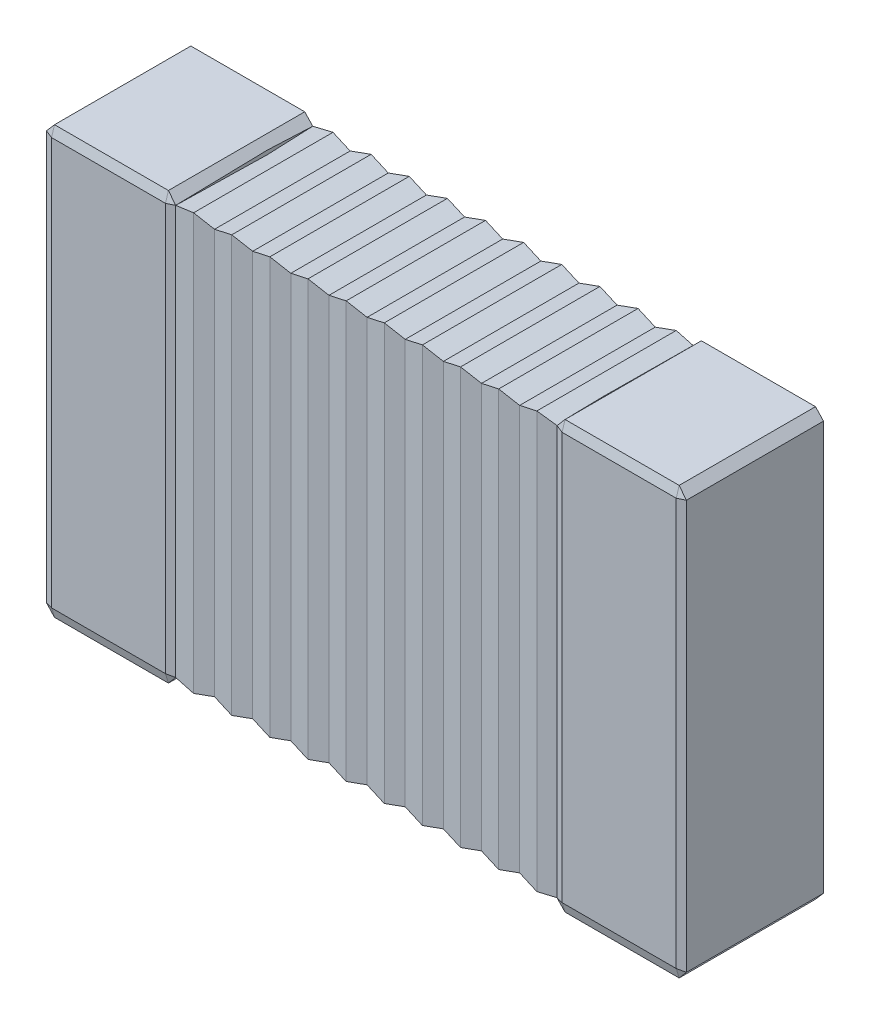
ISO-10303-21;
HEADER;
FILE_DESCRIPTION(('STEP AP214'),'2;1');
FILE_NAME('part.step','',(''),(''),'','','');
FILE_SCHEMA(('AUTOMOTIVE_DESIGN { 1 0 10303 214 1 1 1 1 }'));
ENDSEC;
DATA;
#1=APPLICATION_CONTEXT('core data for automotive mechanical design processes');
#2=APPLICATION_PROTOCOL_DEFINITION('international standard','automotive_design',2000,#1);
#3=PRODUCT_CONTEXT('',#1,'mechanical');
#4=PRODUCT('Part','Part','',(#3));
#5=PRODUCT_RELATED_PRODUCT_CATEGORY('part','',(#4));
#6=PRODUCT_DEFINITION_FORMATION('','',#4);
#7=PRODUCT_DEFINITION_CONTEXT('part definition',#1,'design');
#8=PRODUCT_DEFINITION('design','',#6,#7);
#9=PRODUCT_DEFINITION_SHAPE('','',#8);
#10=(LENGTH_UNIT() NAMED_UNIT(*) SI_UNIT(.MILLI.,.METRE.));
#11=(NAMED_UNIT(*) PLANE_ANGLE_UNIT() SI_UNIT($,.RADIAN.));
#12=(NAMED_UNIT(*) SI_UNIT($,.STERADIAN.) SOLID_ANGLE_UNIT());
#13=UNCERTAINTY_MEASURE_WITH_UNIT(LENGTH_MEASURE(1.E-05),#10,'distance_accuracy_value','');
#14=(GEOMETRIC_REPRESENTATION_CONTEXT(3) GLOBAL_UNCERTAINTY_ASSIGNED_CONTEXT((#13)) GLOBAL_UNIT_ASSIGNED_CONTEXT((#10,
#11,#12)) REPRESENTATION_CONTEXT('',''));
#15=CARTESIAN_POINT('',(0.,0.,0.));
#16=DIRECTION('',(0.,0.,1.));
#17=DIRECTION('',(1.,0.,0.));
#18=AXIS2_PLACEMENT_3D('',#15,#16,#17);
#19=CARTESIAN_POINT('',(2.295183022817,-1.452044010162,1.004666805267));
#20=DIRECTION('',(-1.,0.,0.));
#21=DIRECTION('',(0.,0.,1.));
#22=AXIS2_PLACEMENT_3D('',#19,#20,#21);
#23=PLANE('',#22);
#24=DIRECTION('',(0.,0.,1.));
#25=VECTOR('',#24,1.);
#26=CARTESIAN_POINT('',(2.29518302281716,-1.48100153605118,0.534605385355));
#27=LINE('',#26,#25);
#28=CARTESIAN_POINT('',(2.29518302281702,-1.46634637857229,0.0263455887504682));
#29=VERTEX_POINT('',#28);
#30=CARTESIAN_POINT('',(2.29518302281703,-1.46617932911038,1.00987266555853));
#31=VERTEX_POINT('',#30);
#32=EDGE_CURVE('E1683',#29,#31,#27,.T.);
#33=ORIENTED_EDGE('',*,*,#32,.F.);
#34=CARTESIAN_POINT('',(2.295183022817,-1.452044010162,0.03213273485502));
#35=DIRECTION('',(0.,1.,0.));
#36=VECTOR('',#35,1.);
#37=LINE('',#34,#36);
#38=CARTESIAN_POINT('',(2.29518302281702,1.46627526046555,0.026920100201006));
#39=VERTEX_POINT('',#38);
#40=EDGE_CURVE('E1667',#29,#39,#37,.T.);
#41=ORIENTED_EDGE('',*,*,#40,.T.);
#42=DIRECTION('',(0.,0.,1.));
#43=VECTOR('',#42,1.);
#44=CARTESIAN_POINT('',(2.29518302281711,1.48100153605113,0.502194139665));
#45=LINE('',#44,#43);
#46=CARTESIAN_POINT('',(2.29518302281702,1.46636747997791,1.01045927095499));
#47=VERTEX_POINT('',#46);
#48=EDGE_CURVE('E1670',#47,#39,#45,.F.);
#49=ORIENTED_EDGE('',*,*,#48,.F.);
#50=CARTESIAN_POINT('',(2.295183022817,1.452044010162,1.004666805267));
#51=DIRECTION('',(0.,-1.,0.));
#52=VECTOR('',#51,1.);
#53=LINE('',#50,#52);
#54=EDGE_CURVE('E35',#47,#31,#53,.T.);
#55=ORIENTED_EDGE('',*,*,#54,.T.);
#56=EDGE_LOOP('',(#33,#41,#49,#55));
#57=FACE_BOUND('',#56,.T.);
#58=ADVANCED_FACE('F17',(#57),#23,.F.);
#59=CARTESIAN_POINT('',(2.254667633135,-1.517253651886,0.49910471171));
#60=DIRECTION('',(0.66681022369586,-0.745227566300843,0.));
#61=DIRECTION('',(0.745227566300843,0.66681022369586,0.));
#62=AXIS2_PLACEMENT_3D('',#59,#60,#61);
#63=PLANE('',#62);
#64=DIRECTION('',(0.,0.,1.));
#65=VECTOR('',#64,1.);
#66=CARTESIAN_POINT('',(2.24042224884,-1.530000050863,0.02949573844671));
#67=LINE('',#66,#65);
#68=CARTESIAN_POINT('',(2.24042224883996,-1.53000005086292,1.00730379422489));
#69=VERTEX_POINT('',#68);
#70=CARTESIAN_POINT('',(2.24042224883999,-1.53000005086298,0.0294957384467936));
#71=VERTEX_POINT('',#70);
#72=EDGE_CURVE('E1653',#69,#71,#67,.F.);
#73=ORIENTED_EDGE('',*,*,#72,.T.);
#74=DIRECTION('',(-0.742606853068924,-0.664465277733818,0.0837911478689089));
#75=VECTOR('',#74,1.);
#76=CARTESIAN_POINT('',(2.295183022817,-1.481001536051,0.0233168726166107));
#77=LINE('',#76,#75);
#78=EDGE_CURVE('E1663',#29,#71,#77,.T.);
#79=ORIENTED_EDGE('',*,*,#78,.F.);
#80=ORIENTED_EDGE('',*,*,#32,.T.);
#81=DIRECTION('',(0.742606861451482,0.66446528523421,0.0837910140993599));
#82=VECTOR('',#81,1.);
#83=CARTESIAN_POINT('',(2.24042224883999,-1.53000005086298,1.00730379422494));
#84=LINE('',#83,#82);
#85=EDGE_CURVE('E1672',#69,#31,#84,.T.);
#86=ORIENTED_EDGE('',*,*,#85,.F.);
#87=EDGE_LOOP('',(#73,#79,#80,#86));
#88=FACE_BOUND('',#87,.T.);
#89=ADVANCED_FACE('F1866',(#88),#63,.T.);
#90=CARTESIAN_POINT('',(2.258196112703,-1.491824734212,1.01608969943));
#91=DIRECTION('',(0.150906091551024,-0.287907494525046,0.945693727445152));
#92=DIRECTION('',(0.,-0.956649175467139,-0.291242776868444));
#93=AXIS2_PLACEMENT_3D('',#90,#91,#92);
#94=PLANE('',#93);
#95=DIRECTION('',(0.,-0.956649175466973,-0.291242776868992));
#96=VECTOR('',#95,1.);
#97=CARTESIAN_POINT('',(2.24042224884,-1.511911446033,1.012810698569));
#98=LINE('',#97,#96);
#99=CARTESIAN_POINT('',(2.24042224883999,-1.46070575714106,1.02839978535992));
#100=VERTEX_POINT('',#99);
#101=EDGE_CURVE('E1634',#69,#100,#98,.F.);
#102=ORIENTED_EDGE('',*,*,#101,.F.);
#103=ORIENTED_EDGE('',*,*,#85,.T.);
#104=DIRECTION('',(-0.908502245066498,0.336714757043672,0.247480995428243));
#105=VECTOR('',#104,1.);
#106=CARTESIAN_POINT('',(2.29518302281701,-1.48100153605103,1.01348265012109));
#107=LINE('',#106,#105);
#108=EDGE_CURVE('E1675',#31,#100,#107,.T.);
#109=ORIENTED_EDGE('',*,*,#108,.T.);
#110=EDGE_LOOP('',(#102,#103,#109));
#111=FACE_BOUND('',#110,.T.);
#112=ADVANCED_FACE('F1832',(#111),#94,.T.);
#113=CARTESIAN_POINT('',(2.258196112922,-1.491824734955,0.02070983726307));
#114=DIRECTION('',(0.150905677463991,-0.287907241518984,-0.945693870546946));
#115=DIRECTION('',(0.,0.95664925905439,-0.291242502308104));
#116=AXIS2_PLACEMENT_3D('',#113,#114,#115);
#117=PLANE('',#116);
#118=DIRECTION('',(0.,0.956649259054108,-0.291242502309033));
#119=VECTOR('',#118,1.);
#120=CARTESIAN_POINT('',(2.24042224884,-1.5119114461,0.02398883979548));
#121=LINE('',#120,#119);
#122=CARTESIAN_POINT('',(2.24042224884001,-1.46070575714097,0.00839976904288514));
#123=VERTEX_POINT('',#122);
#124=EDGE_CURVE('E1619',#123,#71,#121,.F.);
#125=ORIENTED_EDGE('',*,*,#124,.F.);
#126=DIRECTION('',(0.908502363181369,-0.336714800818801,0.247480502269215));
#127=VECTOR('',#126,1.);
#128=CARTESIAN_POINT('',(2.24042224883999,-1.46070575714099,0.00839976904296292));
#129=LINE('',#128,#127);
#130=EDGE_CURVE('E1658',#123,#29,#129,.T.);
#131=ORIENTED_EDGE('',*,*,#130,.T.);
#132=ORIENTED_EDGE('',*,*,#78,.T.);
#133=EDGE_LOOP('',(#125,#131,#132));
#134=FACE_BOUND('',#133,.T.);
#135=ADVANCED_FACE('F1867',(#134),#117,.T.);
#136=CARTESIAN_POINT('',(2.254667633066,1.517253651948,0.537694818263));
#137=DIRECTION('',(-0.66681022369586,-0.745227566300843,0.));
#138=DIRECTION('',(0.745227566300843,-0.66681022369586,0.));
#139=AXIS2_PLACEMENT_3D('',#136,#137,#138);
#140=PLANE('',#139);
#141=DIRECTION('',(0.,0.,-1.));
#142=VECTOR('',#141,1.);
#143=CARTESIAN_POINT('',(2.24042224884,1.530000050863,1.007303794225));
#144=LINE('',#143,#142);
#145=CARTESIAN_POINT('',(2.24042224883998,1.53000005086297,0.0294957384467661));
#146=VERTEX_POINT('',#145);
#147=CARTESIAN_POINT('',(2.24042224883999,1.530000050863,1.00730379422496));
#148=VERTEX_POINT('',#147);
#149=EDGE_CURVE('E1610',#146,#148,#144,.F.);
#150=ORIENTED_EDGE('',*,*,#149,.T.);
#151=DIRECTION('',(0.742606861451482,-0.66446528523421,0.0837910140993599));
#152=VECTOR('',#151,1.);
#153=CARTESIAN_POINT('',(2.24042224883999,1.53000005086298,1.00730379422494));
#154=LINE('',#153,#152);
#155=EDGE_CURVE('E1648',#148,#47,#154,.T.);
#156=ORIENTED_EDGE('',*,*,#155,.T.);
#157=ORIENTED_EDGE('',*,*,#48,.T.);
#158=DIRECTION('',(-0.742606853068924,0.664465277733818,0.0837911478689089));
#159=VECTOR('',#158,1.);
#160=CARTESIAN_POINT('',(2.295183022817,1.481001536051,0.02331687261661));
#161=LINE('',#160,#159);
#162=EDGE_CURVE('E1629',#39,#146,#161,.T.);
#163=ORIENTED_EDGE('',*,*,#162,.T.);
#164=EDGE_LOOP('',(#150,#156,#157,#163));
#165=FACE_BOUND('',#164,.T.);
#166=ADVANCED_FACE('F1886',(#165),#140,.F.);
#167=CARTESIAN_POINT('',(2.258196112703,1.491824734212,1.01608969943));
#168=DIRECTION('',(-0.150906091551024,-0.287907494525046,-0.945693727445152));
#169=DIRECTION('',(0.,0.956649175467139,-0.291242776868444));
#170=AXIS2_PLACEMENT_3D('',#167,#168,#169);
#171=PLANE('',#170);
#172=DIRECTION('',(0.,-0.956649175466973,0.291242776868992));
#173=VECTOR('',#172,1.);
#174=CARTESIAN_POINT('',(2.24042224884,1.478794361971,1.022892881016));
#175=LINE('',#174,#173);
#176=CARTESIAN_POINT('',(2.24042224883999,1.46070575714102,1.02839978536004));
#177=VERTEX_POINT('',#176);
#178=EDGE_CURVE('E1605',#177,#148,#175,.F.);
#179=ORIENTED_EDGE('',*,*,#178,.F.);
#180=DIRECTION('',(-0.908502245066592,-0.336714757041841,0.247480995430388));
#181=VECTOR('',#180,1.);
#182=CARTESIAN_POINT('',(2.29518302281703,1.481001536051,1.0134826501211));
#183=LINE('',#182,#181);
#184=EDGE_CURVE('E1644',#47,#177,#183,.T.);
#185=ORIENTED_EDGE('',*,*,#184,.F.);
#186=ORIENTED_EDGE('',*,*,#155,.F.);
#187=EDGE_LOOP('',(#179,#185,#186));
#188=FACE_BOUND('',#187,.T.);
#189=ADVANCED_FACE('F1888',(#188),#171,.F.);
#190=CARTESIAN_POINT('',(2.24042224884,-1.530000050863,1.007303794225));
#191=DIRECTION('',(0.,1.,0.));
#192=DIRECTION('',(0.,0.,1.));
#193=AXIS2_PLACEMENT_3D('',#190,#191,#192);
#194=PLANE('',#193);
#195=DIRECTION('',(0.,0.,1.));
#196=VECTOR('',#195,1.);
#197=CARTESIAN_POINT('',(1.42190996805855,-1.53000005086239,0.537694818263));
#198=LINE('',#197,#196);
#199=CARTESIAN_POINT('',(1.4219099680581,-1.53000005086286,0.0294957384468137));
#200=VERTEX_POINT('',#199);
#201=CARTESIAN_POINT('',(1.42190996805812,-1.53000005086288,1.00730379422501));
#202=VERTEX_POINT('',#201);
#203=EDGE_CURVE('E1597',#200,#202,#198,.T.);
#204=ORIENTED_EDGE('',*,*,#203,.F.);
#205=DIRECTION('',(1.,0.,0.));
#206=VECTOR('',#205,1.);
#207=CARTESIAN_POINT('',(1.848475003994,-1.53000005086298,0.0294957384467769));
#208=LINE('',#207,#206);
#209=EDGE_CURVE('E1615',#71,#200,#208,.F.);
#210=ORIENTED_EDGE('',*,*,#209,.F.);
#211=ORIENTED_EDGE('',*,*,#72,.F.);
#212=DIRECTION('',(1.,0.,0.));
#213=VECTOR('',#212,1.);
#214=CARTESIAN_POINT('',(1.848475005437,-1.53000005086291,1.0073037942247));
#215=LINE('',#214,#213);
#216=EDGE_CURVE('E1639',#202,#69,#215,.T.);
#217=ORIENTED_EDGE('',*,*,#216,.F.);
#218=EDGE_LOOP('',(#204,#210,#211,#217));
#219=FACE_BOUND('',#218,.T.);
#220=ADVANCED_FACE('F1809',(#219),#194,.F.);
#221=CARTESIAN_POINT('',(2.25429990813,0.02000604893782,1.024619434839));
#222=DIRECTION('',(0.262828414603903,0.,0.964842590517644));
#223=DIRECTION('',(0.964842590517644,0.,-0.262828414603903));
#224=AXIS2_PLACEMENT_3D('',#221,#222,#223);
#225=PLANE('',#224);
#226=DIRECTION('',(0.,1.,0.));
#227=VECTOR('',#226,1.);
#228=CARTESIAN_POINT('',(2.24042224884,1.460705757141,1.02839978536));
#229=LINE('',#228,#227);
#230=EDGE_CURVE('E1591',#177,#100,#229,.F.);
#231=ORIENTED_EDGE('',*,*,#230,.T.);
#232=ORIENTED_EDGE('',*,*,#108,.F.);
#233=ORIENTED_EDGE('',*,*,#54,.F.);
#234=ORIENTED_EDGE('',*,*,#184,.T.);
#235=EDGE_LOOP('',(#231,#232,#233,#234));
#236=FACE_BOUND('',#235,.T.);
#237=ADVANCED_FACE('F1804',(#236),#225,.T.);
#238=CARTESIAN_POINT('',(2.295183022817,1.481001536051,0.02331687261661));
#239=DIRECTION('',(-0.150905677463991,-0.287907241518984,0.945693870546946));
#240=DIRECTION('',(0.,-0.95664925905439,-0.291242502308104));
#241=AXIS2_PLACEMENT_3D('',#238,#239,#240);
#242=PLANE('',#241);
#243=DIRECTION('',(0.,-0.956649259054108,-0.291242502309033));
#244=VECTOR('',#243,1.);
#245=CARTESIAN_POINT('',(2.24042224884,1.478794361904,0.01390666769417));
#246=LINE('',#245,#244);
#247=CARTESIAN_POINT('',(2.24042224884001,1.460705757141,0.00839976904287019));
#248=VERTEX_POINT('',#247);
#249=EDGE_CURVE('E1586',#248,#146,#246,.F.);
#250=ORIENTED_EDGE('',*,*,#249,.T.);
#251=ORIENTED_EDGE('',*,*,#162,.F.);
#252=DIRECTION('',(0.90850236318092,0.336714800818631,0.247480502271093));
#253=VECTOR('',#252,1.);
#254=CARTESIAN_POINT('',(2.24042224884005,1.460705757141,0.00839976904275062));
#255=LINE('',#254,#253);
#256=EDGE_CURVE('E1624',#248,#39,#255,.T.);
#257=ORIENTED_EDGE('',*,*,#256,.F.);
#258=EDGE_LOOP('',(#250,#251,#257));
#259=FACE_BOUND('',#258,.T.);
#260=ADVANCED_FACE('F1800',(#259),#242,.F.);
#261=CARTESIAN_POINT('',(2.254299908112,0.02000604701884,0.01218011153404));
#262=DIRECTION('',(0.262827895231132,0.,-0.964842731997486));
#263=DIRECTION('',(-0.964842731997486,0.,-0.262827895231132));
#264=AXIS2_PLACEMENT_3D('',#261,#262,#263);
#265=PLANE('',#264);
#266=DIRECTION('',(0.,1.,0.));
#267=VECTOR('',#266,1.);
#268=CARTESIAN_POINT('',(2.24042224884,1.460705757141,0.008399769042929));
#269=LINE('',#268,#267);
#270=EDGE_CURVE('E1581',#123,#248,#269,.T.);
#271=ORIENTED_EDGE('',*,*,#270,.T.);
#272=ORIENTED_EDGE('',*,*,#256,.T.);
#273=ORIENTED_EDGE('',*,*,#40,.F.);
#274=ORIENTED_EDGE('',*,*,#130,.F.);
#275=EDGE_LOOP('',(#271,#272,#273,#274));
#276=FACE_BOUND('',#275,.T.);
#277=ADVANCED_FACE('F1789',(#276),#265,.T.);
#278=CARTESIAN_POINT('',(1.813857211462,-1.478794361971,1.022892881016));
#279=DIRECTION('',(0.,0.291242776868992,-0.956649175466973));
#280=DIRECTION('',(0.,0.956649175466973,0.291242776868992));
#281=AXIS2_PLACEMENT_3D('',#278,#279,#280);
#282=PLANE('',#281);
#283=DIRECTION('',(0.,-0.956649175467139,-0.291242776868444));
#284=VECTOR('',#283,1.);
#285=CARTESIAN_POINT('',(1.42190996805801,-1.49261495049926,1.0186853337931));
#286=LINE('',#285,#284);
#287=CARTESIAN_POINT('',(1.42190996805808,-1.46070575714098,1.02839978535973));
#288=VERTEX_POINT('',#287);
#289=EDGE_CURVE('E1563',#202,#288,#286,.F.);
#290=ORIENTED_EDGE('',*,*,#289,.F.);
#291=ORIENTED_EDGE('',*,*,#216,.T.);
#292=ORIENTED_EDGE('',*,*,#101,.T.);
#293=DIRECTION('',(-1.,0.,0.));
#294=VECTOR('',#293,1.);
#295=CARTESIAN_POINT('',(1.421909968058,-1.460705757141,1.02839978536));
#296=LINE('',#295,#294);
#297=EDGE_CURVE('E1558',#100,#288,#296,.T.);
#298=ORIENTED_EDGE('',*,*,#297,.T.);
#299=EDGE_LOOP('',(#290,#291,#292,#298));
#300=FACE_BOUND('',#299,.T.);
#301=ADVANCED_FACE('F1799',(#300),#282,.F.);
#302=CARTESIAN_POINT('',(1.421909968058,1.530000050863,0.02949573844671));
#303=DIRECTION('',(0.,-1.,0.));
#304=DIRECTION('',(0.,0.,-1.));
#305=AXIS2_PLACEMENT_3D('',#302,#303,#304);
#306=PLANE('',#305);
#307=DIRECTION('',(0.,0.,1.));
#308=VECTOR('',#307,1.);
#309=CARTESIAN_POINT('',(1.42190996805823,1.53000005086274,0.49910471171));
#310=LINE('',#309,#308);
#311=CARTESIAN_POINT('',(1.42190996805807,1.53000005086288,0.0294957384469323));
#312=VERTEX_POINT('',#311);
#313=CARTESIAN_POINT('',(1.42190996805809,1.5300000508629,1.00730379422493));
#314=VERTEX_POINT('',#313);
#315=EDGE_CURVE('E1538',#312,#314,#310,.T.);
#316=ORIENTED_EDGE('',*,*,#315,.T.);
#317=DIRECTION('',(1.,0.,0.));
#318=VECTOR('',#317,1.);
#319=CARTESIAN_POINT('',(1.813857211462,1.53000005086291,1.0073037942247));
#320=LINE('',#319,#318);
#321=EDGE_CURVE('E1569',#314,#148,#320,.T.);
#322=ORIENTED_EDGE('',*,*,#321,.T.);
#323=ORIENTED_EDGE('',*,*,#149,.F.);
#324=DIRECTION('',(1.,0.,0.));
#325=VECTOR('',#324,1.);
#326=CARTESIAN_POINT('',(1.813857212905,1.53000005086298,0.0294957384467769));
#327=LINE('',#326,#325);
#328=EDGE_CURVE('E1553',#146,#312,#327,.F.);
#329=ORIENTED_EDGE('',*,*,#328,.T.);
#330=EDGE_LOOP('',(#316,#322,#323,#329));
#331=FACE_BOUND('',#330,.T.);
#332=ADVANCED_FACE('F1883',(#331),#306,.F.);
#333=CARTESIAN_POINT('',(1.813857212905,-1.478794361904,0.01390666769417));
#334=DIRECTION('',(0.,0.291242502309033,0.956649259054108));
#335=DIRECTION('',(0.,-0.956649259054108,0.291242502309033));
#336=AXIS2_PLACEMENT_3D('',#333,#334,#335);
#337=PLANE('',#336);
#338=DIRECTION('',(1.,0.,0.));
#339=VECTOR('',#338,1.);
#340=CARTESIAN_POINT('',(1.421909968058,-1.460705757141,0.008399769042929));
#341=LINE('',#340,#339);
#342=CARTESIAN_POINT('',(1.42190996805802,-1.46070575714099,0.00839976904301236));
#343=VERTEX_POINT('',#342);
#344=EDGE_CURVE('E1534',#343,#123,#341,.T.);
#345=ORIENTED_EDGE('',*,*,#344,.T.);
#346=ORIENTED_EDGE('',*,*,#124,.T.);
#347=ORIENTED_EDGE('',*,*,#209,.T.);
#348=DIRECTION('',(0.,0.95664925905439,-0.291242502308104));
#349=VECTOR('',#348,1.);
#350=CARTESIAN_POINT('',(1.42190996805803,-1.49261494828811,0.0181142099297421));
#351=LINE('',#350,#349);
#352=EDGE_CURVE('E1537',#343,#200,#351,.F.);
#353=ORIENTED_EDGE('',*,*,#352,.F.);
#354=EDGE_LOOP('',(#345,#346,#347,#353));
#355=FACE_BOUND('',#354,.T.);
#356=ADVANCED_FACE('F1863',(#355),#337,.F.);
#357=CARTESIAN_POINT('',(1.381308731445,-1.493671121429,0.502194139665));
#358=DIRECTION('',(-0.66681022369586,-0.745227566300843,0.));
#359=DIRECTION('',(0.745227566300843,-0.66681022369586,0.));
#360=AXIS2_PLACEMENT_3D('',#357,#358,#359);
#361=PLANE('',#360);
#362=DIRECTION('',(-0.74260685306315,0.664465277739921,-0.0837911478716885));
#363=VECTOR('',#362,1.);
#364=CARTESIAN_POINT('',(1.42190996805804,-1.53000005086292,0.0294957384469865));
#365=LINE('',#364,#363);
#366=CARTESIAN_POINT('',(1.36718598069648,-1.46578702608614,0.0267405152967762));
#367=VERTEX_POINT('',#366);
#368=EDGE_CURVE('E1527',#200,#367,#365,.T.);
#369=ORIENTED_EDGE('',*,*,#368,.F.);
#370=ORIENTED_EDGE('',*,*,#203,.T.);
#371=DIRECTION('',(0.742606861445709,-0.664465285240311,-0.0837910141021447));
#372=VECTOR('',#371,1.);
#373=CARTESIAN_POINT('',(1.36714919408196,-1.48100153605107,1.01348265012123));
#374=LINE('',#373,#372);
#375=CARTESIAN_POINT('',(1.36720205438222,-1.46622303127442,1.01072576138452));
#376=VERTEX_POINT('',#375);
#377=EDGE_CURVE('E1566',#376,#202,#374,.T.);
#378=ORIENTED_EDGE('',*,*,#377,.F.);
#379=DIRECTION('',(0.,0.,-1.));
#380=VECTOR('',#379,1.);
#381=CARTESIAN_POINT('',(1.367149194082,-1.481001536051,0.03213273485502));
#382=LINE('',#381,#380);
#383=EDGE_CURVE('E1522',#376,#367,#382,.T.);
#384=ORIENTED_EDGE('',*,*,#383,.T.);
#385=EDGE_LOOP('',(#369,#370,#378,#384));
#386=FACE_BOUND('',#385,.T.);
#387=ADVANCED_FACE('F1853',(#386),#361,.T.);
#388=CARTESIAN_POINT('',(1.813857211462,1.511911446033,1.012810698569));
#389=DIRECTION('',(0.,-0.291242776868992,-0.956649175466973));
#390=DIRECTION('',(0.,0.956649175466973,-0.291242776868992));
#391=AXIS2_PLACEMENT_3D('',#388,#389,#390);
#392=PLANE('',#391);
#393=DIRECTION('',(0.,-0.956649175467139,0.291242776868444));
#394=VECTOR('',#393,1.);
#395=CARTESIAN_POINT('',(1.42190996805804,1.49261495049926,1.01868533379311));
#396=LINE('',#395,#394);
#397=CARTESIAN_POINT('',(1.42190996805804,1.46070575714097,1.02839978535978));
#398=VERTEX_POINT('',#397);
#399=EDGE_CURVE('E1517',#398,#314,#396,.F.);
#400=ORIENTED_EDGE('',*,*,#399,.F.);
#401=DIRECTION('',(-1.,0.,0.));
#402=VECTOR('',#401,1.);
#403=CARTESIAN_POINT('',(1.421909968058,1.460705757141,1.02839978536));
#404=LINE('',#403,#402);
#405=EDGE_CURVE('E1594',#398,#177,#404,.F.);
#406=ORIENTED_EDGE('',*,*,#405,.T.);
#407=ORIENTED_EDGE('',*,*,#178,.T.);
#408=ORIENTED_EDGE('',*,*,#321,.F.);
#409=EDGE_LOOP('',(#400,#406,#407,#408));
#410=FACE_BOUND('',#409,.T.);
#411=ADVANCED_FACE('F1891',(#410),#392,.F.);
#412=CARTESIAN_POINT('',(1.404136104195,-1.491824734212,1.01608969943));
#413=DIRECTION('',(-0.150906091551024,-0.287907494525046,0.945693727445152));
#414=DIRECTION('',(0.,-0.956649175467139,-0.291242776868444));
#415=AXIS2_PLACEMENT_3D('',#412,#413,#414);
#416=PLANE('',#415);
#417=ORIENTED_EDGE('',*,*,#289,.T.);
#418=DIRECTION('',(0.908502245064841,0.336714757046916,0.247480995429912));
#419=VECTOR('',#418,1.);
#420=CARTESIAN_POINT('',(1.36714919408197,-1.481001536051,1.0134826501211));
#421=LINE('',#420,#419);
#422=EDGE_CURVE('E1512',#376,#288,#421,.T.);
#423=ORIENTED_EDGE('',*,*,#422,.F.);
#424=ORIENTED_EDGE('',*,*,#377,.T.);
#425=EDGE_LOOP('',(#417,#423,#424));
#426=FACE_BOUND('',#425,.T.);
#427=ADVANCED_FACE('F1849',(#426),#416,.T.);
#428=CARTESIAN_POINT('',(1.421909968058,1.460705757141,1.02839978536));
#429=DIRECTION('',(0.,0.,-1.));
#430=DIRECTION('',(-1.,0.,0.));
#431=AXIS2_PLACEMENT_3D('',#428,#429,#430);
#432=PLANE('',#431);
#433=ORIENTED_EDGE('',*,*,#297,.F.);
#434=ORIENTED_EDGE('',*,*,#230,.F.);
#435=ORIENTED_EDGE('',*,*,#405,.F.);
#436=DIRECTION('',(0.,1.,0.));
#437=VECTOR('',#436,1.);
#438=CARTESIAN_POINT('',(1.42190996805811,-0.02000604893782,1.02839978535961));
#439=LINE('',#438,#437);
#440=EDGE_CURVE('E1507',#288,#398,#439,.T.);
#441=ORIENTED_EDGE('',*,*,#440,.F.);
#442=EDGE_LOOP('',(#433,#434,#435,#441));
#443=FACE_BOUND('',#442,.T.);
#444=ADVANCED_FACE('F1839',(#443),#432,.F.);
#445=CARTESIAN_POINT('',(1.813857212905,1.5119114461,0.02398883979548));
#446=DIRECTION('',(0.,-0.291242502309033,0.956649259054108));
#447=DIRECTION('',(0.,-0.956649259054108,-0.291242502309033));
#448=AXIS2_PLACEMENT_3D('',#445,#446,#447);
#449=PLANE('',#448);
#450=ORIENTED_EDGE('',*,*,#328,.F.);
#451=ORIENTED_EDGE('',*,*,#249,.F.);
#452=DIRECTION('',(1.,0.,0.));
#453=VECTOR('',#452,1.);
#454=CARTESIAN_POINT('',(1.421909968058,1.460705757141,0.008399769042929));
#455=LINE('',#454,#453);
#456=CARTESIAN_POINT('',(1.42190996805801,1.460705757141,0.00839976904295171));
#457=VERTEX_POINT('',#456);
#458=EDGE_CURVE('E1577',#248,#457,#455,.F.);
#459=ORIENTED_EDGE('',*,*,#458,.T.);
#460=DIRECTION('',(0.,-0.95664925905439,-0.291242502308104));
#461=VECTOR('',#460,1.);
#462=CARTESIAN_POINT('',(1.42190996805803,1.48343616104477,0.0153198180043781));
#463=LINE('',#462,#461);
#464=EDGE_CURVE('E1493',#457,#312,#463,.F.);
#465=ORIENTED_EDGE('',*,*,#464,.T.);
#466=EDGE_LOOP('',(#450,#451,#459,#465));
#467=FACE_BOUND('',#466,.T.);
#468=ADVANCED_FACE('F1873',(#467),#449,.F.);
#469=CARTESIAN_POINT('',(1.407664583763,1.517253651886,0.49910471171));
#470=DIRECTION('',(0.66681022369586,-0.745227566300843,0.));
#471=DIRECTION('',(0.745227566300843,0.66681022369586,0.));
#472=AXIS2_PLACEMENT_3D('',#469,#470,#471);
#473=PLANE('',#472);
#474=ORIENTED_EDGE('',*,*,#315,.F.);
#475=DIRECTION('',(-0.74260685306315,-0.664465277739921,-0.0837911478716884));
#476=VECTOR('',#475,1.);
#477=CARTESIAN_POINT('',(1.42190996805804,1.53000005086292,0.0294957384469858));
#478=LINE('',#477,#476);
#479=CARTESIAN_POINT('',(1.36714919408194,1.46633549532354,0.0267038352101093));
#480=VERTEX_POINT('',#479);
#481=EDGE_CURVE('E1488',#312,#480,#478,.T.);
#482=ORIENTED_EDGE('',*,*,#481,.T.);
#483=DIRECTION('',(0.,0.,-1.));
#484=VECTOR('',#483,1.);
#485=CARTESIAN_POINT('',(1.367149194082,1.481001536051,1.004666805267));
#486=LINE('',#485,#484);
#487=CARTESIAN_POINT('',(1.36714919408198,1.46612204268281,1.00964634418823));
#488=VERTEX_POINT('',#487);
#489=EDGE_CURVE('E1498',#480,#488,#486,.F.);
#490=ORIENTED_EDGE('',*,*,#489,.T.);
#491=DIRECTION('',(-0.742606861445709,-0.664465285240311,0.0837910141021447));
#492=VECTOR('',#491,1.);
#493=CARTESIAN_POINT('',(1.42190996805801,1.53000005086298,1.00730379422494));
#494=LINE('',#493,#492);
#495=EDGE_CURVE('E1515',#314,#488,#494,.T.);
#496=ORIENTED_EDGE('',*,*,#495,.F.);
#497=EDGE_LOOP('',(#474,#482,#490,#496));
#498=FACE_BOUND('',#497,.T.);
#499=ADVANCED_FACE('F1880',(#498),#473,.F.);
#500=CARTESIAN_POINT('',(1.421909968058,-1.460705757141,0.008399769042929));
#501=DIRECTION('',(0.,0.,1.));
#502=DIRECTION('',(1.,0.,0.));
#503=AXIS2_PLACEMENT_3D('',#500,#501,#502);
#504=PLANE('',#503);
#505=DIRECTION('',(0.,1.,0.));
#506=VECTOR('',#505,1.);
#507=CARTESIAN_POINT('',(1.42190996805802,-0.02000604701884,0.0083997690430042));
#508=LINE('',#507,#506);
#509=EDGE_CURVE('E1484',#457,#343,#508,.F.);
#510=ORIENTED_EDGE('',*,*,#509,.F.);
#511=ORIENTED_EDGE('',*,*,#458,.F.);
#512=ORIENTED_EDGE('',*,*,#270,.F.);
#513=ORIENTED_EDGE('',*,*,#344,.F.);
#514=EDGE_LOOP('',(#510,#511,#512,#513));
#515=FACE_BOUND('',#514,.T.);
#516=ADVANCED_FACE('F1869',(#515),#504,.F.);
#517=CARTESIAN_POINT('',(1.404136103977,-1.491824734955,0.02070983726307));
#518=DIRECTION('',(-0.150905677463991,-0.287907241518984,-0.945693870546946));
#519=DIRECTION('',(0.,0.95664925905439,-0.291242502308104));
#520=AXIS2_PLACEMENT_3D('',#517,#518,#519);
#521=PLANE('',#520);
#522=ORIENTED_EDGE('',*,*,#352,.T.);
#523=ORIENTED_EDGE('',*,*,#368,.T.);
#524=DIRECTION('',(-0.908502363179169,-0.336714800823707,0.247480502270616));
#525=VECTOR('',#524,1.);
#526=CARTESIAN_POINT('',(1.42190996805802,-1.460705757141,0.00839976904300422));
#527=LINE('',#526,#525);
#528=EDGE_CURVE('E1487',#343,#367,#527,.T.);
#529=ORIENTED_EDGE('',*,*,#528,.F.);
#530=EDGE_LOOP('',(#522,#523,#529));
#531=FACE_BOUND('',#530,.T.);
#532=ADVANCED_FACE('F1856',(#531),#521,.T.);
#533=CARTESIAN_POINT('',(1.404136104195,1.491824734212,1.01608969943));
#534=DIRECTION('',(-0.150906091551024,0.287907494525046,0.945693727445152));
#535=DIRECTION('',(0.,-0.956649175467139,0.291242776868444));
#536=AXIS2_PLACEMENT_3D('',#533,#534,#535);
#537=PLANE('',#536);
#538=ORIENTED_EDGE('',*,*,#399,.T.);
#539=ORIENTED_EDGE('',*,*,#495,.T.);
#540=DIRECTION('',(0.908502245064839,-0.336714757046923,0.247480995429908));
#541=VECTOR('',#540,1.);
#542=CARTESIAN_POINT('',(1.36714919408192,1.481001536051,1.0134826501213));
#543=LINE('',#542,#541);
#544=EDGE_CURVE('E1481',#488,#398,#543,.T.);
#545=ORIENTED_EDGE('',*,*,#544,.T.);
#546=EDGE_LOOP('',(#538,#539,#545));
#547=FACE_BOUND('',#546,.T.);
#548=ADVANCED_FACE('F2777',(#547),#537,.T.);
#549=CARTESIAN_POINT('',(1.367149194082,1.481001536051,0.02331687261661));
#550=DIRECTION('',(0.150905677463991,-0.287907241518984,0.945693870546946));
#551=DIRECTION('',(0.,-0.95664925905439,-0.291242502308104));
#552=AXIS2_PLACEMENT_3D('',#549,#550,#551);
#553=PLANE('',#552);
#554=ORIENTED_EDGE('',*,*,#464,.F.);
#555=DIRECTION('',(0.908502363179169,-0.336714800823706,-0.247480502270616));
#556=VECTOR('',#555,1.);
#557=CARTESIAN_POINT('',(1.36714919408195,1.481001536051,0.0233168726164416));
#558=LINE('',#557,#556);
#559=EDGE_CURVE('E1438',#480,#457,#558,.T.);
#560=ORIENTED_EDGE('',*,*,#559,.F.);
#561=ORIENTED_EDGE('',*,*,#481,.F.);
#562=EDGE_LOOP('',(#554,#560,#561));
#563=FACE_BOUND('',#562,.T.);
#564=ADVANCED_FACE('F1877',(#563),#553,.F.);
#565=CARTESIAN_POINT('',(1.367149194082,-1.452044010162,1.004666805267));
#566=DIRECTION('',(1.,0.,0.));
#567=DIRECTION('',(0.,0.,-1.));
#568=AXIS2_PLACEMENT_3D('',#565,#566,#567);
#569=PLANE('',#568);
#570=DIRECTION('',(0.,0.,1.));
#571=VECTOR('',#570,1.);
#572=CARTESIAN_POINT('',(1.36714919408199,-1.45204401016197,0.55506925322));
#573=LINE('',#572,#571);
#574=EDGE_CURVE('E1433',#376,#367,#573,.F.);
#575=ORIENTED_EDGE('',*,*,#574,.T.);
#576=ORIENTED_EDGE('',*,*,#383,.F.);
#577=EDGE_LOOP('',(#575,#576));
#578=FACE_BOUND('',#577,.T.);
#579=ADVANCED_FACE('F2761',(#578),#569,.F.);
#580=CARTESIAN_POINT('',(1.367149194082,1.452044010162,1.004666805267));
#581=DIRECTION('',(1.,0.,0.));
#582=DIRECTION('',(0.,0.,-1.));
#583=AXIS2_PLACEMENT_3D('',#580,#581,#582);
#584=PLANE('',#583);
#585=DIRECTION('',(0.,0.,1.));
#586=VECTOR('',#585,1.);
#587=CARTESIAN_POINT('',(1.36714919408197,1.45204401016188,0.481730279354));
#588=LINE('',#587,#586);
#589=EDGE_CURVE('E1430',#480,#488,#588,.T.);
#590=ORIENTED_EDGE('',*,*,#589,.T.);
#591=ORIENTED_EDGE('',*,*,#489,.F.);
#592=EDGE_LOOP('',(#590,#591));
#593=FACE_BOUND('',#592,.T.);
#594=ADVANCED_FACE('F1469',(#593),#584,.F.);
#595=CARTESIAN_POINT('',(1.380932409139,0.009858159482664,1.017237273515));
#596=DIRECTION('',(0.262828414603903,0.,-0.964842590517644));
#597=DIRECTION('',(-0.964842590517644,0.,-0.262828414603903));
#598=AXIS2_PLACEMENT_3D('',#595,#596,#597);
#599=PLANE('',#598);
#600=CARTESIAN_POINT('',(1.36714919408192,1.4520440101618,1.0134826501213));
#601=DIRECTION('',(0.,-1.,0.));
#602=VECTOR('',#601,1.);
#603=LINE('',#600,#602);
#604=EDGE_CURVE('E1427',#488,#376,#603,.T.);
#605=ORIENTED_EDGE('',*,*,#604,.T.);
#606=ORIENTED_EDGE('',*,*,#422,.T.);
#607=ORIENTED_EDGE('',*,*,#440,.T.);
#608=ORIENTED_EDGE('',*,*,#544,.F.);
#609=EDGE_LOOP('',(#605,#606,#607,#608));
#610=FACE_BOUND('',#609,.T.);
#611=ADVANCED_FACE('F1464',(#610),#599,.F.);
#612=CARTESIAN_POINT('',(1.38093240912,0.009858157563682,0.01956225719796));
#613=DIRECTION('',(-0.262827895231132,0.,-0.964842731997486));
#614=DIRECTION('',(-0.964842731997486,0.,0.262827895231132));
#615=AXIS2_PLACEMENT_3D('',#612,#613,#614);
#616=PLANE('',#615);
#617=ORIENTED_EDGE('',*,*,#559,.T.);
#618=ORIENTED_EDGE('',*,*,#509,.T.);
#619=ORIENTED_EDGE('',*,*,#528,.T.);
#620=CARTESIAN_POINT('',(1.367149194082,1.452044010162,0.03213273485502));
#621=DIRECTION('',(0.,-1.,0.));
#622=VECTOR('',#621,1.);
#623=LINE('',#620,#622);
#624=EDGE_CURVE('E1422',#480,#367,#623,.T.);
#625=ORIENTED_EDGE('',*,*,#624,.F.);
#626=EDGE_LOOP('',(#617,#618,#619,#625));
#627=FACE_BOUND('',#626,.T.);
#628=ADVANCED_FACE('F1453',(#627),#616,.T.);
#629=CARTESIAN_POINT('',(1.26681041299,-1.481871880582,0.488538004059));
#630=DIRECTION('',(0.284947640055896,-0.958543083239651,0.));
#631=DIRECTION('',(0.958543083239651,0.284947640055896,0.));
#632=AXIS2_PLACEMENT_3D('',#629,#630,#631);
#633=PLANE('',#632);
#634=DIRECTION('',(0.,0.,1.));
#635=VECTOR('',#634,1.);
#636=CARTESIAN_POINT('',(1.23038132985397,-1.4927012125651,0.48853802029));
#637=LINE('',#636,#635);
#638=CARTESIAN_POINT('',(1.23038132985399,-1.49270121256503,0.0185172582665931));
#639=VERTEX_POINT('',#638);
#640=CARTESIAN_POINT('',(1.230381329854,-1.49270121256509,1.01828225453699));
#641=VERTEX_POINT('',#640);
#642=EDGE_CURVE('E1402',#639,#641,#637,.T.);
#643=ORIENTED_EDGE('',*,*,#642,.F.);
#644=DIRECTION('',(0.954208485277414,0.283659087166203,0.0949930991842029));
#645=VECTOR('',#644,1.);
#646=CARTESIAN_POINT('',(1.23038132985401,-1.492701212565,0.0185172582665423));
#647=LINE('',#646,#645);
#648=EDGE_CURVE('E1407',#639,#367,#647,.T.);
#649=ORIENTED_EDGE('',*,*,#648,.T.);
#650=ORIENTED_EDGE('',*,*,#574,.F.);
#651=DIRECTION('',(-0.954208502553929,-0.283659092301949,0.0949929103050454));
#652=VECTOR('',#651,1.);
#653=CARTESIAN_POINT('',(1.367149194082,-1.452044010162,1.004666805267));
#654=LINE('',#653,#652);
#655=EDGE_CURVE('E1425',#376,#641,#654,.T.);
#656=ORIENTED_EDGE('',*,*,#655,.T.);
#657=EDGE_LOOP('',(#643,#649,#650,#656));
#658=FACE_BOUND('',#657,.T.);
#659=ADVANCED_FACE('F1463',(#658),#633,.T.);
#660=CARTESIAN_POINT('',(1.266810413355,1.481871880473,0.548261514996));
#661=DIRECTION('',(0.284947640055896,0.958543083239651,0.));
#662=DIRECTION('',(-0.958543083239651,0.284947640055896,0.));
#663=AXIS2_PLACEMENT_3D('',#660,#661,#662);
#664=PLANE('',#663);
#665=DIRECTION('',(0.,0.,1.));
#666=VECTOR('',#665,1.);
#667=CARTESIAN_POINT('',(1.230381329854,1.492701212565,1.018282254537));
#668=LINE('',#667,#666);
#669=CARTESIAN_POINT('',(1.23038132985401,1.492701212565,0.0185172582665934));
#670=VERTEX_POINT('',#669);
#671=CARTESIAN_POINT('',(1.23038132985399,1.492701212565,1.01828225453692));
#672=VERTEX_POINT('',#671);
#673=EDGE_CURVE('E1397',#670,#672,#668,.T.);
#674=ORIENTED_EDGE('',*,*,#673,.T.);
#675=DIRECTION('',(0.954208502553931,-0.283659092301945,-0.094992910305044));
#676=VECTOR('',#675,1.);
#677=CARTESIAN_POINT('',(1.23038132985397,1.492701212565,1.01828225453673));
#678=LINE('',#677,#676);
#679=EDGE_CURVE('E1412',#672,#488,#678,.T.);
#680=ORIENTED_EDGE('',*,*,#679,.T.);
#681=ORIENTED_EDGE('',*,*,#589,.F.);
#682=DIRECTION('',(0.954208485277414,-0.283659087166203,0.0949930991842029));
#683=VECTOR('',#682,1.);
#684=CARTESIAN_POINT('',(1.23038132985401,1.492701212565,0.0185172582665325));
#685=LINE('',#684,#683);
#686=EDGE_CURVE('E1417',#670,#480,#685,.T.);
#687=ORIENTED_EDGE('',*,*,#686,.F.);
#688=EDGE_LOOP('',(#674,#680,#681,#687));
#689=FACE_BOUND('',#688,.T.);
#690=ADVANCED_FACE('F1770',(#689),#664,.T.);
#691=CARTESIAN_POINT('',(1.265169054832,0.02486705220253,1.014819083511));
#692=DIRECTION('',(-0.0990618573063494,0.,-0.995081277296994));
#693=DIRECTION('',(-0.995081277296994,0.,0.0990618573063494));
#694=AXIS2_PLACEMENT_3D('',#691,#692,#693);
#695=PLANE('',#694);
#696=DIRECTION('',(0.,1.,0.));
#697=VECTOR('',#696,1.);
#698=CARTESIAN_POINT('',(1.230381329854,0.02486703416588,1.01828225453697));
#699=LINE('',#698,#697);
#700=EDGE_CURVE('E1392',#672,#641,#699,.F.);
#701=ORIENTED_EDGE('',*,*,#700,.T.);
#702=ORIENTED_EDGE('',*,*,#655,.F.);
#703=ORIENTED_EDGE('',*,*,#604,.F.);
#704=ORIENTED_EDGE('',*,*,#679,.F.);
#705=EDGE_LOOP('',(#701,#702,#703,#704));
#706=FACE_BOUND('',#705,.T.);
#707=ADVANCED_FACE('F1766',(#706),#695,.F.);
#708=CARTESIAN_POINT('',(1.367149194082,-1.452044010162,0.03213273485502));
#709=DIRECTION('',(-0.0990620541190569,0.,0.995081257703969));
#710=DIRECTION('',(0.995081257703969,0.,0.0990620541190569));
#711=AXIS2_PLACEMENT_3D('',#708,#709,#710);
#712=PLANE('',#711);
#713=DIRECTION('',(0.,1.,0.));
#714=VECTOR('',#713,1.);
#715=CARTESIAN_POINT('',(1.230381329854,-0.02486703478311,0.01851725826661));
#716=LINE('',#715,#714);
#717=EDGE_CURVE('E1382',#670,#639,#716,.F.);
#718=ORIENTED_EDGE('',*,*,#717,.F.);
#719=ORIENTED_EDGE('',*,*,#686,.T.);
#720=ORIENTED_EDGE('',*,*,#624,.T.);
#721=ORIENTED_EDGE('',*,*,#648,.F.);
#722=EDGE_LOOP('',(#718,#719,#720,#721));
#723=FACE_BOUND('',#722,.T.);
#724=ADVANCED_FACE('F1755',(#723),#712,.F.);
#725=CARTESIAN_POINT('',(1.130512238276,-1.46301295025,0.555069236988));
#726=DIRECTION('',(0.284947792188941,0.958543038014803,0.));
#727=DIRECTION('',(-0.958543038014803,0.284947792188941,0.));
#728=AXIS2_PLACEMENT_3D('',#725,#726,#727);
#729=PLANE('',#728);
#730=DIRECTION('',(0.,0.,1.));
#731=VECTOR('',#730,1.);
#732=CARTESIAN_POINT('',(1.09361354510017,-1.45204401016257,0.555069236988));
#733=LINE('',#732,#731);
#734=CARTESIAN_POINT('',(1.09361354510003,-1.45204401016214,1.00466680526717));
#735=VERTEX_POINT('',#734);
#736=CARTESIAN_POINT('',(1.09361354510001,-1.4520440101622,0.0321327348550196));
#737=VERTEX_POINT('',#736);
#738=EDGE_CURVE('E1363',#735,#737,#733,.F.);
#739=ORIENTED_EDGE('',*,*,#738,.T.);
#740=DIRECTION('',(-0.954208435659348,0.283659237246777,0.0949931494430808));
#741=VECTOR('',#740,1.);
#742=CARTESIAN_POINT('',(1.230381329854,-1.492701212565,0.01851725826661));
#743=LINE('',#742,#741);
#744=EDGE_CURVE('E1378',#639,#737,#743,.T.);
#745=ORIENTED_EDGE('',*,*,#744,.F.);
#746=ORIENTED_EDGE('',*,*,#642,.T.);
#747=DIRECTION('',(0.954208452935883,-0.283659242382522,0.0949929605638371));
#748=VECTOR('',#747,1.);
#749=CARTESIAN_POINT('',(1.09361354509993,-1.452044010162,1.00466680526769));
#750=LINE('',#749,#748);
#751=EDGE_CURVE('E1373',#735,#641,#750,.T.);
#752=ORIENTED_EDGE('',*,*,#751,.F.);
#753=EDGE_LOOP('',(#739,#745,#746,#752));
#754=FACE_BOUND('',#753,.T.);
#755=ADVANCED_FACE('F1765',(#754),#729,.F.);
#756=CARTESIAN_POINT('',(1.130512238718,1.463012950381,0.481730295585));
#757=DIRECTION('',(-0.284947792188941,0.958543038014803,0.));
#758=DIRECTION('',(-0.958543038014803,-0.284947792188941,0.));
#759=AXIS2_PLACEMENT_3D('',#756,#757,#758);
#760=PLANE('',#759);
#761=DIRECTION('',(-0.954208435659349,-0.283659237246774,0.094993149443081));
#762=VECTOR('',#761,1.);
#763=CARTESIAN_POINT('',(1.230381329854,1.492701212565,0.01851725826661));
#764=LINE('',#763,#762);
#765=CARTESIAN_POINT('',(1.09361354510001,1.45204401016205,0.0321327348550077));
#766=VERTEX_POINT('',#765);
#767=EDGE_CURVE('E1368',#670,#766,#764,.T.);
#768=ORIENTED_EDGE('',*,*,#767,.T.);
#769=DIRECTION('',(0.,0.,1.));
#770=VECTOR('',#769,1.);
#771=CARTESIAN_POINT('',(1.09361354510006,1.45204401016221,0.481730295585));
#772=LINE('',#771,#770);
#773=CARTESIAN_POINT('',(1.09361354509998,1.45204401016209,1.00466680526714));
#774=VERTEX_POINT('',#773);
#775=EDGE_CURVE('E1355',#766,#774,#772,.T.);
#776=ORIENTED_EDGE('',*,*,#775,.T.);
#777=DIRECTION('',(0.954208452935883,0.283659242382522,0.0949929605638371));
#778=VECTOR('',#777,1.);
#779=CARTESIAN_POINT('',(1.09361354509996,1.452044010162,1.0046668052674));
#780=LINE('',#779,#778);
#781=EDGE_CURVE('E1387',#774,#672,#780,.T.);
#782=ORIENTED_EDGE('',*,*,#781,.T.);
#783=ORIENTED_EDGE('',*,*,#673,.F.);
#784=EDGE_LOOP('',(#768,#776,#782,#783));
#785=FACE_BOUND('',#784,.T.);
#786=ADVANCED_FACE('F1900',(#785),#760,.T.);
#787=CARTESIAN_POINT('',(1.12887307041,-0.04519563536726,1.008176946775));
#788=DIRECTION('',(-0.0990619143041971,0.,0.995081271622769));
#789=DIRECTION('',(0.995081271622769,0.,0.0990619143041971));
#790=AXIS2_PLACEMENT_3D('',#787,#788,#789);
#791=PLANE('',#790);
#792=ORIENTED_EDGE('',*,*,#751,.T.);
#793=ORIENTED_EDGE('',*,*,#700,.F.);
#794=ORIENTED_EDGE('',*,*,#781,.F.);
#795=DIRECTION('',(0.,1.,0.));
#796=VECTOR('',#795,1.);
#797=CARTESIAN_POINT('',(1.0936135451,1.452044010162,1.004666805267));
#798=LINE('',#797,#796);
#799=EDGE_CURVE('E1352',#774,#735,#798,.F.);
#800=ORIENTED_EDGE('',*,*,#799,.T.);
#801=EDGE_LOOP('',(#792,#793,#794,#800));
#802=FACE_BOUND('',#801,.T.);
#803=ADVANCED_FACE('F1903',(#802),#791,.T.);
#804=CARTESIAN_POINT('',(1.230381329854,1.492701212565,0.01851725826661));
#805=DIRECTION('',(0.0990621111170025,0.,0.995081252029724));
#806=DIRECTION('',(0.995081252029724,0.,-0.0990621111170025));
#807=AXIS2_PLACEMENT_3D('',#804,#805,#806);
#808=PLANE('',#807);
#809=DIRECTION('',(0.,1.,0.));
#810=VECTOR('',#809,1.);
#811=CARTESIAN_POINT('',(1.0936135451,1.452044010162,0.03213273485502));
#812=LINE('',#811,#810);
#813=EDGE_CURVE('E1340',#737,#766,#812,.T.);
#814=ORIENTED_EDGE('',*,*,#813,.T.);
#815=ORIENTED_EDGE('',*,*,#767,.F.);
#816=ORIENTED_EDGE('',*,*,#717,.T.);
#817=ORIENTED_EDGE('',*,*,#744,.T.);
#818=EDGE_LOOP('',(#814,#815,#816,#817));
#819=FACE_BOUND('',#818,.T.);
#820=ADVANCED_FACE('F2681',(#819),#808,.F.);
#821=CARTESIAN_POINT('',(0.993274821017,-1.481871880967,0.48853802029));
#822=DIRECTION('',(-0.284947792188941,0.958543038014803,0.));
#823=DIRECTION('',(-0.958543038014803,-0.284947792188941,0.));
#824=AXIS2_PLACEMENT_3D('',#821,#822,#823);
#825=PLANE('',#824);
#826=DIRECTION('',(-0.954208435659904,-0.283659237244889,-0.0949931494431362));
#827=VECTOR('',#826,1.);
#828=CARTESIAN_POINT('',(1.0936135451,-1.452044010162,0.0321327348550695));
#829=LINE('',#828,#827);
#830=CARTESIAN_POINT('',(0.956845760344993,-1.49270121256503,0.01851725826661));
#831=VERTEX_POINT('',#830);
#832=EDGE_CURVE('E1331',#737,#831,#829,.T.);
#833=ORIENTED_EDGE('',*,*,#832,.F.);
#834=ORIENTED_EDGE('',*,*,#738,.F.);
#835=DIRECTION('',(-0.954208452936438,-0.283659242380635,0.0949929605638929));
#836=VECTOR('',#835,1.);
#837=CARTESIAN_POINT('',(1.0936135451,-1.452044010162,1.004666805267));
#838=LINE('',#837,#836);
#839=CARTESIAN_POINT('',(0.956845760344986,-1.49270121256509,1.01828225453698));
#840=VERTEX_POINT('',#839);
#841=EDGE_CURVE('E1345',#735,#840,#838,.T.);
#842=ORIENTED_EDGE('',*,*,#841,.T.);
#843=DIRECTION('',(0.,0.,1.));
#844=VECTOR('',#843,1.);
#845=CARTESIAN_POINT('',(0.956845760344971,-1.4927012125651,0.48853802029));
#846=LINE('',#845,#844);
#847=EDGE_CURVE('E1326',#840,#831,#846,.F.);
#848=ORIENTED_EDGE('',*,*,#847,.T.);
#849=EDGE_LOOP('',(#833,#834,#842,#848));
#850=FACE_BOUND('',#849,.T.);
#851=ADVANCED_FACE('F1911',(#850),#825,.F.);
#852=CARTESIAN_POINT('',(0.993274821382,1.481871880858,0.548261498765));
#853=DIRECTION('',(0.284947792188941,0.958543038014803,0.));
#854=DIRECTION('',(-0.958543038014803,0.284947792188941,0.));
#855=AXIS2_PLACEMENT_3D('',#852,#853,#854);
#856=PLANE('',#855);
#857=DIRECTION('',(0.,0.,1.));
#858=VECTOR('',#857,1.);
#859=CARTESIAN_POINT('',(0.956845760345,1.492701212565,1.018282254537));
#860=LINE('',#859,#858);
#861=CARTESIAN_POINT('',(0.956845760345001,1.49270121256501,0.0185172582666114));
#862=VERTEX_POINT('',#861);
#863=CARTESIAN_POINT('',(0.956845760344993,1.492701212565,1.0182822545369));
#864=VERTEX_POINT('',#863);
#865=EDGE_CURVE('E1321',#862,#864,#860,.T.);
#866=ORIENTED_EDGE('',*,*,#865,.T.);
#867=DIRECTION('',(0.954208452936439,-0.283659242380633,-0.094992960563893));
#868=VECTOR('',#867,1.);
#869=CARTESIAN_POINT('',(0.956845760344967,1.492701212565,1.01828225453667));
#870=LINE('',#869,#868);
#871=EDGE_CURVE('E1335',#864,#774,#870,.T.);
#872=ORIENTED_EDGE('',*,*,#871,.T.);
#873=ORIENTED_EDGE('',*,*,#775,.F.);
#874=DIRECTION('',(-0.954208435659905,0.283659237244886,-0.0949931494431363));
#875=VECTOR('',#874,1.);
#876=CARTESIAN_POINT('',(1.0936135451,1.452044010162,0.03213273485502));
#877=LINE('',#876,#875);
#878=EDGE_CURVE('E1343',#766,#862,#877,.T.);
#879=ORIENTED_EDGE('',*,*,#878,.T.);
#880=EDGE_LOOP('',(#866,#872,#873,#879));
#881=FACE_BOUND('',#880,.T.);
#882=ADVANCED_FACE('F2663',(#881),#856,.T.);
#883=CARTESIAN_POINT('',(1.0936135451,1.452044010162,1.004666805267));
#884=DIRECTION('',(-0.0990619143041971,0.,-0.995081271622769));
#885=DIRECTION('',(-0.995081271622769,0.,0.0990619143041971));
#886=AXIS2_PLACEMENT_3D('',#883,#884,#885);
#887=PLANE('',#886);
#888=DIRECTION('',(0.,1.,0.));
#889=VECTOR('',#888,1.);
#890=CARTESIAN_POINT('',(0.956845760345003,0.02486703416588,1.01828225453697));
#891=LINE('',#890,#889);
#892=EDGE_CURVE('E1316',#864,#840,#891,.F.);
#893=ORIENTED_EDGE('',*,*,#892,.T.);
#894=ORIENTED_EDGE('',*,*,#841,.F.);
#895=ORIENTED_EDGE('',*,*,#799,.F.);
#896=ORIENTED_EDGE('',*,*,#871,.F.);
#897=EDGE_LOOP('',(#893,#894,#895,#896));
#898=FACE_BOUND('',#897,.T.);
#899=ADVANCED_FACE('F1906',(#898),#887,.F.);
#900=CARTESIAN_POINT('',(0.991633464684,-0.02486703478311,0.02198043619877));
#901=DIRECTION('',(0.0990621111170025,0.,-0.995081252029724));
#902=DIRECTION('',(-0.995081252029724,0.,-0.0990621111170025));
#903=AXIS2_PLACEMENT_3D('',#900,#901,#902);
#904=PLANE('',#903);
#905=ORIENTED_EDGE('',*,*,#832,.T.);
#906=DIRECTION('',(0.,1.,0.));
#907=VECTOR('',#906,1.);
#908=CARTESIAN_POINT('',(0.956845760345,1.492701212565,0.01851725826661));
#909=LINE('',#908,#907);
#910=EDGE_CURVE('E1301',#831,#862,#909,.T.);
#911=ORIENTED_EDGE('',*,*,#910,.T.);
#912=ORIENTED_EDGE('',*,*,#878,.F.);
#913=ORIENTED_EDGE('',*,*,#813,.F.);
#914=EDGE_LOOP('',(#905,#911,#912,#913));
#915=FACE_BOUND('',#914,.T.);
#916=ADVANCED_FACE('F2645',(#915),#904,.T.);
#917=CARTESIAN_POINT('',(0.856976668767,-1.46301295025,0.555069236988));
#918=DIRECTION('',(0.284947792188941,0.958543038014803,0.));
#919=DIRECTION('',(-0.958543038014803,0.284947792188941,0.));
#920=AXIS2_PLACEMENT_3D('',#917,#918,#919);
#921=PLANE('',#920);
#922=DIRECTION('',(0.,0.,1.));
#923=VECTOR('',#922,1.);
#924=CARTESIAN_POINT('',(0.820077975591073,-1.45204401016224,0.55506925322));
#925=LINE('',#924,#923);
#926=CARTESIAN_POINT('',(0.820077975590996,-1.45204401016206,1.00466680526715));
#927=VERTEX_POINT('',#926);
#928=CARTESIAN_POINT('',(0.820077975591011,-1.45204401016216,0.0321327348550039));
#929=VERTEX_POINT('',#928);
#930=EDGE_CURVE('E1286',#927,#929,#925,.F.);
#931=ORIENTED_EDGE('',*,*,#930,.T.);
#932=DIRECTION('',(0.95420843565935,-0.283659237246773,-0.094993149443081));
#933=VECTOR('',#932,1.);
#934=CARTESIAN_POINT('',(0.820077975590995,-1.452044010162,0.0321327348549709));
#935=LINE('',#934,#933);
#936=EDGE_CURVE('E1306',#929,#831,#935,.T.);
#937=ORIENTED_EDGE('',*,*,#936,.T.);
#938=ORIENTED_EDGE('',*,*,#847,.F.);
#939=DIRECTION('',(0.954208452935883,-0.283659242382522,0.094992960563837));
#940=VECTOR('',#939,1.);
#941=CARTESIAN_POINT('',(0.820077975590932,-1.452044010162,1.00466680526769));
#942=LINE('',#941,#940);
#943=EDGE_CURVE('E1296',#927,#840,#942,.T.);
#944=ORIENTED_EDGE('',*,*,#943,.F.);
#945=EDGE_LOOP('',(#931,#937,#938,#944));
#946=FACE_BOUND('',#945,.T.);
#947=ADVANCED_FACE('F1916',(#946),#921,.F.);
#948=CARTESIAN_POINT('',(0.856976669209,1.463012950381,0.481730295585));
#949=DIRECTION('',(-0.284947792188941,0.958543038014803,0.));
#950=DIRECTION('',(-0.958543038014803,-0.284947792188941,0.));
#951=AXIS2_PLACEMENT_3D('',#948,#949,#950);
#952=PLANE('',#951);
#953=DIRECTION('',(0.954208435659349,0.283659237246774,-0.094993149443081));
#954=VECTOR('',#953,1.);
#955=CARTESIAN_POINT('',(0.820077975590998,1.452044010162,0.0321327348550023));
#956=LINE('',#955,#954);
#957=CARTESIAN_POINT('',(0.820077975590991,1.45204401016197,0.0321327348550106));
#958=VERTEX_POINT('',#957);
#959=EDGE_CURVE('E1291',#958,#862,#956,.T.);
#960=ORIENTED_EDGE('',*,*,#959,.F.);
#961=DIRECTION('',(0.,0.,1.));
#962=VECTOR('',#961,1.);
#963=CARTESIAN_POINT('',(0.820077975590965,1.45204401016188,0.481730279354));
#964=LINE('',#963,#962);
#965=CARTESIAN_POINT('',(0.820077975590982,1.45204401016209,1.00466680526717));
#966=VERTEX_POINT('',#965);
#967=EDGE_CURVE('E1282',#966,#958,#964,.F.);
#968=ORIENTED_EDGE('',*,*,#967,.F.);
#969=DIRECTION('',(0.954208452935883,0.283659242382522,0.094992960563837));
#970=VECTOR('',#969,1.);
#971=CARTESIAN_POINT('',(0.82007797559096,1.452044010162,1.0046668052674));
#972=LINE('',#971,#970);
#973=EDGE_CURVE('E1311',#966,#864,#972,.T.);
#974=ORIENTED_EDGE('',*,*,#973,.T.);
#975=ORIENTED_EDGE('',*,*,#865,.F.);
#976=EDGE_LOOP('',(#960,#968,#974,#975));
#977=FACE_BOUND('',#976,.T.);
#978=ADVANCED_FACE('F1927',(#977),#952,.T.);
#979=CARTESIAN_POINT('',(0.855337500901,-0.04519563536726,1.008176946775));
#980=DIRECTION('',(-0.0990619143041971,0.,0.995081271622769));
#981=DIRECTION('',(0.995081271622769,0.,0.0990619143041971));
#982=AXIS2_PLACEMENT_3D('',#979,#980,#981);
#983=PLANE('',#982);
#984=ORIENTED_EDGE('',*,*,#943,.T.);
#985=ORIENTED_EDGE('',*,*,#892,.F.);
#986=ORIENTED_EDGE('',*,*,#973,.F.);
#987=DIRECTION('',(0.,1.,0.));
#988=VECTOR('',#987,1.);
#989=CARTESIAN_POINT('',(0.820077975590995,-0.04519565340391,1.00466680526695));
#990=LINE('',#989,#988);
#991=EDGE_CURVE('E1272',#927,#966,#990,.T.);
#992=ORIENTED_EDGE('',*,*,#991,.F.);
#993=EDGE_LOOP('',(#984,#985,#986,#992));
#994=FACE_BOUND('',#993,.T.);
#995=ADVANCED_FACE('F1919',(#994),#983,.T.);
#996=CARTESIAN_POINT('',(0.855337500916,0.04519563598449,0.02862258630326));
#997=DIRECTION('',(-0.0990621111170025,0.,-0.995081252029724));
#998=DIRECTION('',(-0.995081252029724,0.,0.0990621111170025));
#999=AXIS2_PLACEMENT_3D('',#996,#997,#998);
#1000=PLANE('',#999);
#1001=DIRECTION('',(0.,1.,0.));
#1002=VECTOR('',#1001,1.);
#1003=CARTESIAN_POINT('',(0.820077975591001,0.04519565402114,0.0321327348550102));
#1004=LINE('',#1003,#1002);
#1005=EDGE_CURVE('E1267',#958,#929,#1004,.F.);
#1006=ORIENTED_EDGE('',*,*,#1005,.F.);
#1007=ORIENTED_EDGE('',*,*,#959,.T.);
#1008=ORIENTED_EDGE('',*,*,#910,.F.);
#1009=ORIENTED_EDGE('',*,*,#936,.F.);
#1010=EDGE_LOOP('',(#1006,#1007,#1008,#1009));
#1011=FACE_BOUND('',#1010,.T.);
#1012=ADVANCED_FACE('F2611',(#1011),#1000,.T.);
#1013=CARTESIAN_POINT('',(0.719739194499,-1.481871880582,0.488538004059));
#1014=DIRECTION('',(0.284947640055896,-0.958543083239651,0.));
#1015=DIRECTION('',(0.958543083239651,0.284947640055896,0.));
#1016=AXIS2_PLACEMENT_3D('',#1013,#1014,#1015);
#1017=PLANE('',#1016);
#1018=DIRECTION('',(-0.954208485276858,-0.283659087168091,-0.0949930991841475));
#1019=VECTOR('',#1018,1.);
#1020=CARTESIAN_POINT('',(0.820077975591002,-1.452044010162,0.0321327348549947));
#1021=LINE('',#1020,#1019);
#1022=CARTESIAN_POINT('',(0.683310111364,-1.492701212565,0.0185172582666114));
#1023=VERTEX_POINT('',#1022);
#1024=EDGE_CURVE('E1253',#929,#1023,#1021,.T.);
#1025=ORIENTED_EDGE('',*,*,#1024,.F.);
#1026=ORIENTED_EDGE('',*,*,#930,.F.);
#1027=DIRECTION('',(0.954208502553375,0.28365909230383,-0.0949929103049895));
#1028=VECTOR('',#1027,1.);
#1029=CARTESIAN_POINT('',(0.683310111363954,-1.492701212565,1.01828225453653));
#1030=LINE('',#1029,#1028);
#1031=CARTESIAN_POINT('',(0.683310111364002,-1.49270121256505,1.01828225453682));
#1032=VERTEX_POINT('',#1031);
#1033=EDGE_CURVE('E1277',#1032,#927,#1030,.T.);
#1034=ORIENTED_EDGE('',*,*,#1033,.F.);
#1035=DIRECTION('',(0.,0.,1.));
#1036=VECTOR('',#1035,1.);
#1037=CARTESIAN_POINT('',(0.683310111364,-1.492701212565,1.018282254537));
#1038=LINE('',#1037,#1036);
#1039=EDGE_CURVE('E1248',#1032,#1023,#1038,.F.);
#1040=ORIENTED_EDGE('',*,*,#1039,.T.);
#1041=EDGE_LOOP('',(#1025,#1026,#1034,#1040));
#1042=FACE_BOUND('',#1041,.T.);
#1043=ADVANCED_FACE('F2062',(#1042),#1017,.T.);
#1044=CARTESIAN_POINT('',(0.719739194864,1.481871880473,0.548261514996));
#1045=DIRECTION('',(0.284947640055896,0.958543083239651,0.));
#1046=DIRECTION('',(-0.958543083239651,0.284947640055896,0.));
#1047=AXIS2_PLACEMENT_3D('',#1044,#1045,#1046);
#1048=PLANE('',#1047);
#1049=DIRECTION('',(0.,0.,1.));
#1050=VECTOR('',#1049,1.);
#1051=CARTESIAN_POINT('',(0.683310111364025,1.49270121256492,0.548261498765));
#1052=LINE('',#1051,#1050);
#1053=CARTESIAN_POINT('',(0.683310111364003,1.49270121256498,1.01828225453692));
#1054=VERTEX_POINT('',#1053);
#1055=CARTESIAN_POINT('',(0.683310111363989,1.49270121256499,0.0185172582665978));
#1056=VERTEX_POINT('',#1055);
#1057=EDGE_CURVE('E1239',#1054,#1056,#1052,.F.);
#1058=ORIENTED_EDGE('',*,*,#1057,.F.);
#1059=DIRECTION('',(0.954208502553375,-0.283659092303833,-0.0949929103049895));
#1060=VECTOR('',#1059,1.);
#1061=CARTESIAN_POINT('',(0.683310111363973,1.492701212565,1.01828225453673));
#1062=LINE('',#1061,#1060);
#1063=EDGE_CURVE('E1257',#1054,#966,#1062,.T.);
#1064=ORIENTED_EDGE('',*,*,#1063,.T.);
#1065=ORIENTED_EDGE('',*,*,#967,.T.);
#1066=DIRECTION('',(0.954208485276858,-0.283659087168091,0.0949930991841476));
#1067=VECTOR('',#1066,1.);
#1068=CARTESIAN_POINT('',(0.683310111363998,1.492701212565,0.0185172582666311));
#1069=LINE('',#1068,#1067);
#1070=EDGE_CURVE('E1262',#1056,#958,#1069,.T.);
#1071=ORIENTED_EDGE('',*,*,#1070,.F.);
#1072=EDGE_LOOP('',(#1058,#1064,#1065,#1071));
#1073=FACE_BOUND('',#1072,.T.);
#1074=ADVANCED_FACE('F1930',(#1073),#1048,.T.);
#1075=CARTESIAN_POINT('',(0.718097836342,0.02486705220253,1.014819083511));
#1076=DIRECTION('',(-0.0990618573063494,0.,-0.995081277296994));
#1077=DIRECTION('',(-0.995081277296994,0.,0.0990618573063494));
#1078=AXIS2_PLACEMENT_3D('',#1075,#1076,#1077);
#1079=PLANE('',#1078);
#1080=DIRECTION('',(0.,1.,0.));
#1081=VECTOR('',#1080,1.);
#1082=CARTESIAN_POINT('',(0.683310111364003,0.02486703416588,1.01828225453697));
#1083=LINE('',#1082,#1081);
#1084=EDGE_CURVE('E1234',#1032,#1054,#1083,.T.);
#1085=ORIENTED_EDGE('',*,*,#1084,.F.);
#1086=ORIENTED_EDGE('',*,*,#1033,.T.);
#1087=ORIENTED_EDGE('',*,*,#991,.T.);
#1088=ORIENTED_EDGE('',*,*,#1063,.F.);
#1089=EDGE_LOOP('',(#1085,#1086,#1087,#1088));
#1090=FACE_BOUND('',#1089,.T.);
#1091=ADVANCED_FACE('F1923',(#1090),#1079,.F.);
#1092=CARTESIAN_POINT('',(0.718097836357,-0.02486705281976,0.02198043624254));
#1093=DIRECTION('',(0.0990620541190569,0.,-0.995081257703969));
#1094=DIRECTION('',(-0.995081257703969,0.,-0.0990620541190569));
#1095=AXIS2_PLACEMENT_3D('',#1092,#1093,#1094);
#1096=PLANE('',#1095);
#1097=ORIENTED_EDGE('',*,*,#1024,.T.);
#1098=DIRECTION('',(0.,1.,0.));
#1099=VECTOR('',#1098,1.);
#1100=CARTESIAN_POINT('',(0.683310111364,-0.02486703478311,0.01851725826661));
#1101=LINE('',#1100,#1099);
#1102=EDGE_CURVE('E1229',#1056,#1023,#1101,.F.);
#1103=ORIENTED_EDGE('',*,*,#1102,.F.);
#1104=ORIENTED_EDGE('',*,*,#1070,.T.);
#1105=ORIENTED_EDGE('',*,*,#1005,.T.);
#1106=EDGE_LOOP('',(#1097,#1103,#1104,#1105));
#1107=FACE_BOUND('',#1106,.T.);
#1108=ADVANCED_FACE('F2065',(#1107),#1096,.T.);
#1109=CARTESIAN_POINT('',(0.583441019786,-1.46301295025,0.555069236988));
#1110=DIRECTION('',(0.284947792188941,0.958543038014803,0.));
#1111=DIRECTION('',(-0.958543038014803,0.284947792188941,0.));
#1112=AXIS2_PLACEMENT_3D('',#1109,#1110,#1111);
#1113=PLANE('',#1112);
#1114=DIRECTION('',(0.,0.,1.));
#1115=VECTOR('',#1114,1.);
#1116=CARTESIAN_POINT('',(0.546542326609,-1.452044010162,1.004666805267));
#1117=LINE('',#1116,#1115);
#1118=CARTESIAN_POINT('',(0.546542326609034,-1.452044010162,1.00466680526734));
#1119=VERTEX_POINT('',#1118);
#1120=CARTESIAN_POINT('',(0.546542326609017,-1.45204401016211,0.0321327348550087));
#1121=VERTEX_POINT('',#1120);
#1122=EDGE_CURVE('E1210',#1119,#1121,#1117,.F.);
#1123=ORIENTED_EDGE('',*,*,#1122,.T.);
#1124=DIRECTION('',(-0.954208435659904,0.283659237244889,0.0949931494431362));
#1125=VECTOR('',#1124,1.);
#1126=CARTESIAN_POINT('',(0.683310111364,-1.492701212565,0.01851725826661));
#1127=LINE('',#1126,#1125);
#1128=EDGE_CURVE('E1225',#1023,#1121,#1127,.T.);
#1129=ORIENTED_EDGE('',*,*,#1128,.F.);
#1130=ORIENTED_EDGE('',*,*,#1039,.F.);
#1131=DIRECTION('',(-0.954208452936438,0.283659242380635,-0.094992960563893));
#1132=VECTOR('',#1131,1.);
#1133=CARTESIAN_POINT('',(0.683310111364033,-1.492701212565,1.01828225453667));
#1134=LINE('',#1133,#1132);
#1135=EDGE_CURVE('E1220',#1032,#1119,#1134,.T.);
#1136=ORIENTED_EDGE('',*,*,#1135,.T.);
#1137=EDGE_LOOP('',(#1123,#1129,#1130,#1136));
#1138=FACE_BOUND('',#1137,.T.);
#1139=ADVANCED_FACE('F2058',(#1138),#1113,.F.);
#1140=CARTESIAN_POINT('',(0.583441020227,1.463012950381,0.481730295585));
#1141=DIRECTION('',(-0.284947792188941,0.958543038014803,0.));
#1142=DIRECTION('',(-0.958543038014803,-0.284947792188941,0.));
#1143=AXIS2_PLACEMENT_3D('',#1140,#1141,#1142);
#1144=PLANE('',#1143);
#1145=DIRECTION('',(-0.954208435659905,-0.283659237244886,0.0949931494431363));
#1146=VECTOR('',#1145,1.);
#1147=CARTESIAN_POINT('',(0.683310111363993,1.492701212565,0.0185172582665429));
#1148=LINE('',#1147,#1146);
#1149=CARTESIAN_POINT('',(0.546542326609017,1.45204401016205,0.0321327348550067));
#1150=VERTEX_POINT('',#1149);
#1151=EDGE_CURVE('E1215',#1056,#1150,#1148,.T.);
#1152=ORIENTED_EDGE('',*,*,#1151,.T.);
#1153=DIRECTION('',(0.,0.,1.));
#1154=VECTOR('',#1153,1.);
#1155=CARTESIAN_POINT('',(0.546542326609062,1.45204401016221,0.481730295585));
#1156=LINE('',#1155,#1154);
#1157=CARTESIAN_POINT('',(0.546542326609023,1.45204401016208,1.00466680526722));
#1158=VERTEX_POINT('',#1157);
#1159=EDGE_CURVE('E1205',#1150,#1158,#1156,.T.);
#1160=ORIENTED_EDGE('',*,*,#1159,.T.);
#1161=DIRECTION('',(-0.954208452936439,-0.283659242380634,-0.0949929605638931));
#1162=VECTOR('',#1161,1.);
#1163=CARTESIAN_POINT('',(0.683310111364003,1.492701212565,1.01828225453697));
#1164=LINE('',#1163,#1162);
#1165=EDGE_CURVE('E1237',#1054,#1158,#1164,.T.);
#1166=ORIENTED_EDGE('',*,*,#1165,.F.);
#1167=ORIENTED_EDGE('',*,*,#1057,.T.);
#1168=EDGE_LOOP('',(#1152,#1160,#1166,#1167));
#1169=FACE_BOUND('',#1168,.T.);
#1170=ADVANCED_FACE('F1938',(#1169),#1144,.T.);
#1171=CARTESIAN_POINT('',(0.546542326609,1.452044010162,1.004666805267));
#1172=DIRECTION('',(0.0990619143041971,0.,-0.995081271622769));
#1173=DIRECTION('',(-0.995081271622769,0.,-0.0990619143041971));
#1174=AXIS2_PLACEMENT_3D('',#1171,#1172,#1173);
#1175=PLANE('',#1174);
#1176=ORIENTED_EDGE('',*,*,#1135,.F.);
#1177=ORIENTED_EDGE('',*,*,#1084,.T.);
#1178=ORIENTED_EDGE('',*,*,#1165,.T.);
#1179=DIRECTION('',(0.,1.,0.));
#1180=VECTOR('',#1179,1.);
#1181=CARTESIAN_POINT('',(0.546542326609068,-0.04519563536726,1.00466680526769));
#1182=LINE('',#1181,#1180);
#1183=EDGE_CURVE('E1200',#1158,#1119,#1182,.F.);
#1184=ORIENTED_EDGE('',*,*,#1183,.T.);
#1185=EDGE_LOOP('',(#1176,#1177,#1178,#1184));
#1186=FACE_BOUND('',#1185,.T.);
#1187=ADVANCED_FACE('F1936',(#1186),#1175,.F.);
#1188=CARTESIAN_POINT('',(0.581801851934,0.04519563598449,0.02862258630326));
#1189=DIRECTION('',(0.0990621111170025,0.,0.995081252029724));
#1190=DIRECTION('',(0.995081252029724,0.,-0.0990621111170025));
#1191=AXIS2_PLACEMENT_3D('',#1188,#1189,#1190);
#1192=PLANE('',#1191);
#1193=DIRECTION('',(0.,1.,0.));
#1194=VECTOR('',#1193,1.);
#1195=CARTESIAN_POINT('',(0.546542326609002,0.04519563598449,0.0321327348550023));
#1196=LINE('',#1195,#1194);
#1197=EDGE_CURVE('E1187',#1121,#1150,#1196,.T.);
#1198=ORIENTED_EDGE('',*,*,#1197,.T.);
#1199=ORIENTED_EDGE('',*,*,#1151,.F.);
#1200=ORIENTED_EDGE('',*,*,#1102,.T.);
#1201=ORIENTED_EDGE('',*,*,#1128,.T.);
#1202=EDGE_LOOP('',(#1198,#1199,#1200,#1201));
#1203=FACE_BOUND('',#1202,.T.);
#1204=ADVANCED_FACE('F2067',(#1203),#1192,.F.);
#1205=CARTESIAN_POINT('',(0.446203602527,-1.481871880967,0.48853802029));
#1206=DIRECTION('',(0.284947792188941,-0.958543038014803,0.));
#1207=DIRECTION('',(0.958543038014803,0.284947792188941,0.));
#1208=AXIS2_PLACEMENT_3D('',#1205,#1206,#1207);
#1209=PLANE('',#1208);
#1210=DIRECTION('',(0.954208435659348,0.283659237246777,0.0949931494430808));
#1211=VECTOR('',#1210,1.);
#1212=CARTESIAN_POINT('',(0.409774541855,-1.492701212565,0.01851725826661));
#1213=LINE('',#1212,#1211);
#1214=CARTESIAN_POINT('',(0.409774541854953,-1.49270121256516,0.01851725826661));
#1215=VERTEX_POINT('',#1214);
#1216=EDGE_CURVE('E1178',#1215,#1121,#1213,.T.);
#1217=ORIENTED_EDGE('',*,*,#1216,.T.);
#1218=ORIENTED_EDGE('',*,*,#1122,.F.);
#1219=DIRECTION('',(-0.954208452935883,-0.283659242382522,0.094992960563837));
#1220=VECTOR('',#1219,1.);
#1221=CARTESIAN_POINT('',(0.546542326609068,-1.452044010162,1.00466680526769));
#1222=LINE('',#1221,#1220);
#1223=CARTESIAN_POINT('',(0.409774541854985,-1.4927012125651,1.01828225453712));
#1224=VERTEX_POINT('',#1223);
#1225=EDGE_CURVE('E1192',#1119,#1224,#1222,.T.);
#1226=ORIENTED_EDGE('',*,*,#1225,.T.);
#1227=DIRECTION('',(0.,0.,1.));
#1228=VECTOR('',#1227,1.);
#1229=CARTESIAN_POINT('',(0.409774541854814,-1.49270121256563,0.488538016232));
#1230=LINE('',#1229,#1228);
#1231=EDGE_CURVE('E1173',#1215,#1224,#1230,.T.);
#1232=ORIENTED_EDGE('',*,*,#1231,.F.);
#1233=EDGE_LOOP('',(#1217,#1218,#1226,#1232));
#1234=FACE_BOUND('',#1233,.T.);
#1235=ADVANCED_FACE('F1950',(#1234),#1209,.T.);
#1236=CARTESIAN_POINT('',(0.446203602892,1.481871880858,0.548261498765));
#1237=DIRECTION('',(-0.284947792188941,-0.958543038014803,0.));
#1238=DIRECTION('',(0.958543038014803,-0.284947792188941,0.));
#1239=AXIS2_PLACEMENT_3D('',#1236,#1237,#1238);
#1240=PLANE('',#1239);
#1241=DIRECTION('',(0.,0.,1.));
#1242=VECTOR('',#1241,1.);
#1243=CARTESIAN_POINT('',(0.409774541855,1.492701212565,1.018282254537));
#1244=LINE('',#1243,#1242);
#1245=CARTESIAN_POINT('',(0.409774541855,1.492701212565,0.0185172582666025));
#1246=VERTEX_POINT('',#1245);
#1247=CARTESIAN_POINT('',(0.409774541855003,1.492701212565,1.01828225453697));
#1248=VERTEX_POINT('',#1247);
#1249=EDGE_CURVE('E1164',#1246,#1248,#1244,.T.);
#1250=ORIENTED_EDGE('',*,*,#1249,.T.);
#1251=DIRECTION('',(-0.954208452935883,0.283659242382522,0.094992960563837));
#1252=VECTOR('',#1251,1.);
#1253=CARTESIAN_POINT('',(0.54654232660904,1.452044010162,1.0046668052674));
#1254=LINE('',#1253,#1252);
#1255=EDGE_CURVE('E1183',#1158,#1248,#1254,.T.);
#1256=ORIENTED_EDGE('',*,*,#1255,.F.);
#1257=ORIENTED_EDGE('',*,*,#1159,.F.);
#1258=DIRECTION('',(-0.954208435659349,0.283659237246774,-0.094993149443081));
#1259=VECTOR('',#1258,1.);
#1260=CARTESIAN_POINT('',(0.546542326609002,1.452044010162,0.0321327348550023));
#1261=LINE('',#1260,#1259);
#1262=EDGE_CURVE('E1190',#1150,#1246,#1261,.T.);
#1263=ORIENTED_EDGE('',*,*,#1262,.T.);
#1264=EDGE_LOOP('',(#1250,#1256,#1257,#1263));
#1265=FACE_BOUND('',#1264,.T.);
#1266=ADVANCED_FACE('F1942',(#1265),#1240,.F.);
#1267=CARTESIAN_POINT('',(0.444562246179,0.02486703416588,1.014819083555));
#1268=DIRECTION('',(0.0990619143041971,0.,0.995081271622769));
#1269=DIRECTION('',(0.995081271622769,0.,-0.0990619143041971));
#1270=AXIS2_PLACEMENT_3D('',#1267,#1268,#1269);
#1271=PLANE('',#1270);
#1272=DIRECTION('',(0.,1.,0.));
#1273=VECTOR('',#1272,1.);
#1274=CARTESIAN_POINT('',(0.409774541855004,0.02486703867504,1.01828225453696));
#1275=LINE('',#1274,#1273);
#1276=EDGE_CURVE('E1155',#1224,#1248,#1275,.T.);
#1277=ORIENTED_EDGE('',*,*,#1276,.F.);
#1278=ORIENTED_EDGE('',*,*,#1225,.F.);
#1279=ORIENTED_EDGE('',*,*,#1183,.F.);
#1280=ORIENTED_EDGE('',*,*,#1255,.T.);
#1281=EDGE_LOOP('',(#1277,#1278,#1279,#1280));
#1282=FACE_BOUND('',#1281,.T.);
#1283=ADVANCED_FACE('F1946',(#1282),#1271,.T.);
#1284=CARTESIAN_POINT('',(0.444562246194,-0.02486703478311,0.02198043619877));
#1285=DIRECTION('',(-0.0990621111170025,0.,0.995081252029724));
#1286=DIRECTION('',(0.995081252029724,0.,0.0990621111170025));
#1287=AXIS2_PLACEMENT_3D('',#1284,#1285,#1286);
#1288=PLANE('',#1287);
#1289=ORIENTED_EDGE('',*,*,#1216,.F.);
#1290=DIRECTION('',(0.,1.,0.));
#1291=VECTOR('',#1290,1.);
#1292=CARTESIAN_POINT('',(0.409774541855,1.492701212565,0.01851725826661));
#1293=LINE('',#1292,#1291);
#1294=EDGE_CURVE('E1149',#1215,#1246,#1293,.T.);
#1295=ORIENTED_EDGE('',*,*,#1294,.T.);
#1296=ORIENTED_EDGE('',*,*,#1262,.F.);
#1297=ORIENTED_EDGE('',*,*,#1197,.F.);
#1298=EDGE_LOOP('',(#1289,#1295,#1296,#1297));
#1299=FACE_BOUND('',#1298,.T.);
#1300=ADVANCED_FACE('F2053',(#1299),#1288,.F.);
#1301=CARTESIAN_POINT('',(0.409774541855,-1.492701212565,1.018282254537));
#1302=DIRECTION('',(0.28494775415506,0.958543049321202,0.));
#1303=DIRECTION('',(-0.958543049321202,0.28494775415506,0.));
#1304=AXIS2_PLACEMENT_3D('',#1301,#1302,#1303);
#1305=PLANE('',#1304);
#1306=DIRECTION('',(0.,0.,1.));
#1307=VECTOR('',#1306,1.);
#1308=CARTESIAN_POINT('',(0.273006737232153,-1.45204401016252,0.555069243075));
#1309=LINE('',#1308,#1307);
#1310=CARTESIAN_POINT('',(0.273006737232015,-1.45204401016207,0.0321327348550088));
#1311=VERTEX_POINT('',#1310);
#1312=CARTESIAN_POINT('',(0.273006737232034,-1.45204401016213,1.00466680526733));
#1313=VERTEX_POINT('',#1312);
#1314=EDGE_CURVE('E1135',#1311,#1313,#1309,.T.);
#1315=ORIENTED_EDGE('',*,*,#1314,.F.);
#1316=DIRECTION('',(0.954208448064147,-0.283659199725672,-0.0949931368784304));
#1317=VECTOR('',#1316,1.);
#1318=CARTESIAN_POINT('',(0.273006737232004,-1.452044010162,0.032132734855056));
#1319=LINE('',#1318,#1317);
#1320=EDGE_CURVE('E1152',#1311,#1215,#1319,.T.);
#1321=ORIENTED_EDGE('',*,*,#1320,.T.);
#1322=ORIENTED_EDGE('',*,*,#1231,.T.);
#1323=DIRECTION('',(0.954208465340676,-0.283659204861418,0.0949929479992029));
#1324=VECTOR('',#1323,1.);
#1325=CARTESIAN_POINT('',(0.273006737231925,-1.452044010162,1.00466680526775));
#1326=LINE('',#1325,#1324);
#1327=EDGE_CURVE('E1144',#1313,#1224,#1326,.T.);
#1328=ORIENTED_EDGE('',*,*,#1327,.F.);
#1329=EDGE_LOOP('',(#1315,#1321,#1322,#1328));
#1330=FACE_BOUND('',#1329,.T.);
#1331=ADVANCED_FACE('F1955',(#1330),#1305,.F.);
#1332=CARTESIAN_POINT('',(0.309905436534,1.463012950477,0.481730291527));
#1333=DIRECTION('',(-0.28494775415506,0.958543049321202,0.));
#1334=DIRECTION('',(-0.958543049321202,-0.28494775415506,0.));
#1335=AXIS2_PLACEMENT_3D('',#1332,#1333,#1334);
#1336=PLANE('',#1335);
#1337=DIRECTION('',(-0.954208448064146,-0.283659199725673,0.0949931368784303));
#1338=VECTOR('',#1337,1.);
#1339=CARTESIAN_POINT('',(0.409774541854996,1.492701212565,0.018517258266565));
#1340=LINE('',#1339,#1338);
#1341=CARTESIAN_POINT('',(0.273006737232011,1.45204401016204,0.0321327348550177));
#1342=VERTEX_POINT('',#1341);
#1343=EDGE_CURVE('E1139',#1246,#1342,#1340,.T.);
#1344=ORIENTED_EDGE('',*,*,#1343,.T.);
#1345=DIRECTION('',(0.,0.,1.));
#1346=VECTOR('',#1345,1.);
#1347=CARTESIAN_POINT('',(0.273006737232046,1.45204401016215,0.481730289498));
#1348=LINE('',#1347,#1346);
#1349=CARTESIAN_POINT('',(0.273006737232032,1.45204401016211,1.00466680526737));
#1350=VERTEX_POINT('',#1349);
#1351=EDGE_CURVE('E1127',#1342,#1350,#1348,.T.);
#1352=ORIENTED_EDGE('',*,*,#1351,.T.);
#1353=DIRECTION('',(-0.954208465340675,-0.283659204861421,-0.0949929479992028));
#1354=VECTOR('',#1353,1.);
#1355=CARTESIAN_POINT('',(0.409774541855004,1.492701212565,1.01828225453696));
#1356=LINE('',#1355,#1354);
#1357=EDGE_CURVE('E1162',#1248,#1350,#1356,.T.);
#1358=ORIENTED_EDGE('',*,*,#1357,.F.);
#1359=ORIENTED_EDGE('',*,*,#1249,.F.);
#1360=EDGE_LOOP('',(#1344,#1352,#1358,#1359));
#1361=FACE_BOUND('',#1360,.T.);
#1362=ADVANCED_FACE('F1965',(#1361),#1336,.T.);
#1363=CARTESIAN_POINT('',(0.308266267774,-0.04519563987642,1.008176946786));
#1364=DIRECTION('',(-0.0990619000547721,0.,0.995081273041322));
#1365=DIRECTION('',(0.995081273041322,0.,0.0990619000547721));
#1366=AXIS2_PLACEMENT_3D('',#1363,#1364,#1365);
#1367=PLANE('',#1366);
#1368=ORIENTED_EDGE('',*,*,#1327,.T.);
#1369=ORIENTED_EDGE('',*,*,#1276,.T.);
#1370=ORIENTED_EDGE('',*,*,#1357,.T.);
#1371=DIRECTION('',(0.,1.,0.));
#1372=VECTOR('',#1371,1.);
#1373=CARTESIAN_POINT('',(0.273006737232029,-0.045195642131,1.00466680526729));
#1374=LINE('',#1373,#1372);
#1375=EDGE_CURVE('E1124',#1350,#1313,#1374,.F.);
#1376=ORIENTED_EDGE('',*,*,#1375,.T.);
#1377=EDGE_LOOP('',(#1368,#1369,#1370,#1376));
#1378=FACE_BOUND('',#1377,.T.);
#1379=ADVANCED_FACE('F1958',(#1378),#1367,.T.);
#1380=CARTESIAN_POINT('',(0.308266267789,0.04519564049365,0.02862258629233));
#1381=DIRECTION('',(0.099062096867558,0.,0.995081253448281));
#1382=DIRECTION('',(0.995081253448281,0.,-0.099062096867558));
#1383=AXIS2_PLACEMENT_3D('',#1380,#1381,#1382);
#1384=PLANE('',#1383);
#1385=DIRECTION('',(0.,1.,0.));
#1386=VECTOR('',#1385,1.);
#1387=CARTESIAN_POINT('',(0.273006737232,1.452044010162,0.03213273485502));
#1388=LINE('',#1387,#1386);
#1389=EDGE_CURVE('E1112',#1311,#1342,#1388,.T.);
#1390=ORIENTED_EDGE('',*,*,#1389,.T.);
#1391=ORIENTED_EDGE('',*,*,#1343,.F.);
#1392=ORIENTED_EDGE('',*,*,#1294,.F.);
#1393=ORIENTED_EDGE('',*,*,#1320,.F.);
#1394=EDGE_LOOP('',(#1390,#1391,#1392,#1393));
#1395=FACE_BOUND('',#1394,.T.);
#1396=ADVANCED_FACE('F2051',(#1395),#1384,.F.);
#1397=CARTESIAN_POINT('',(0.172667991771,-1.481871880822,0.488538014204));
#1398=DIRECTION('',(-0.284947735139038,0.958543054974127,0.));
#1399=DIRECTION('',(-0.958543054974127,-0.284947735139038,0.));
#1400=AXIS2_PLACEMENT_3D('',#1397,#1398,#1399);
#1401=PLANE('',#1400);
#1402=DIRECTION('',(-0.954208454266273,-0.283659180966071,-0.0949931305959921));
#1403=VECTOR('',#1402,1.);
#1404=CARTESIAN_POINT('',(0.273006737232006,-1.452044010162,0.0321327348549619));
#1405=LINE('',#1404,#1403);
#1406=CARTESIAN_POINT('',(0.136238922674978,-1.49270121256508,0.0185172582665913));
#1407=VERTEX_POINT('',#1406);
#1408=EDGE_CURVE('E1103',#1311,#1407,#1405,.T.);
#1409=ORIENTED_EDGE('',*,*,#1408,.F.);
#1410=ORIENTED_EDGE('',*,*,#1314,.T.);
#1411=DIRECTION('',(-0.954208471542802,-0.283659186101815,0.0949929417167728));
#1412=VECTOR('',#1411,1.);
#1413=CARTESIAN_POINT('',(0.273006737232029,-1.452044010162,1.00466680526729));
#1414=LINE('',#1413,#1412);
#1415=CARTESIAN_POINT('',(0.136238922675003,-1.49270121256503,1.01828225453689));
#1416=VERTEX_POINT('',#1415);
#1417=EDGE_CURVE('E1117',#1313,#1416,#1414,.T.);
#1418=ORIENTED_EDGE('',*,*,#1417,.T.);
#1419=DIRECTION('',(0.,0.,1.));
#1420=VECTOR('',#1419,1.);
#1421=CARTESIAN_POINT('',(0.136238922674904,-1.49270121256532,0.488538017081));
#1422=LINE('',#1421,#1420);
#1423=EDGE_CURVE('E1098',#1407,#1416,#1422,.T.);
#1424=ORIENTED_EDGE('',*,*,#1423,.F.);
#1425=EDGE_LOOP('',(#1409,#1410,#1418,#1424));
#1426=FACE_BOUND('',#1425,.T.);
#1427=ADVANCED_FACE('F2045',(#1426),#1401,.F.);
#1428=CARTESIAN_POINT('',(0.172667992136,1.481871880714,0.548261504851));
#1429=DIRECTION('',(-0.284947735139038,-0.958543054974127,0.));
#1430=DIRECTION('',(0.958543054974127,-0.284947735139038,0.));
#1431=AXIS2_PLACEMENT_3D('',#1428,#1429,#1430);
#1432=PLANE('',#1431);
#1433=DIRECTION('',(0.,0.,1.));
#1434=VECTOR('',#1433,1.);
#1435=CARTESIAN_POINT('',(0.136238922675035,1.49270121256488,0.548261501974));
#1436=LINE('',#1435,#1434);
#1437=CARTESIAN_POINT('',(0.136238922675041,1.49270121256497,1.01828225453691));
#1438=VERTEX_POINT('',#1437);
#1439=CARTESIAN_POINT('',(0.136238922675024,1.49270121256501,0.018517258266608));
#1440=VERTEX_POINT('',#1439);
#1441=EDGE_CURVE('E1093',#1438,#1440,#1436,.F.);
#1442=ORIENTED_EDGE('',*,*,#1441,.F.);
#1443=DIRECTION('',(0.954208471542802,-0.283659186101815,-0.0949929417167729));
#1444=VECTOR('',#1443,1.);
#1445=CARTESIAN_POINT('',(0.136238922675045,1.492701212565,1.01828225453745));
#1446=LINE('',#1445,#1444);
#1447=EDGE_CURVE('E1107',#1438,#1350,#1446,.T.);
#1448=ORIENTED_EDGE('',*,*,#1447,.T.);
#1449=ORIENTED_EDGE('',*,*,#1351,.F.);
#1450=DIRECTION('',(-0.954208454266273,0.283659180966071,-0.0949931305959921));
#1451=VECTOR('',#1450,1.);
#1452=CARTESIAN_POINT('',(0.273006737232,1.452044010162,0.03213273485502));
#1453=LINE('',#1452,#1451);
#1454=EDGE_CURVE('E1115',#1342,#1440,#1453,.T.);
#1455=ORIENTED_EDGE('',*,*,#1454,.T.);
#1456=EDGE_LOOP('',(#1442,#1448,#1449,#1455));
#1457=FACE_BOUND('',#1456,.T.);
#1458=ADVANCED_FACE('F1970',(#1457),#1432,.F.);
#1459=CARTESIAN_POINT('',(0.171026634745,0.02486704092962,1.014819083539));
#1460=DIRECTION('',(-0.0990618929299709,0.,-0.995081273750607));
#1461=DIRECTION('',(-0.995081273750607,0.,0.0990618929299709));
#1462=AXIS2_PLACEMENT_3D('',#1459,#1460,#1461);
#1463=PLANE('',#1462);
#1464=DIRECTION('',(0.,1.,0.));
#1465=VECTOR('',#1464,1.);
#1466=CARTESIAN_POINT('',(0.136238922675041,0.0248670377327,1.01828225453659));
#1467=LINE('',#1466,#1465);
#1468=EDGE_CURVE('E1088',#1438,#1416,#1467,.F.);
#1469=ORIENTED_EDGE('',*,*,#1468,.T.);
#1470=ORIENTED_EDGE('',*,*,#1417,.F.);
#1471=ORIENTED_EDGE('',*,*,#1375,.F.);
#1472=ORIENTED_EDGE('',*,*,#1447,.F.);
#1473=EDGE_LOOP('',(#1469,#1470,#1471,#1472));
#1474=FACE_BOUND('',#1473,.T.);
#1475=ADVANCED_FACE('F1962',(#1474),#1463,.F.);
#1476=CARTESIAN_POINT('',(0.17102663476,-0.02486704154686,0.02198043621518));
#1477=DIRECTION('',(0.0990620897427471,0.,-0.995081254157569));
#1478=DIRECTION('',(-0.995081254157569,0.,-0.0990620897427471));
#1479=AXIS2_PLACEMENT_3D('',#1476,#1477,#1478);
#1480=PLANE('',#1479);
#1481=ORIENTED_EDGE('',*,*,#1408,.T.);
#1482=DIRECTION('',(0.,1.,0.));
#1483=VECTOR('',#1482,1.);
#1484=CARTESIAN_POINT('',(0.136238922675,1.492701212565,0.01851725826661));
#1485=LINE('',#1484,#1483);
#1486=EDGE_CURVE('E1073',#1407,#1440,#1485,.T.);
#1487=ORIENTED_EDGE('',*,*,#1486,.T.);
#1488=ORIENTED_EDGE('',*,*,#1454,.F.);
#1489=ORIENTED_EDGE('',*,*,#1389,.F.);
#1490=EDGE_LOOP('',(#1481,#1487,#1488,#1489));
#1491=FACE_BOUND('',#1490,.T.);
#1492=ADVANCED_FACE('F2048',(#1491),#1480,.T.);
#1493=CARTESIAN_POINT('',(0.136238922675,-1.492701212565,1.018282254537));
#1494=DIRECTION('',(0.284947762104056,0.95854304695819,0.));
#1495=DIRECTION('',(-0.95854304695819,0.284947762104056,0.));
#1496=AXIS2_PLACEMENT_3D('',#1493,#1494,#1495);
#1497=PLANE('',#1496);
#1498=DIRECTION('',(0.,0.,1.));
#1499=VECTOR('',#1498,1.);
#1500=CARTESIAN_POINT('',(-0.000528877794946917,-1.45204401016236,0.555069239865));
#1501=LINE('',#1500,#1499);
#1502=CARTESIAN_POINT('',(-0.000528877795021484,-1.4520440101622,0.0321327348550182));
#1503=VERTEX_POINT('',#1502);
#1504=CARTESIAN_POINT('',(-0.000528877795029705,-1.45204401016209,1.00466680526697));
#1505=VERTEX_POINT('',#1504);
#1506=EDGE_CURVE('E1059',#1503,#1505,#1501,.T.);
#1507=ORIENTED_EDGE('',*,*,#1506,.F.);
#1508=DIRECTION('',(0.954208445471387,-0.283659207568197,-0.0949931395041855));
#1509=VECTOR('',#1508,1.);
#1510=CARTESIAN_POINT('',(-0.000528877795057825,-1.452044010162,0.0321327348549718));
#1511=LINE('',#1510,#1509);
#1512=EDGE_CURVE('E1076',#1503,#1407,#1511,.T.);
#1513=ORIENTED_EDGE('',*,*,#1512,.T.);
#1514=ORIENTED_EDGE('',*,*,#1423,.T.);
#1515=DIRECTION('',(-0.954208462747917,0.283659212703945,-0.0949929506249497));
#1516=VECTOR('',#1515,1.);
#1517=CARTESIAN_POINT('',(0.136238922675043,-1.492701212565,1.01828225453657));
#1518=LINE('',#1517,#1516);
#1519=EDGE_CURVE('E1068',#1416,#1505,#1518,.T.);
#1520=ORIENTED_EDGE('',*,*,#1519,.T.);
#1521=EDGE_LOOP('',(#1507,#1513,#1514,#1520));
#1522=FACE_BOUND('',#1521,.T.);
#1523=ADVANCED_FACE('F2040',(#1522),#1497,.F.);
#1524=CARTESIAN_POINT('',(0.03636982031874,1.463012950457,0.481730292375));
#1525=DIRECTION('',(0.284947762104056,-0.95854304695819,0.));
#1526=DIRECTION('',(0.95854304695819,0.284947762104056,0.));
#1527=AXIS2_PLACEMENT_3D('',#1524,#1525,#1526);
#1528=PLANE('',#1527);
#1529=DIRECTION('',(-0.954208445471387,-0.283659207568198,0.0949931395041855));
#1530=VECTOR('',#1529,1.);
#1531=CARTESIAN_POINT('',(0.136238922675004,1.492701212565,0.018517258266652));
#1532=LINE('',#1531,#1530);
#1533=CARTESIAN_POINT('',(-0.000528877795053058,1.452044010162,0.0321327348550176));
#1534=VERTEX_POINT('',#1533);
#1535=EDGE_CURVE('E1063',#1440,#1534,#1532,.T.);
#1536=ORIENTED_EDGE('',*,*,#1535,.T.);
#1537=DIRECTION('',(0.,0.,1.));
#1538=VECTOR('',#1537,1.);
#1539=CARTESIAN_POINT('',(-0.000528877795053,1.452044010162,1.004666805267));
#1540=LINE('',#1539,#1538);
#1541=CARTESIAN_POINT('',(-0.000528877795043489,1.45204401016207,1.00466680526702));
#1542=VERTEX_POINT('',#1541);
#1543=EDGE_CURVE('E1054',#1534,#1542,#1540,.T.);
#1544=ORIENTED_EDGE('',*,*,#1543,.T.);
#1545=DIRECTION('',(0.954208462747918,0.283659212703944,0.0949929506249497));
#1546=VECTOR('',#1545,1.);
#1547=CARTESIAN_POINT('',(-0.000528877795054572,1.452044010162,1.00466680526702));
#1548=LINE('',#1547,#1546);
#1549=EDGE_CURVE('E1079',#1542,#1438,#1548,.T.);
#1550=ORIENTED_EDGE('',*,*,#1549,.T.);
#1551=ORIENTED_EDGE('',*,*,#1441,.T.);
#1552=EDGE_LOOP('',(#1536,#1544,#1550,#1551));
#1553=FACE_BOUND('',#1552,.T.);
#1554=ADVANCED_FACE('F1973',(#1553),#1528,.F.);
#1555=CARTESIAN_POINT('',(-0.000528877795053,1.452044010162,1.004666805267));
#1556=DIRECTION('',(0.0990619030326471,0.,-0.99508127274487));
#1557=DIRECTION('',(-0.99508127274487,0.,-0.0990619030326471));
#1558=AXIS2_PLACEMENT_3D('',#1555,#1556,#1557);
#1559=PLANE('',#1558);
#1560=ORIENTED_EDGE('',*,*,#1519,.F.);
#1561=ORIENTED_EDGE('',*,*,#1468,.F.);
#1562=ORIENTED_EDGE('',*,*,#1549,.F.);
#1563=DIRECTION('',(0.,1.,0.));
#1564=VECTOR('',#1563,1.);
#1565=CARTESIAN_POINT('',(-0.000528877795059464,-0.04519563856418,1.00466680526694));
#1566=LINE('',#1565,#1564);
#1567=EDGE_CURVE('E1049',#1542,#1505,#1566,.F.);
#1568=ORIENTED_EDGE('',*,*,#1567,.T.);
#1569=EDGE_LOOP('',(#1560,#1561,#1562,#1568));
#1570=FACE_BOUND('',#1569,.T.);
#1571=ADVANCED_FACE('F1978',(#1570),#1559,.F.);
#1572=CARTESIAN_POINT('',(0.03473065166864,0.0451956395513,0.02862258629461));
#1573=DIRECTION('',(0.0990620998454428,0.,0.995081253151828));
#1574=DIRECTION('',(0.995081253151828,0.,-0.0990620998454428));
#1575=AXIS2_PLACEMENT_3D('',#1572,#1573,#1574);
#1576=PLANE('',#1575);
#1577=DIRECTION('',(0.,1.,0.));
#1578=VECTOR('',#1577,1.);
#1579=CARTESIAN_POINT('',(-0.000528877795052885,0.04519563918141,0.0321327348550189));
#1580=LINE('',#1579,#1578);
#1581=EDGE_CURVE('E1036',#1503,#1534,#1580,.T.);
#1582=ORIENTED_EDGE('',*,*,#1581,.T.);
#1583=ORIENTED_EDGE('',*,*,#1535,.F.);
#1584=ORIENTED_EDGE('',*,*,#1486,.F.);
#1585=ORIENTED_EDGE('',*,*,#1512,.F.);
#1586=EDGE_LOOP('',(#1582,#1583,#1584,#1585));
#1587=FACE_BOUND('',#1586,.T.);
#1588=ADVANCED_FACE('F2046',(#1587),#1576,.F.);
#1589=CARTESIAN_POINT('',(-0.100867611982,-1.481871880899,0.488538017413));
#1590=DIRECTION('',(-0.284947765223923,0.958543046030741,0.));
#1591=DIRECTION('',(-0.958543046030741,-0.284947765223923,0.));
#1592=AXIS2_PLACEMENT_3D('',#1589,#1590,#1591);
#1593=PLANE('',#1592);
#1594=DIRECTION('',(0.954208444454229,0.283659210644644,0.0949931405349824));
#1595=VECTOR('',#1594,1.);
#1596=CARTESIAN_POINT('',(-0.137296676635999,-1.492701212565,0.0185172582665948));
#1597=LINE('',#1596,#1595);
#1598=CARTESIAN_POINT('',(-0.137296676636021,-1.49270121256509,0.0185172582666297));
#1599=VERTEX_POINT('',#1598);
#1600=EDGE_CURVE('E1027',#1599,#1503,#1597,.T.);
#1601=ORIENTED_EDGE('',*,*,#1600,.T.);
#1602=ORIENTED_EDGE('',*,*,#1506,.T.);
#1603=DIRECTION('',(-0.95420846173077,-0.283659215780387,0.0949929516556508));
#1604=VECTOR('',#1603,1.);
#1605=CARTESIAN_POINT('',(-0.000528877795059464,-1.452044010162,1.00466680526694));
#1606=LINE('',#1605,#1604);
#1607=CARTESIAN_POINT('',(-0.137296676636,-1.49270121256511,1.01828225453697));
#1608=VERTEX_POINT('',#1607);
#1609=EDGE_CURVE('E1041',#1505,#1608,#1606,.T.);
#1610=ORIENTED_EDGE('',*,*,#1609,.T.);
#1611=DIRECTION('',(0.,0.,1.));
#1612=VECTOR('',#1611,1.);
#1613=CARTESIAN_POINT('',(-0.137296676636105,-1.49270121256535,0.488538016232));
#1614=LINE('',#1613,#1612);
#1615=EDGE_CURVE('E1022',#1599,#1608,#1614,.T.);
#1616=ORIENTED_EDGE('',*,*,#1615,.F.);
#1617=EDGE_LOOP('',(#1601,#1602,#1610,#1616));
#1618=FACE_BOUND('',#1617,.T.);
#1619=ADVANCED_FACE('F1985',(#1618),#1593,.F.);
#1620=CARTESIAN_POINT('',(-0.100867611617,1.48187188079,0.548261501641));
#1621=DIRECTION('',(0.284947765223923,0.958543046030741,0.));
#1622=DIRECTION('',(-0.958543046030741,0.284947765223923,0.));
#1623=AXIS2_PLACEMENT_3D('',#1620,#1621,#1622);
#1624=PLANE('',#1623);
#1625=DIRECTION('',(0.,0.,1.));
#1626=VECTOR('',#1625,1.);
#1627=CARTESIAN_POINT('',(-0.137296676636,1.492701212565,1.018282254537));
#1628=LINE('',#1627,#1626);
#1629=CARTESIAN_POINT('',(-0.137296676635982,1.49270121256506,0.0185172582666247));
#1630=VERTEX_POINT('',#1629);
#1631=CARTESIAN_POINT('',(-0.137296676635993,1.492701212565,1.01828225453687));
#1632=VERTEX_POINT('',#1631);
#1633=EDGE_CURVE('E1013',#1630,#1632,#1628,.T.);
#1634=ORIENTED_EDGE('',*,*,#1633,.T.);
#1635=DIRECTION('',(-0.954208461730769,0.28365921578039,0.0949929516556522));
#1636=VECTOR('',#1635,1.);
#1637=CARTESIAN_POINT('',(-0.00052887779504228,1.452044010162,1.00466680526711));
#1638=LINE('',#1637,#1636);
#1639=EDGE_CURVE('E1032',#1542,#1632,#1638,.T.);
#1640=ORIENTED_EDGE('',*,*,#1639,.F.);
#1641=ORIENTED_EDGE('',*,*,#1543,.F.);
#1642=DIRECTION('',(-0.954208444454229,0.283659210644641,-0.0949931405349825));
#1643=VECTOR('',#1642,1.);
#1644=CARTESIAN_POINT('',(-0.000528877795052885,1.452044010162,0.0321327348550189));
#1645=LINE('',#1644,#1643);
#1646=EDGE_CURVE('E1039',#1534,#1630,#1645,.T.);
#1647=ORIENTED_EDGE('',*,*,#1646,.T.);
#1648=EDGE_LOOP('',(#1634,#1640,#1641,#1647));
#1649=FACE_BOUND('',#1648,.T.);
#1650=ADVANCED_FACE('F2441',(#1649),#1624,.T.);
#1651=CARTESIAN_POINT('',(-0.102508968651,0.02486703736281,1.014819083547));
#1652=DIRECTION('',(0.099061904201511,0.,0.995081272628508));
#1653=DIRECTION('',(0.995081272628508,0.,-0.099061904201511));
#1654=AXIS2_PLACEMENT_3D('',#1651,#1652,#1653);
#1655=PLANE('',#1654);
#1656=DIRECTION('',(0.,1.,0.));
#1657=VECTOR('',#1656,1.);
#1658=CARTESIAN_POINT('',(-0.137296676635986,0.02486703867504,1.01828225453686));
#1659=LINE('',#1658,#1657);
#1660=EDGE_CURVE('E1008',#1608,#1632,#1659,.T.);
#1661=ORIENTED_EDGE('',*,*,#1660,.F.);
#1662=ORIENTED_EDGE('',*,*,#1609,.F.);
#1663=ORIENTED_EDGE('',*,*,#1567,.F.);
#1664=ORIENTED_EDGE('',*,*,#1639,.T.);
#1665=EDGE_LOOP('',(#1661,#1662,#1663,#1664));
#1666=FACE_BOUND('',#1665,.T.);
#1667=ADVANCED_FACE('F1982',(#1666),#1655,.T.);
#1668=CARTESIAN_POINT('',(-0.102508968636,-0.02486703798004,0.02198043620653));
#1669=DIRECTION('',(-0.0990621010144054,0.,0.995081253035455));
#1670=DIRECTION('',(0.995081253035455,0.,0.0990621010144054));
#1671=AXIS2_PLACEMENT_3D('',#1668,#1669,#1670);
#1672=PLANE('',#1671);
#1673=ORIENTED_EDGE('',*,*,#1600,.F.);
#1674=DIRECTION('',(0.,1.,0.));
#1675=VECTOR('',#1674,1.);
#1676=CARTESIAN_POINT('',(-0.137296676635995,-0.02486703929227,0.0185172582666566));
#1677=LINE('',#1676,#1675);
#1678=EDGE_CURVE('E998',#1599,#1630,#1677,.T.);
#1679=ORIENTED_EDGE('',*,*,#1678,.T.);
#1680=ORIENTED_EDGE('',*,*,#1646,.F.);
#1681=ORIENTED_EDGE('',*,*,#1581,.F.);
#1682=EDGE_LOOP('',(#1673,#1679,#1680,#1681));
#1683=FACE_BOUND('',#1682,.T.);
#1684=ADVANCED_FACE('F2036',(#1683),#1672,.F.);
#1685=CARTESIAN_POINT('',(-0.137296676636,-1.492701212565,1.018282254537));
#1686=DIRECTION('',(0.28494775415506,0.958543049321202,0.));
#1687=DIRECTION('',(-0.958543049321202,0.28494775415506,0.));
#1688=AXIS2_PLACEMENT_3D('',#1685,#1686,#1687);
#1689=PLANE('',#1688);
#1690=DIRECTION('',(0.,0.,1.));
#1691=VECTOR('',#1690,1.);
#1692=CARTESIAN_POINT('',(-0.274064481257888,-1.45204401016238,0.555069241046));
#1693=LINE('',#1692,#1691);
#1694=CARTESIAN_POINT('',(-0.274064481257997,-1.45204401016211,0.0321327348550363));
#1695=VERTEX_POINT('',#1694);
#1696=CARTESIAN_POINT('',(-0.27406448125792,-1.4520440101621,1.00466680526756));
#1697=VERTEX_POINT('',#1696);
#1698=EDGE_CURVE('E984',#1695,#1697,#1693,.T.);
#1699=ORIENTED_EDGE('',*,*,#1698,.F.);
#1700=DIRECTION('',(0.95420844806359,-0.283659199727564,-0.0949931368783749));
#1701=VECTOR('',#1700,1.);
#1702=CARTESIAN_POINT('',(-0.274064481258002,-1.452044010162,0.0321327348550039));
#1703=LINE('',#1702,#1701);
#1704=EDGE_CURVE('E1003',#1695,#1599,#1703,.T.);
#1705=ORIENTED_EDGE('',*,*,#1704,.T.);
#1706=ORIENTED_EDGE('',*,*,#1615,.T.);
#1707=DIRECTION('',(0.95420846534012,-0.283659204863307,0.0949929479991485));
#1708=VECTOR('',#1707,1.);
#1709=CARTESIAN_POINT('',(-0.274064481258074,-1.452044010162,1.00466680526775));
#1710=LINE('',#1709,#1708);
#1711=EDGE_CURVE('E993',#1697,#1608,#1710,.T.);
#1712=ORIENTED_EDGE('',*,*,#1711,.F.);
#1713=EDGE_LOOP('',(#1699,#1705,#1706,#1712));
#1714=FACE_BOUND('',#1713,.T.);
#1715=ADVANCED_FACE('F1991',(#1714),#1689,.F.);
#1716=CARTESIAN_POINT('',(-0.237165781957,1.463012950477,0.481730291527));
#1717=DIRECTION('',(-0.28494775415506,0.958543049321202,0.));
#1718=DIRECTION('',(-0.958543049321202,-0.28494775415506,0.));
#1719=AXIS2_PLACEMENT_3D('',#1716,#1717,#1718);
#1720=PLANE('',#1719);
#1721=DIRECTION('',(0.95420844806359,0.283659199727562,-0.094993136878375));
#1722=VECTOR('',#1721,1.);
#1723=CARTESIAN_POINT('',(-0.274064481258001,1.452044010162,0.032132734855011));
#1724=LINE('',#1723,#1722);
#1725=CARTESIAN_POINT('',(-0.274064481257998,1.452044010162,0.0321327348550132));
#1726=VERTEX_POINT('',#1725);
#1727=EDGE_CURVE('E988',#1726,#1630,#1724,.T.);
#1728=ORIENTED_EDGE('',*,*,#1727,.F.);
#1729=DIRECTION('',(0.,0.,1.));
#1730=VECTOR('',#1729,1.);
#1731=CARTESIAN_POINT('',(-0.274064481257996,1.45204401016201,0.481730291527));
#1732=LINE('',#1731,#1730);
#1733=CARTESIAN_POINT('',(-0.274064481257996,1.45204401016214,1.00466680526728));
#1734=VERTEX_POINT('',#1733);
#1735=EDGE_CURVE('E979',#1726,#1734,#1732,.T.);
#1736=ORIENTED_EDGE('',*,*,#1735,.T.);
#1737=DIRECTION('',(-0.95420846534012,-0.28365920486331,-0.0949929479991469));
#1738=VECTOR('',#1737,1.);
#1739=CARTESIAN_POINT('',(-0.137296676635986,1.492701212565,1.01828225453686));
#1740=LINE('',#1739,#1738);
#1741=EDGE_CURVE('E1011',#1632,#1734,#1740,.T.);
#1742=ORIENTED_EDGE('',*,*,#1741,.F.);
#1743=ORIENTED_EDGE('',*,*,#1633,.F.);
#1744=EDGE_LOOP('',(#1728,#1736,#1742,#1743));
#1745=FACE_BOUND('',#1744,.T.);
#1746=ADVANCED_FACE('F2001',(#1745),#1720,.T.);
#1747=CARTESIAN_POINT('',(-0.238804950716,-0.04519563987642,1.008176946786));
#1748=DIRECTION('',(-0.0990619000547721,0.,0.995081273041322));
#1749=DIRECTION('',(0.995081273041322,0.,0.0990619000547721));
#1750=AXIS2_PLACEMENT_3D('',#1747,#1748,#1749);
#1751=PLANE('',#1750);
#1752=ORIENTED_EDGE('',*,*,#1711,.T.);
#1753=ORIENTED_EDGE('',*,*,#1660,.T.);
#1754=ORIENTED_EDGE('',*,*,#1741,.T.);
#1755=DIRECTION('',(0.,1.,0.));
#1756=VECTOR('',#1755,1.);
#1757=CARTESIAN_POINT('',(-0.274064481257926,-0.04519563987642,1.00466680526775));
#1758=LINE('',#1757,#1756);
#1759=EDGE_CURVE('E965',#1697,#1734,#1758,.T.);
#1760=ORIENTED_EDGE('',*,*,#1759,.F.);
#1761=EDGE_LOOP('',(#1752,#1753,#1754,#1760));
#1762=FACE_BOUND('',#1761,.T.);
#1763=ADVANCED_FACE('F1994',(#1762),#1751,.T.);
#1764=CARTESIAN_POINT('',(-0.238804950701,0.04519564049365,0.02862258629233));
#1765=DIRECTION('',(-0.099062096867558,0.,-0.995081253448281));
#1766=DIRECTION('',(-0.995081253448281,0.,0.099062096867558));
#1767=AXIS2_PLACEMENT_3D('',#1764,#1765,#1766);
#1768=PLANE('',#1767);
#1769=DIRECTION('',(0.,1.,0.));
#1770=VECTOR('',#1769,1.);
#1771=CARTESIAN_POINT('',(-0.274064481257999,0.04519564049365,0.032132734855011));
#1772=LINE('',#1771,#1770);
#1773=EDGE_CURVE('E960',#1695,#1726,#1772,.T.);
#1774=ORIENTED_EDGE('',*,*,#1773,.T.);
#1775=ORIENTED_EDGE('',*,*,#1727,.T.);
#1776=ORIENTED_EDGE('',*,*,#1678,.F.);
#1777=ORIENTED_EDGE('',*,*,#1704,.F.);
#1778=EDGE_LOOP('',(#1774,#1775,#1776,#1777));
#1779=FACE_BOUND('',#1778,.T.);
#1780=ADVANCED_FACE('F2033',(#1779),#1768,.T.);
#1781=CARTESIAN_POINT('',(-0.410832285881,-1.492701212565,1.018282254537));
#1782=DIRECTION('',(-0.28494775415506,0.958543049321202,0.));
#1783=DIRECTION('',(-0.958543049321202,-0.28494775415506,0.));
#1784=AXIS2_PLACEMENT_3D('',#1781,#1782,#1783);
#1785=PLANE('',#1784);
#1786=DIRECTION('',(0.954208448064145,0.283659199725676,0.0949931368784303));
#1787=VECTOR('',#1786,1.);
#1788=CARTESIAN_POINT('',(-0.410832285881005,-1.492701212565,0.0185172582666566));
#1789=LINE('',#1788,#1787);
#1790=CARTESIAN_POINT('',(-0.410832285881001,-1.492701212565,0.0185172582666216));
#1791=VERTEX_POINT('',#1790);
#1792=EDGE_CURVE('E950',#1791,#1695,#1789,.T.);
#1793=ORIENTED_EDGE('',*,*,#1792,.T.);
#1794=ORIENTED_EDGE('',*,*,#1698,.T.);
#1795=DIRECTION('',(0.954208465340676,0.283659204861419,-0.0949929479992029));
#1796=VECTOR('',#1795,1.);
#1797=CARTESIAN_POINT('',(-0.41083228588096,-1.492701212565,1.0182822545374));
#1798=LINE('',#1797,#1796);
#1799=CARTESIAN_POINT('',(-0.410832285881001,-1.49270121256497,1.01828225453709));
#1800=VERTEX_POINT('',#1799);
#1801=EDGE_CURVE('E974',#1800,#1697,#1798,.T.);
#1802=ORIENTED_EDGE('',*,*,#1801,.F.);
#1803=DIRECTION('',(0.,0.,1.));
#1804=VECTOR('',#1803,1.);
#1805=CARTESIAN_POINT('',(-0.410832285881,-1.492701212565,1.018282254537));
#1806=LINE('',#1805,#1804);
#1807=EDGE_CURVE('E945',#1800,#1791,#1806,.F.);
#1808=ORIENTED_EDGE('',*,*,#1807,.T.);
#1809=EDGE_LOOP('',(#1793,#1794,#1802,#1808));
#1810=FACE_BOUND('',#1809,.T.);
#1811=ADVANCED_FACE('F2025',(#1810),#1785,.F.);
#1812=CARTESIAN_POINT('',(-0.374403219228,1.481871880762,0.548261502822));
#1813=DIRECTION('',(-0.28494775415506,-0.958543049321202,0.));
#1814=DIRECTION('',(0.958543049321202,-0.28494775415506,0.));
#1815=AXIS2_PLACEMENT_3D('',#1812,#1813,#1814);
#1816=PLANE('',#1815);
#1817=DIRECTION('',(0.,0.,1.));
#1818=VECTOR('',#1817,1.);
#1819=CARTESIAN_POINT('',(-0.410832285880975,1.49270121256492,0.548261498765));
#1820=LINE('',#1819,#1818);
#1821=CARTESIAN_POINT('',(-0.410832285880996,1.49270121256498,1.01828225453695));
#1822=VERTEX_POINT('',#1821);
#1823=CARTESIAN_POINT('',(-0.410832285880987,1.49270121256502,0.0185172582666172));
#1824=VERTEX_POINT('',#1823);
#1825=EDGE_CURVE('E940',#1822,#1824,#1820,.F.);
#1826=ORIENTED_EDGE('',*,*,#1825,.F.);
#1827=DIRECTION('',(0.954208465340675,-0.283659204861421,-0.0949929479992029));
#1828=VECTOR('',#1827,1.);
#1829=CARTESIAN_POINT('',(-0.410832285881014,1.492701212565,1.01828225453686));
#1830=LINE('',#1829,#1828);
#1831=EDGE_CURVE('E955',#1822,#1734,#1830,.T.);
#1832=ORIENTED_EDGE('',*,*,#1831,.T.);
#1833=ORIENTED_EDGE('',*,*,#1735,.F.);
#1834=DIRECTION('',(-0.954208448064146,0.283659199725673,-0.0949931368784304));
#1835=VECTOR('',#1834,1.);
#1836=CARTESIAN_POINT('',(-0.274064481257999,1.452044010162,0.032132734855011));
#1837=LINE('',#1836,#1835);
#1838=EDGE_CURVE('E963',#1726,#1824,#1837,.T.);
#1839=ORIENTED_EDGE('',*,*,#1838,.T.);
#1840=EDGE_LOOP('',(#1826,#1832,#1833,#1839));
#1841=FACE_BOUND('',#1840,.T.);
#1842=ADVANCED_FACE('F2006',(#1841),#1816,.F.);
#1843=CARTESIAN_POINT('',(-0.376044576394,0.02486703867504,1.014819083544));
#1844=DIRECTION('',(-0.0990619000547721,0.,-0.995081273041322));
#1845=DIRECTION('',(-0.995081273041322,0.,0.0990619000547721));
#1846=AXIS2_PLACEMENT_3D('',#1843,#1844,#1845);
#1847=PLANE('',#1846);
#1848=DIRECTION('',(0.,1.,0.));
#1849=VECTOR('',#1848,1.);
#1850=CARTESIAN_POINT('',(-0.410832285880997,0.02486703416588,1.01828225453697));
#1851=LINE('',#1850,#1849);
#1852=EDGE_CURVE('E935',#1822,#1800,#1851,.F.);
#1853=ORIENTED_EDGE('',*,*,#1852,.T.);
#1854=ORIENTED_EDGE('',*,*,#1801,.T.);
#1855=ORIENTED_EDGE('',*,*,#1759,.T.);
#1856=ORIENTED_EDGE('',*,*,#1831,.F.);
#1857=EDGE_LOOP('',(#1853,#1854,#1855,#1856));
#1858=FACE_BOUND('',#1857,.T.);
#1859=ADVANCED_FACE('F1997',(#1858),#1847,.F.);
#1860=CARTESIAN_POINT('',(-0.376044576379,-0.02486703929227,0.02198043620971));
#1861=DIRECTION('',(-0.099062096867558,0.,0.995081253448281));
#1862=DIRECTION('',(0.995081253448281,0.,0.099062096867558));
#1863=AXIS2_PLACEMENT_3D('',#1860,#1861,#1862);
#1864=PLANE('',#1863);
#1865=ORIENTED_EDGE('',*,*,#1792,.F.);
#1866=DIRECTION('',(0.,1.,0.));
#1867=VECTOR('',#1866,1.);
#1868=CARTESIAN_POINT('',(-0.410832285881,1.492701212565,0.01851725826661));
#1869=LINE('',#1868,#1867);
#1870=EDGE_CURVE('E920',#1791,#1824,#1869,.T.);
#1871=ORIENTED_EDGE('',*,*,#1870,.T.);
#1872=ORIENTED_EDGE('',*,*,#1838,.F.);
#1873=ORIENTED_EDGE('',*,*,#1773,.F.);
#1874=EDGE_LOOP('',(#1865,#1871,#1872,#1873));
#1875=FACE_BOUND('',#1874,.T.);
#1876=ADVANCED_FACE('F2030',(#1875),#1864,.F.);
#1877=CARTESIAN_POINT('',(-0.410832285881,-1.492701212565,1.018282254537));
#1878=DIRECTION('',(0.284947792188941,0.958543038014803,0.));
#1879=DIRECTION('',(-0.958543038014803,0.284947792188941,0.));
#1880=AXIS2_PLACEMENT_3D('',#1877,#1878,#1879);
#1881=PLANE('',#1880);
#1882=DIRECTION('',(0.,0.,1.));
#1883=VECTOR('',#1882,1.);
#1884=CARTESIAN_POINT('',(-0.547600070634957,-1.45204401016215,0.555069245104));
#1885=LINE('',#1884,#1883);
#1886=CARTESIAN_POINT('',(-0.54760007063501,-1.45204401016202,0.0321327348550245));
#1887=VERTEX_POINT('',#1886);
#1888=CARTESIAN_POINT('',(-0.547600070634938,-1.45204401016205,1.00466680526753));
#1889=VERTEX_POINT('',#1888);
#1890=EDGE_CURVE('E906',#1887,#1889,#1885,.T.);
#1891=ORIENTED_EDGE('',*,*,#1890,.F.);
#1892=DIRECTION('',(0.95420843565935,-0.283659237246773,-0.094993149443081));
#1893=VECTOR('',#1892,1.);
#1894=CARTESIAN_POINT('',(-0.547600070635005,-1.452044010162,0.0321327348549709));
#1895=LINE('',#1894,#1893);
#1896=EDGE_CURVE('E923',#1887,#1791,#1895,.T.);
#1897=ORIENTED_EDGE('',*,*,#1896,.T.);
#1898=ORIENTED_EDGE('',*,*,#1807,.F.);
#1899=DIRECTION('',(0.954208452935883,-0.283659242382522,0.094992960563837));
#1900=VECTOR('',#1899,1.);
#1901=CARTESIAN_POINT('',(-0.547600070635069,-1.452044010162,1.00466680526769));
#1902=LINE('',#1901,#1900);
#1903=EDGE_CURVE('E915',#1889,#1800,#1902,.T.);
#1904=ORIENTED_EDGE('',*,*,#1903,.F.);
#1905=EDGE_LOOP('',(#1891,#1897,#1898,#1904));
#1906=FACE_BOUND('',#1905,.T.);
#1907=ADVANCED_FACE('F2022',(#1906),#1881,.F.);
#1908=CARTESIAN_POINT('',(-0.510701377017,1.463012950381,0.481730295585));
#1909=DIRECTION('',(-0.284947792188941,0.958543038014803,0.));
#1910=DIRECTION('',(-0.958543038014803,-0.284947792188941,0.));
#1911=AXIS2_PLACEMENT_3D('',#1908,#1909,#1910);
#1912=PLANE('',#1911);
#1913=DIRECTION('',(-0.954208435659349,-0.283659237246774,0.094993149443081));
#1914=VECTOR('',#1913,1.);
#1915=CARTESIAN_POINT('',(-0.410832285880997,1.492701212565,0.0185172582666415));
#1916=LINE('',#1915,#1914);
#1917=CARTESIAN_POINT('',(-0.547600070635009,1.452044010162,0.0321327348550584));
#1918=VERTEX_POINT('',#1917);
#1919=EDGE_CURVE('E910',#1824,#1918,#1916,.T.);
#1920=ORIENTED_EDGE('',*,*,#1919,.T.);
#1921=DIRECTION('',(0.,0.,1.));
#1922=VECTOR('',#1921,1.);
#1923=CARTESIAN_POINT('',(-0.547600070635,1.452044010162,1.004666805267));
#1924=LINE('',#1923,#1922);
#1925=CARTESIAN_POINT('',(-0.547600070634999,1.4520440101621,1.00466680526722));
#1926=VERTEX_POINT('',#1925);
#1927=EDGE_CURVE('E901',#1918,#1926,#1924,.T.);
#1928=ORIENTED_EDGE('',*,*,#1927,.T.);
#1929=DIRECTION('',(0.954208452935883,0.283659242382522,0.094992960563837));
#1930=VECTOR('',#1929,1.);
#1931=CARTESIAN_POINT('',(-0.54760007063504,1.452044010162,1.0046668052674));
#1932=LINE('',#1931,#1930);
#1933=EDGE_CURVE('E926',#1926,#1822,#1932,.T.);
#1934=ORIENTED_EDGE('',*,*,#1933,.T.);
#1935=ORIENTED_EDGE('',*,*,#1825,.T.);
#1936=EDGE_LOOP('',(#1920,#1928,#1934,#1935));
#1937=FACE_BOUND('',#1936,.T.);
#1938=ADVANCED_FACE('F2009',(#1937),#1912,.T.);
#1939=CARTESIAN_POINT('',(-0.512340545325,-0.04519563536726,1.008176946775));
#1940=DIRECTION('',(-0.0990619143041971,0.,0.995081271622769));
#1941=DIRECTION('',(0.995081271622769,0.,0.0990619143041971));
#1942=AXIS2_PLACEMENT_3D('',#1939,#1940,#1941);
#1943=PLANE('',#1942);
#1944=ORIENTED_EDGE('',*,*,#1903,.T.);
#1945=ORIENTED_EDGE('',*,*,#1852,.F.);
#1946=ORIENTED_EDGE('',*,*,#1933,.F.);
#1947=DIRECTION('',(0.,1.,0.));
#1948=VECTOR('',#1947,1.);
#1949=CARTESIAN_POINT('',(-0.547600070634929,-0.04519564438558,1.00466680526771));
#1950=LINE('',#1949,#1948);
#1951=EDGE_CURVE('E887',#1889,#1926,#1950,.T.);
#1952=ORIENTED_EDGE('',*,*,#1951,.F.);
#1953=EDGE_LOOP('',(#1944,#1945,#1946,#1952));
#1954=FACE_BOUND('',#1953,.T.);
#1955=ADVANCED_FACE('F2012',(#1954),#1943,.T.);
#1956=CARTESIAN_POINT('',(-0.51234054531,0.04519563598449,0.02862258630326));
#1957=DIRECTION('',(0.0990621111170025,0.,0.995081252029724));
#1958=DIRECTION('',(0.995081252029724,0.,-0.0990621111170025));
#1959=AXIS2_PLACEMENT_3D('',#1956,#1957,#1958);
#1960=PLANE('',#1959);
#1961=DIRECTION('',(0.,1.,0.));
#1962=VECTOR('',#1961,1.);
#1963=CARTESIAN_POINT('',(-0.547600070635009,0.04519564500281,0.0321327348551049));
#1964=LINE('',#1963,#1962);
#1965=EDGE_CURVE('E882',#1887,#1918,#1964,.T.);
#1966=ORIENTED_EDGE('',*,*,#1965,.T.);
#1967=ORIENTED_EDGE('',*,*,#1919,.F.);
#1968=ORIENTED_EDGE('',*,*,#1870,.F.);
#1969=ORIENTED_EDGE('',*,*,#1896,.F.);
#1970=EDGE_LOOP('',(#1966,#1967,#1968,#1969));
#1971=FACE_BOUND('',#1970,.T.);
#1972=ADVANCED_FACE('F2027',(#1971),#1960,.F.);
#1973=CARTESIAN_POINT('',(-0.647938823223,-1.481871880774,0.488538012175));
#1974=DIRECTION('',(-0.284947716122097,0.958543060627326,0.));
#1975=DIRECTION('',(-0.958543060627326,-0.284947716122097,0.));
#1976=AXIS2_PLACEMENT_3D('',#1973,#1974,#1975);
#1977=PLANE('',#1976);
#1978=DIRECTION('',(0.954208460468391,0.283659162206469,0.0949931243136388));
#1979=VECTOR('',#1978,1.);
#1980=CARTESIAN_POINT('',(-0.684367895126,-1.492701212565,0.01851725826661));
#1981=LINE('',#1980,#1979);
#1982=CARTESIAN_POINT('',(-0.684367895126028,-1.49270121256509,0.01851725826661));
#1983=VERTEX_POINT('',#1982);
#1984=EDGE_CURVE('E872',#1983,#1887,#1981,.T.);
#1985=ORIENTED_EDGE('',*,*,#1984,.T.);
#1986=ORIENTED_EDGE('',*,*,#1890,.T.);
#1987=DIRECTION('',(0.954208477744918,0.283659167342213,-0.0949929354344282));
#1988=VECTOR('',#1987,1.);
#1989=CARTESIAN_POINT('',(-0.684367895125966,-1.492701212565,1.01828225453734));
#1990=LINE('',#1989,#1988);
#1991=CARTESIAN_POINT('',(-0.684367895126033,-1.49270121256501,1.01828225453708));
#1992=VERTEX_POINT('',#1991);
#1993=EDGE_CURVE('E896',#1992,#1889,#1990,.T.);
#1994=ORIENTED_EDGE('',*,*,#1993,.F.);
#1995=DIRECTION('',(0.,0.,1.));
#1996=VECTOR('',#1995,1.);
#1997=CARTESIAN_POINT('',(-0.68436789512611,-1.49270121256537,0.48853802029));
#1998=LINE('',#1997,#1996);
#1999=EDGE_CURVE('E867',#1983,#1992,#1998,.T.);
#2000=ORIENTED_EDGE('',*,*,#1999,.F.);
#2001=EDGE_LOOP('',(#1985,#1986,#1994,#2000));
#2002=FACE_BOUND('',#2001,.T.);
#2003=ADVANCED_FACE('F2349',(#2002),#1977,.F.);
#2004=CARTESIAN_POINT('',(-0.647938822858,1.481871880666,0.54826150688));
#2005=DIRECTION('',(-0.284947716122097,-0.958543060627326,0.));
#2006=DIRECTION('',(0.958543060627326,-0.284947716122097,0.));
#2007=AXIS2_PLACEMENT_3D('',#2004,#2005,#2006);
#2008=PLANE('',#2007);
#2009=DIRECTION('',(0.,0.,1.));
#2010=VECTOR('',#2009,1.);
#2011=CARTESIAN_POINT('',(-0.684367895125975,1.49270121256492,0.548261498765));
#2012=LINE('',#2011,#2010);
#2013=CARTESIAN_POINT('',(-0.684367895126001,1.49270121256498,1.01828225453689));
#2014=VERTEX_POINT('',#2013);
#2015=CARTESIAN_POINT('',(-0.684367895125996,1.492701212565,0.0185172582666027));
#2016=VERTEX_POINT('',#2015);
#2017=EDGE_CURVE('E862',#2014,#2016,#2012,.F.);
#2018=ORIENTED_EDGE('',*,*,#2017,.F.);
#2019=DIRECTION('',(0.954208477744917,-0.283659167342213,-0.0949929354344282));
#2020=VECTOR('',#2019,1.);
#2021=CARTESIAN_POINT('',(-0.684367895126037,1.492701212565,1.01828225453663));
#2022=LINE('',#2021,#2020);
#2023=EDGE_CURVE('E877',#2014,#1926,#2022,.T.);
#2024=ORIENTED_EDGE('',*,*,#2023,.T.);
#2025=ORIENTED_EDGE('',*,*,#1927,.F.);
#2026=DIRECTION('',(-0.954208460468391,0.28365916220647,-0.0949931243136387));
#2027=VECTOR('',#2026,1.);
#2028=CARTESIAN_POINT('',(-0.547600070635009,1.452044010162,0.0321327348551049));
#2029=LINE('',#2028,#2027);
#2030=EDGE_CURVE('E885',#1918,#2016,#2029,.T.);
#2031=ORIENTED_EDGE('',*,*,#2030,.T.);
#2032=EDGE_LOOP('',(#2018,#2024,#2025,#2031));
#2033=FACE_BOUND('',#2032,.T.);
#2034=ADVANCED_FACE('F2342',(#2033),#2008,.F.);
#2035=CARTESIAN_POINT('',(-0.547600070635,1.452044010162,1.004666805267));
#2036=DIRECTION('',(-0.0990618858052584,0.,-0.995081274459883));
#2037=DIRECTION('',(-0.995081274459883,0.,0.0990618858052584));
#2038=AXIS2_PLACEMENT_3D('',#2035,#2036,#2037);
#2039=PLANE('',#2038);
#2040=DIRECTION('',(0.,1.,0.));
#2041=VECTOR('',#2040,1.);
#2042=CARTESIAN_POINT('',(-0.684367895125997,0.02486703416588,1.01828225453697));
#2043=LINE('',#2042,#2041);
#2044=EDGE_CURVE('E857',#2014,#1992,#2043,.F.);
#2045=ORIENTED_EDGE('',*,*,#2044,.T.);
#2046=ORIENTED_EDGE('',*,*,#1993,.T.);
#2047=ORIENTED_EDGE('',*,*,#1951,.T.);
#2048=ORIENTED_EDGE('',*,*,#2023,.F.);
#2049=EDGE_LOOP('',(#2045,#2046,#2047,#2048));
#2050=FACE_BOUND('',#2049,.T.);
#2051=ADVANCED_FACE('F2014',(#2050),#2039,.F.);
#2052=CARTESIAN_POINT('',(-0.684367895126,1.492701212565,0.01851725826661));
#2053=DIRECTION('',(-0.0990620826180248,0.,0.995081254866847));
#2054=DIRECTION('',(0.995081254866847,0.,0.0990620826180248));
#2055=AXIS2_PLACEMENT_3D('',#2052,#2053,#2054);
#2056=PLANE('',#2055);
#2057=ORIENTED_EDGE('',*,*,#1984,.F.);
#2058=DIRECTION('',(0.,1.,0.));
#2059=VECTOR('',#2058,1.);
#2060=CARTESIAN_POINT('',(-0.684367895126,-0.02486703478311,0.01851725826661));
#2061=LINE('',#2060,#2059);
#2062=EDGE_CURVE('E846',#2016,#1983,#2061,.F.);
#2063=ORIENTED_EDGE('',*,*,#2062,.F.);
#2064=ORIENTED_EDGE('',*,*,#2030,.F.);
#2065=ORIENTED_EDGE('',*,*,#1965,.F.);
#2066=EDGE_LOOP('',(#2057,#2063,#2064,#2065));
#2067=FACE_BOUND('',#2066,.T.);
#2068=ADVANCED_FACE('F2327',(#2067),#2056,.F.);
#2069=CARTESIAN_POINT('',(-0.684367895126,-1.492701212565,1.018282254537));
#2070=DIRECTION('',(0.284947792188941,0.958543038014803,0.));
#2071=DIRECTION('',(-0.958543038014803,0.284947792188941,0.));
#2072=AXIS2_PLACEMENT_3D('',#2069,#2070,#2071);
#2073=PLANE('',#2072);
#2074=DIRECTION('',(0.,0.,1.));
#2075=VECTOR('',#2074,1.);
#2076=CARTESIAN_POINT('',(-0.82113567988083,-1.45204401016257,0.555069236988));
#2077=LINE('',#2076,#2075);
#2078=CARTESIAN_POINT('',(-0.82113567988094,-1.45204401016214,1.00466680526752));
#2079=VERTEX_POINT('',#2078);
#2080=CARTESIAN_POINT('',(-0.821135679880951,-1.45204401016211,0.0321327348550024));
#2081=VERTEX_POINT('',#2080);
#2082=EDGE_CURVE('E828',#2079,#2081,#2077,.F.);
#2083=ORIENTED_EDGE('',*,*,#2082,.T.);
#2084=DIRECTION('',(-0.954208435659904,0.283659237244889,0.0949931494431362));
#2085=VECTOR('',#2084,1.);
#2086=CARTESIAN_POINT('',(-0.684367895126,-1.492701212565,0.01851725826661));
#2087=LINE('',#2086,#2085);
#2088=EDGE_CURVE('E843',#1983,#2081,#2087,.T.);
#2089=ORIENTED_EDGE('',*,*,#2088,.F.);
#2090=ORIENTED_EDGE('',*,*,#1999,.T.);
#2091=DIRECTION('',(0.954208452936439,-0.283659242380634,0.0949929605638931));
#2092=VECTOR('',#2091,1.);
#2093=CARTESIAN_POINT('',(-0.821135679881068,-1.452044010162,1.00466680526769));
#2094=LINE('',#2093,#2092);
#2095=EDGE_CURVE('E838',#2079,#1992,#2094,.T.);
#2096=ORIENTED_EDGE('',*,*,#2095,.F.);
#2097=EDGE_LOOP('',(#2083,#2089,#2090,#2096));
#2098=FACE_BOUND('',#2097,.T.);
#2099=ADVANCED_FACE('F2319',(#2098),#2073,.F.);
#2100=CARTESIAN_POINT('',(-0.784236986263,1.463012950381,0.481730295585));
#2101=DIRECTION('',(-0.284947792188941,0.958543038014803,0.));
#2102=DIRECTION('',(-0.958543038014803,-0.284947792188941,0.));
#2103=AXIS2_PLACEMENT_3D('',#2100,#2101,#2102);
#2104=PLANE('',#2103);
#2105=DIRECTION('',(0.954208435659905,0.283659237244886,-0.0949931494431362));
#2106=VECTOR('',#2105,1.);
#2107=CARTESIAN_POINT('',(-0.821135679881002,1.452044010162,0.0321327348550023));
#2108=LINE('',#2107,#2106);
#2109=CARTESIAN_POINT('',(-0.821135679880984,1.45204401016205,0.0321327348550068));
#2110=VERTEX_POINT('',#2109);
#2111=EDGE_CURVE('E833',#2110,#2016,#2108,.T.);
#2112=ORIENTED_EDGE('',*,*,#2111,.F.);
#2113=DIRECTION('',(0.,0.,1.));
#2114=VECTOR('',#2113,1.);
#2115=CARTESIAN_POINT('',(-0.821135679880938,1.45204401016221,0.481730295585));
#2116=LINE('',#2115,#2114);
#2117=CARTESIAN_POINT('',(-0.821135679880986,1.4520440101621,1.00466680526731));
#2118=VERTEX_POINT('',#2117);
#2119=EDGE_CURVE('E823',#2110,#2118,#2116,.T.);
#2120=ORIENTED_EDGE('',*,*,#2119,.T.);
#2121=DIRECTION('',(0.954208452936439,0.283659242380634,0.0949929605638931));
#2122=VECTOR('',#2121,1.);
#2123=CARTESIAN_POINT('',(-0.82113567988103,1.452044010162,1.0046668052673));
#2124=LINE('',#2123,#2122);
#2125=EDGE_CURVE('E849',#2118,#2014,#2124,.T.);
#2126=ORIENTED_EDGE('',*,*,#2125,.T.);
#2127=ORIENTED_EDGE('',*,*,#2017,.T.);
#2128=EDGE_LOOP('',(#2112,#2120,#2126,#2127));
#2129=FACE_BOUND('',#2128,.T.);
#2130=ADVANCED_FACE('F2311',(#2129),#2104,.T.);
#2131=CARTESIAN_POINT('',(-0.785876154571,-0.04519563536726,1.008176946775));
#2132=DIRECTION('',(-0.0990619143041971,0.,0.995081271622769));
#2133=DIRECTION('',(0.995081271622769,0.,0.0990619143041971));
#2134=AXIS2_PLACEMENT_3D('',#2131,#2132,#2133);
#2135=PLANE('',#2134);
#2136=ORIENTED_EDGE('',*,*,#2095,.T.);
#2137=ORIENTED_EDGE('',*,*,#2044,.F.);
#2138=ORIENTED_EDGE('',*,*,#2125,.F.);
#2139=DIRECTION('',(0.,1.,0.));
#2140=VECTOR('',#2139,1.);
#2141=CARTESIAN_POINT('',(-0.821135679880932,-0.04519563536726,1.00466680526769));
#2142=LINE('',#2141,#2140);
#2143=EDGE_CURVE('E818',#2118,#2079,#2142,.F.);
#2144=ORIENTED_EDGE('',*,*,#2143,.T.);
#2145=EDGE_LOOP('',(#2136,#2137,#2138,#2144));
#2146=FACE_BOUND('',#2145,.T.);
#2147=ADVANCED_FACE('F2303',(#2146),#2135,.T.);
#2148=CARTESIAN_POINT('',(-0.785876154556,0.04519563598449,0.02862258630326));
#2149=DIRECTION('',(-0.0990621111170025,0.,-0.995081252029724));
#2150=DIRECTION('',(-0.995081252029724,0.,0.0990621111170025));
#2151=AXIS2_PLACEMENT_3D('',#2148,#2149,#2150);
#2152=PLANE('',#2151);
#2153=DIRECTION('',(0.,1.,0.));
#2154=VECTOR('',#2153,1.);
#2155=CARTESIAN_POINT('',(-0.821135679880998,0.04519563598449,0.0321327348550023));
#2156=LINE('',#2155,#2154);
#2157=EDGE_CURVE('E809',#2110,#2081,#2156,.F.);
#2158=ORIENTED_EDGE('',*,*,#2157,.F.);
#2159=ORIENTED_EDGE('',*,*,#2111,.T.);
#2160=ORIENTED_EDGE('',*,*,#2062,.T.);
#2161=ORIENTED_EDGE('',*,*,#2088,.T.);
#2162=EDGE_LOOP('',(#2158,#2159,#2160,#2161));
#2163=FACE_BOUND('',#2162,.T.);
#2164=ADVANCED_FACE('F2295',(#2163),#2152,.T.);
#2165=CARTESIAN_POINT('',(-0.921474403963,-1.481871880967,0.48853802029));
#2166=DIRECTION('',(0.284947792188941,-0.958543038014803,0.));
#2167=DIRECTION('',(0.958543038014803,0.284947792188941,0.));
#2168=AXIS2_PLACEMENT_3D('',#2165,#2166,#2167);
#2169=PLANE('',#2168);
#2170=DIRECTION('',(-0.954208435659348,-0.283659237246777,-0.0949931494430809));
#2171=VECTOR('',#2170,1.);
#2172=CARTESIAN_POINT('',(-0.821135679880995,-1.452044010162,0.0321327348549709));
#2173=LINE('',#2172,#2171);
#2174=CARTESIAN_POINT('',(-0.957903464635,-1.492701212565,0.0185172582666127));
#2175=VERTEX_POINT('',#2174);
#2176=EDGE_CURVE('E791',#2081,#2175,#2173,.T.);
#2177=ORIENTED_EDGE('',*,*,#2176,.F.);
#2178=ORIENTED_EDGE('',*,*,#2082,.F.);
#2179=DIRECTION('',(-0.954208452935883,-0.283659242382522,0.094992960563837));
#2180=VECTOR('',#2179,1.);
#2181=CARTESIAN_POINT('',(-0.821135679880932,-1.452044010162,1.00466680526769));
#2182=LINE('',#2181,#2180);
#2183=CARTESIAN_POINT('',(-0.957903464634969,-1.492701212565,1.01828225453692));
#2184=VERTEX_POINT('',#2183);
#2185=EDGE_CURVE('E814',#2079,#2184,#2182,.T.);
#2186=ORIENTED_EDGE('',*,*,#2185,.T.);
#2187=DIRECTION('',(0.,0.,1.));
#2188=VECTOR('',#2187,1.);
#2189=CARTESIAN_POINT('',(-0.957903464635,-1.492701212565,1.018282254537));
#2190=LINE('',#2189,#2188);
#2191=EDGE_CURVE('E795',#2184,#2175,#2190,.F.);
#2192=ORIENTED_EDGE('',*,*,#2191,.T.);
#2193=EDGE_LOOP('',(#2177,#2178,#2186,#2192));
#2194=FACE_BOUND('',#2193,.T.);
#2195=ADVANCED_FACE('F2287',(#2194),#2169,.T.);
#2196=CARTESIAN_POINT('',(-0.921474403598,1.481871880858,0.548261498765));
#2197=DIRECTION('',(-0.284947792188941,-0.958543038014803,0.));
#2198=DIRECTION('',(0.958543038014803,-0.284947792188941,0.));
#2199=AXIS2_PLACEMENT_3D('',#2196,#2197,#2198);
#2200=PLANE('',#2199);
#2201=DIRECTION('',(0.,0.,1.));
#2202=VECTOR('',#2201,1.);
#2203=CARTESIAN_POINT('',(-0.957903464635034,1.49270121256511,0.548261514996));
#2204=LINE('',#2203,#2202);
#2205=CARTESIAN_POINT('',(-0.957903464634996,1.49270121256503,1.01828225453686));
#2206=VERTEX_POINT('',#2205);
#2207=CARTESIAN_POINT('',(-0.957903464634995,1.492701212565,0.0185172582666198));
#2208=VERTEX_POINT('',#2207);
#2209=EDGE_CURVE('E786',#2206,#2208,#2204,.F.);
#2210=ORIENTED_EDGE('',*,*,#2209,.F.);
#2211=DIRECTION('',(-0.954208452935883,0.283659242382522,0.094992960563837));
#2212=VECTOR('',#2211,1.);
#2213=CARTESIAN_POINT('',(-0.82113567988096,1.452044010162,1.0046668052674));
#2214=LINE('',#2213,#2212);
#2215=EDGE_CURVE('E800',#2118,#2206,#2214,.T.);
#2216=ORIENTED_EDGE('',*,*,#2215,.F.);
#2217=ORIENTED_EDGE('',*,*,#2119,.F.);
#2218=DIRECTION('',(0.954208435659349,-0.283659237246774,0.0949931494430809));
#2219=VECTOR('',#2218,1.);
#2220=CARTESIAN_POINT('',(-0.957903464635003,1.492701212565,0.0185172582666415));
#2221=LINE('',#2220,#2219);
#2222=EDGE_CURVE('E804',#2208,#2110,#2221,.T.);
#2223=ORIENTED_EDGE('',*,*,#2222,.F.);
#2224=EDGE_LOOP('',(#2210,#2216,#2217,#2223));
#2225=FACE_BOUND('',#2224,.T.);
#2226=ADVANCED_FACE('F2279',(#2225),#2200,.F.);
#2227=CARTESIAN_POINT('',(-0.923115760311,0.02486703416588,1.014819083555));
#2228=DIRECTION('',(0.0990619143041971,0.,0.995081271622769));
#2229=DIRECTION('',(0.995081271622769,0.,-0.0990619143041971));
#2230=AXIS2_PLACEMENT_3D('',#2227,#2228,#2229);
#2231=PLANE('',#2230);
#2232=DIRECTION('',(0.,1.,0.));
#2233=VECTOR('',#2232,1.);
#2234=CARTESIAN_POINT('',(-0.957903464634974,0.02486705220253,1.01828225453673));
#2235=LINE('',#2234,#2233);
#2236=EDGE_CURVE('E781',#2206,#2184,#2235,.F.);
#2237=ORIENTED_EDGE('',*,*,#2236,.T.);
#2238=ORIENTED_EDGE('',*,*,#2185,.F.);
#2239=ORIENTED_EDGE('',*,*,#2143,.F.);
#2240=ORIENTED_EDGE('',*,*,#2215,.T.);
#2241=EDGE_LOOP('',(#2237,#2238,#2239,#2240));
#2242=FACE_BOUND('',#2241,.T.);
#2243=ADVANCED_FACE('F2271',(#2242),#2231,.T.);
#2244=CARTESIAN_POINT('',(-0.923115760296,-0.02486703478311,0.02198043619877));
#2245=DIRECTION('',(0.0990621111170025,0.,-0.995081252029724));
#2246=DIRECTION('',(-0.995081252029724,0.,-0.0990621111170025));
#2247=AXIS2_PLACEMENT_3D('',#2244,#2245,#2246);
#2248=PLANE('',#2247);
#2249=ORIENTED_EDGE('',*,*,#2176,.T.);
#2250=DIRECTION('',(0.,1.,0.));
#2251=VECTOR('',#2250,1.);
#2252=CARTESIAN_POINT('',(-0.957903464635,-0.02486705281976,0.0185172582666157));
#2253=LINE('',#2252,#2251);
#2254=EDGE_CURVE('E766',#2175,#2208,#2253,.T.);
#2255=ORIENTED_EDGE('',*,*,#2254,.T.);
#2256=ORIENTED_EDGE('',*,*,#2222,.T.);
#2257=ORIENTED_EDGE('',*,*,#2157,.T.);
#2258=EDGE_LOOP('',(#2249,#2255,#2256,#2257));
#2259=FACE_BOUND('',#2258,.T.);
#2260=ADVANCED_FACE('F2263',(#2259),#2248,.T.);
#2261=CARTESIAN_POINT('',(-1.057772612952,-1.463012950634,0.55506925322));
#2262=DIRECTION('',(0.284947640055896,0.958543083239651,0.));
#2263=DIRECTION('',(-0.958543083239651,0.284947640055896,0.));
#2264=AXIS2_PLACEMENT_3D('',#2261,#2262,#2263);
#2265=PLANE('',#2264);
#2266=DIRECTION('',(0.,0.,1.));
#2267=VECTOR('',#2266,1.);
#2268=CARTESIAN_POINT('',(-1.094671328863,-1.452044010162,1.004666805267));
#2269=LINE('',#2268,#2267);
#2270=CARTESIAN_POINT('',(-1.094671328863,-1.452044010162,1.004666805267));
#2271=VERTEX_POINT('',#2270);
#2272=CARTESIAN_POINT('',(-1.09467132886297,-1.45204401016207,0.0321327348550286));
#2273=VERTEX_POINT('',#2272);
#2274=EDGE_CURVE('E756',#2271,#2273,#2269,.F.);
#2275=ORIENTED_EDGE('',*,*,#2274,.T.);
#2276=DIRECTION('',(0.954208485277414,-0.283659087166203,-0.0949930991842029));
#2277=VECTOR('',#2276,1.);
#2278=CARTESIAN_POINT('',(-1.09467132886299,-1.452044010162,0.0321327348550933));
#2279=LINE('',#2278,#2277);
#2280=EDGE_CURVE('E771',#2273,#2175,#2279,.T.);
#2281=ORIENTED_EDGE('',*,*,#2280,.T.);
#2282=ORIENTED_EDGE('',*,*,#2191,.F.);
#2283=DIRECTION('',(-0.954208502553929,0.283659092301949,-0.0949929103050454));
#2284=VECTOR('',#2283,1.);
#2285=CARTESIAN_POINT('',(-0.957903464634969,-1.492701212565,1.01828225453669));
#2286=LINE('',#2285,#2284);
#2287=EDGE_CURVE('E761',#2184,#2271,#2286,.T.);
#2288=ORIENTED_EDGE('',*,*,#2287,.T.);
#2289=EDGE_LOOP('',(#2275,#2281,#2282,#2288));
#2290=FACE_BOUND('',#2289,.T.);
#2291=ADVANCED_FACE('F2255',(#2290),#2265,.F.);
#2292=CARTESIAN_POINT('',(-1.05777261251,1.463012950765,0.481730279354));
#2293=DIRECTION('',(-0.284947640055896,0.958543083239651,0.));
#2294=DIRECTION('',(-0.958543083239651,-0.284947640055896,0.));
#2295=AXIS2_PLACEMENT_3D('',#2292,#2293,#2294);
#2296=PLANE('',#2295);
#2297=DIRECTION('',(0.954208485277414,0.283659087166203,-0.0949930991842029));
#2298=VECTOR('',#2297,1.);
#2299=CARTESIAN_POINT('',(-1.09467132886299,1.452044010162,0.0321327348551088));
#2300=LINE('',#2299,#2298);
#2301=CARTESIAN_POINT('',(-1.09467132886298,1.45204401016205,0.0321327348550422));
#2302=VERTEX_POINT('',#2301);
#2303=EDGE_CURVE('E751',#2302,#2208,#2300,.T.);
#2304=ORIENTED_EDGE('',*,*,#2303,.F.);
#2305=DIRECTION('',(0.,0.,1.));
#2306=VECTOR('',#2305,1.);
#2307=CARTESIAN_POINT('',(-1.09467132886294,1.45204401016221,0.481730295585));
#2308=LINE('',#2307,#2306);
#2309=CARTESIAN_POINT('',(-1.09467132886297,1.45204401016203,1.00466680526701));
#2310=VERTEX_POINT('',#2309);
#2311=EDGE_CURVE('E744',#2310,#2302,#2308,.F.);
#2312=ORIENTED_EDGE('',*,*,#2311,.F.);
#2313=DIRECTION('',(0.954208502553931,0.283659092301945,0.0949929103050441));
#2314=VECTOR('',#2313,1.);
#2315=CARTESIAN_POINT('',(-1.094671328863,1.452044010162,1.00466680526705));
#2316=LINE('',#2315,#2314);
#2317=EDGE_CURVE('E776',#2310,#2206,#2316,.T.);
#2318=ORIENTED_EDGE('',*,*,#2317,.T.);
#2319=ORIENTED_EDGE('',*,*,#2209,.T.);
#2320=EDGE_LOOP('',(#2304,#2312,#2318,#2319));
#2321=FACE_BOUND('',#2320,.T.);
#2322=ADVANCED_FACE('F2247',(#2321),#2296,.T.);
#2323=CARTESIAN_POINT('',(-1.094671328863,1.452044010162,1.004666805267));
#2324=DIRECTION('',(0.0990618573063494,0.,-0.995081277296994));
#2325=DIRECTION('',(-0.995081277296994,0.,-0.0990618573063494));
#2326=AXIS2_PLACEMENT_3D('',#2323,#2324,#2325);
#2327=PLANE('',#2326);
#2328=ORIENTED_EDGE('',*,*,#2287,.F.);
#2329=ORIENTED_EDGE('',*,*,#2236,.F.);
#2330=ORIENTED_EDGE('',*,*,#2317,.F.);
#2331=DIRECTION('',(0.,1.,0.));
#2332=VECTOR('',#2331,1.);
#2333=CARTESIAN_POINT('',(-1.094671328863,1.452044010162,1.004666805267));
#2334=LINE('',#2333,#2332);
#2335=EDGE_CURVE('E741',#2310,#2271,#2334,.F.);
#2336=ORIENTED_EDGE('',*,*,#2335,.T.);
#2337=EDGE_LOOP('',(#2328,#2329,#2330,#2336));
#2338=FACE_BOUND('',#2337,.T.);
#2339=ADVANCED_FACE('F2239',(#2338),#2327,.F.);
#2340=CARTESIAN_POINT('',(-1.059411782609,0.04519565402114,0.02862258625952));
#2341=DIRECTION('',(-0.0990620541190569,0.,-0.995081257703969));
#2342=DIRECTION('',(-0.995081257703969,0.,0.0990620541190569));
#2343=AXIS2_PLACEMENT_3D('',#2340,#2341,#2342);
#2344=PLANE('',#2343);
#2345=DIRECTION('',(0.,1.,0.));
#2346=VECTOR('',#2345,1.);
#2347=CARTESIAN_POINT('',(-1.094671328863,1.452044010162,0.03213273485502));
#2348=LINE('',#2347,#2346);
#2349=EDGE_CURVE('E729',#2273,#2302,#2348,.T.);
#2350=ORIENTED_EDGE('',*,*,#2349,.T.);
#2351=ORIENTED_EDGE('',*,*,#2303,.T.);
#2352=ORIENTED_EDGE('',*,*,#2254,.F.);
#2353=ORIENTED_EDGE('',*,*,#2280,.F.);
#2354=EDGE_LOOP('',(#2350,#2351,#2352,#2353));
#2355=FACE_BOUND('',#2354,.T.);
#2356=ADVANCED_FACE('F2231',(#2355),#2344,.T.);
#2357=CARTESIAN_POINT('',(-1.195010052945,-1.481871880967,0.48853802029));
#2358=DIRECTION('',(0.284947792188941,-0.958543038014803,0.));
#2359=DIRECTION('',(0.958543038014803,0.284947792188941,0.));
#2360=AXIS2_PLACEMENT_3D('',#2357,#2358,#2359);
#2361=PLANE('',#2360);
#2362=DIRECTION('',(0.954208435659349,0.283659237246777,0.0949931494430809));
#2363=VECTOR('',#2362,1.);
#2364=CARTESIAN_POINT('',(-1.231439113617,-1.492701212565,0.01851725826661));
#2365=LINE('',#2364,#2363);
#2366=CARTESIAN_POINT('',(-1.23143911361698,-1.49270121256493,0.0185172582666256));
#2367=VERTEX_POINT('',#2366);
#2368=EDGE_CURVE('E714',#2367,#2273,#2365,.T.);
#2369=ORIENTED_EDGE('',*,*,#2368,.T.);
#2370=ORIENTED_EDGE('',*,*,#2274,.F.);
#2371=DIRECTION('',(-0.954208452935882,-0.283659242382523,0.0949929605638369));
#2372=VECTOR('',#2371,1.);
#2373=CARTESIAN_POINT('',(-1.094671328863,-1.452044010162,1.004666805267));
#2374=LINE('',#2373,#2372);
#2375=CARTESIAN_POINT('',(-1.23143911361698,-1.49270121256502,1.01828225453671));
#2376=VERTEX_POINT('',#2375);
#2377=EDGE_CURVE('E734',#2271,#2376,#2374,.T.);
#2378=ORIENTED_EDGE('',*,*,#2377,.T.);
#2379=DIRECTION('',(0.,0.,1.));
#2380=VECTOR('',#2379,1.);
#2381=CARTESIAN_POINT('',(-1.23143911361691,-1.49270121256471,0.03213273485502));
#2382=LINE('',#2381,#2380);
#2383=EDGE_CURVE('E719',#2376,#2367,#2382,.F.);
#2384=ORIENTED_EDGE('',*,*,#2383,.T.);
#2385=EDGE_LOOP('',(#2369,#2370,#2378,#2384));
#2386=FACE_BOUND('',#2385,.T.);
#2387=ADVANCED_FACE('F2223',(#2386),#2361,.T.);
#2388=CARTESIAN_POINT('',(-1.19501005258,1.481871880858,0.548261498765));
#2389=DIRECTION('',(-0.284947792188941,-0.958543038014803,0.));
#2390=DIRECTION('',(0.958543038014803,-0.284947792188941,0.));
#2391=AXIS2_PLACEMENT_3D('',#2388,#2389,#2390);
#2392=PLANE('',#2391);
#2393=DIRECTION('',(0.,0.,1.));
#2394=VECTOR('',#2393,1.);
#2395=CARTESIAN_POINT('',(-1.23143911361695,1.49270121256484,0.548261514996));
#2396=LINE('',#2395,#2394);
#2397=CARTESIAN_POINT('',(-1.23143911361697,1.49270121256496,1.01828225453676));
#2398=VERTEX_POINT('',#2397);
#2399=CARTESIAN_POINT('',(-1.23143911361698,1.49270121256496,0.0185172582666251));
#2400=VERTEX_POINT('',#2399);
#2401=EDGE_CURVE('E705',#2398,#2400,#2396,.F.);
#2402=ORIENTED_EDGE('',*,*,#2401,.F.);
#2403=DIRECTION('',(0.954208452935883,-0.283659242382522,-0.094992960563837));
#2404=VECTOR('',#2403,1.);
#2405=CARTESIAN_POINT('',(-1.23143911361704,1.492701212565,1.01828225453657));
#2406=LINE('',#2405,#2404);
#2407=EDGE_CURVE('E724',#2398,#2310,#2406,.T.);
#2408=ORIENTED_EDGE('',*,*,#2407,.T.);
#2409=ORIENTED_EDGE('',*,*,#2311,.T.);
#2410=DIRECTION('',(-0.954208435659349,0.283659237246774,-0.094993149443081));
#2411=VECTOR('',#2410,1.);
#2412=CARTESIAN_POINT('',(-1.094671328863,1.452044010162,0.03213273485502));
#2413=LINE('',#2412,#2411);
#2414=EDGE_CURVE('E732',#2302,#2400,#2413,.T.);
#2415=ORIENTED_EDGE('',*,*,#2414,.T.);
#2416=EDGE_LOOP('',(#2402,#2408,#2409,#2415));
#2417=FACE_BOUND('',#2416,.T.);
#2418=ADVANCED_FACE('F2215',(#2417),#2392,.F.);
#2419=CARTESIAN_POINT('',(-1.094671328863,1.452044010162,1.004666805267));
#2420=DIRECTION('',(-0.0990619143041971,0.,-0.995081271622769));
#2421=DIRECTION('',(-0.995081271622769,0.,0.0990619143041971));
#2422=AXIS2_PLACEMENT_3D('',#2419,#2420,#2421);
#2423=PLANE('',#2422);
#2424=DIRECTION('',(0.,1.,0.));
#2425=VECTOR('',#2424,1.);
#2426=CARTESIAN_POINT('',(-1.23143911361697,0.02486705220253,1.01828225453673));
#2427=LINE('',#2426,#2425);
#2428=EDGE_CURVE('E695',#2398,#2376,#2427,.F.);
#2429=ORIENTED_EDGE('',*,*,#2428,.T.);
#2430=ORIENTED_EDGE('',*,*,#2377,.F.);
#2431=ORIENTED_EDGE('',*,*,#2335,.F.);
#2432=ORIENTED_EDGE('',*,*,#2407,.F.);
#2433=EDGE_LOOP('',(#2429,#2430,#2431,#2432));
#2434=FACE_BOUND('',#2433,.T.);
#2435=ADVANCED_FACE('F2208',(#2434),#2423,.F.);
#2436=CARTESIAN_POINT('',(-1.196651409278,-0.02486703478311,0.02198043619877));
#2437=DIRECTION('',(-0.0990621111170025,0.,0.995081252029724));
#2438=DIRECTION('',(0.995081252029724,0.,0.0990621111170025));
#2439=AXIS2_PLACEMENT_3D('',#2436,#2437,#2438);
#2440=PLANE('',#2439);
#2441=ORIENTED_EDGE('',*,*,#2368,.F.);
#2442=DIRECTION('',(0.,1.,0.));
#2443=VECTOR('',#2442,1.);
#2444=CARTESIAN_POINT('',(-1.231439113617,-1.452044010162,0.0185172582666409));
#2445=LINE('',#2444,#2443);
#2446=EDGE_CURVE('E689',#2367,#2400,#2445,.T.);
#2447=ORIENTED_EDGE('',*,*,#2446,.T.);
#2448=ORIENTED_EDGE('',*,*,#2414,.F.);
#2449=ORIENTED_EDGE('',*,*,#2349,.F.);
#2450=EDGE_LOOP('',(#2441,#2447,#2448,#2449));
#2451=FACE_BOUND('',#2450,.T.);
#2452=ADVANCED_FACE('F2202',(#2451),#2440,.F.);
#2453=CARTESIAN_POINT('',(-1.331308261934,-1.463012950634,0.55506925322));
#2454=DIRECTION('',(-0.284947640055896,-0.958543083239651,0.));
#2455=DIRECTION('',(0.958543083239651,-0.284947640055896,0.));
#2456=AXIS2_PLACEMENT_3D('',#2453,#2454,#2455);
#2457=PLANE('',#2456);
#2458=DIRECTION('',(0.,0.,1.));
#2459=VECTOR('',#2458,1.);
#2460=CARTESIAN_POINT('',(-1.368206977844,-1.452044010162,1.004666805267));
#2461=LINE('',#2460,#2459);
#2462=CARTESIAN_POINT('',(-1.36820697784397,-1.46636192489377,1.01010039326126));
#2463=VERTEX_POINT('',#2462);
#2464=CARTESIAN_POINT('',(-1.36820697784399,-1.46612204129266,0.0271531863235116));
#2465=VERTEX_POINT('',#2464);
#2466=EDGE_CURVE('E684',#2463,#2465,#2461,.F.);
#2467=ORIENTED_EDGE('',*,*,#2466,.T.);
#2468=DIRECTION('',(0.954208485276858,-0.283659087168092,-0.0949930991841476));
#2469=VECTOR('',#2468,1.);
#2470=CARTESIAN_POINT('',(-1.368206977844,-1.452044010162,0.03213273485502));
#2471=LINE('',#2470,#2469);
#2472=EDGE_CURVE('E692',#2465,#2367,#2471,.T.);
#2473=ORIENTED_EDGE('',*,*,#2472,.T.);
#2474=ORIENTED_EDGE('',*,*,#2383,.F.);
#2475=DIRECTION('',(-0.954208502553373,0.283659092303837,-0.0949929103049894));
#2476=VECTOR('',#2475,1.);
#2477=CARTESIAN_POINT('',(-1.23143911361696,-1.492701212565,1.01828225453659));
#2478=LINE('',#2477,#2476);
#2479=EDGE_CURVE('E675',#2376,#2463,#2478,.T.);
#2480=ORIENTED_EDGE('',*,*,#2479,.T.);
#2481=EDGE_LOOP('',(#2467,#2473,#2474,#2480));
#2482=FACE_BOUND('',#2481,.T.);
#2483=ADVANCED_FACE('F2165',(#2482),#2457,.T.);
#2484=CARTESIAN_POINT('',(-1.331308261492,1.463012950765,0.481730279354));
#2485=DIRECTION('',(-0.284947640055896,0.958543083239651,0.));
#2486=DIRECTION('',(-0.958543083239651,-0.284947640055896,0.));
#2487=AXIS2_PLACEMENT_3D('',#2484,#2485,#2486);
#2488=PLANE('',#2487);
#2489=DIRECTION('',(-0.954208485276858,-0.283659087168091,0.0949930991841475));
#2490=VECTOR('',#2489,1.);
#2491=CARTESIAN_POINT('',(-1.231439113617,1.492701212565,0.0185172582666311));
#2492=LINE('',#2491,#2490);
#2493=CARTESIAN_POINT('',(-1.36820697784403,1.46636192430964,0.0266991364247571));
#2494=VERTEX_POINT('',#2493);
#2495=EDGE_CURVE('E632',#2400,#2494,#2492,.T.);
#2496=ORIENTED_EDGE('',*,*,#2495,.T.);
#2497=DIRECTION('',(0.,0.,1.));
#2498=VECTOR('',#2497,1.);
#2499=CARTESIAN_POINT('',(-1.368206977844,1.452044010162,1.004666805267));
#2500=LINE('',#2499,#2498);
#2501=CARTESIAN_POINT('',(-1.36820697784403,1.46612204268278,1.00964634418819));
#2502=VERTEX_POINT('',#2501);
#2503=EDGE_CURVE('E629',#2494,#2502,#2500,.T.);
#2504=ORIENTED_EDGE('',*,*,#2503,.T.);
#2505=DIRECTION('',(0.954208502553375,0.283659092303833,0.0949929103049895));
#2506=VECTOR('',#2505,1.);
#2507=CARTESIAN_POINT('',(-1.36820697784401,1.452044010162,1.00466680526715));
#2508=LINE('',#2507,#2506);
#2509=EDGE_CURVE('E702',#2502,#2398,#2508,.T.);
#2510=ORIENTED_EDGE('',*,*,#2509,.T.);
#2511=ORIENTED_EDGE('',*,*,#2401,.T.);
#2512=EDGE_LOOP('',(#2496,#2504,#2510,#2511));
#2513=FACE_BOUND('',#2512,.T.);
#2514=ADVANCED_FACE('F665',(#2513),#2488,.T.);
#2515=CARTESIAN_POINT('',(-1.368206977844,1.452044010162,1.004666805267));
#2516=DIRECTION('',(0.0990618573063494,0.,-0.995081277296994));
#2517=DIRECTION('',(-0.995081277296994,0.,-0.0990618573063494));
#2518=AXIS2_PLACEMENT_3D('',#2515,#2516,#2517);
#2519=PLANE('',#2518);
#2520=ORIENTED_EDGE('',*,*,#2479,.F.);
#2521=ORIENTED_EDGE('',*,*,#2428,.F.);
#2522=ORIENTED_EDGE('',*,*,#2509,.F.);
#2523=CARTESIAN_POINT('',(-1.368206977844,1.452044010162,1.004666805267));
#2524=DIRECTION('',(0.,-1.,0.));
#2525=VECTOR('',#2524,1.);
#2526=LINE('',#2523,#2525);
#2527=EDGE_CURVE('E622',#2502,#2463,#2526,.T.);
#2528=ORIENTED_EDGE('',*,*,#2527,.T.);
#2529=EDGE_LOOP('',(#2520,#2521,#2522,#2528));
#2530=FACE_BOUND('',#2529,.T.);
#2531=ADVANCED_FACE('F660',(#2530),#2519,.F.);
#2532=CARTESIAN_POINT('',(-1.368206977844,-1.452044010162,0.03213273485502));
#2533=DIRECTION('',(-1.,0.,0.));
#2534=DIRECTION('',(0.,0.,1.));
#2535=AXIS2_PLACEMENT_3D('',#2532,#2533,#2534);
#2536=PLANE('',#2535);
#2537=DIRECTION('',(0.,0.,1.));
#2538=VECTOR('',#2537,1.);
#2539=CARTESIAN_POINT('',(-1.36820697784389,-1.48100153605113,0.502194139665));
#2540=LINE('',#2539,#2538);
#2541=EDGE_CURVE('E614',#2465,#2463,#2540,.T.);
#2542=ORIENTED_EDGE('',*,*,#2541,.F.);
#2543=ORIENTED_EDGE('',*,*,#2466,.F.);
#2544=EDGE_LOOP('',(#2542,#2543));
#2545=FACE_BOUND('',#2544,.T.);
#2546=ADVANCED_FACE('F656',(#2545),#2536,.F.);
#2547=CARTESIAN_POINT('',(-1.332947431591,0.04519565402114,0.02862258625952));
#2548=DIRECTION('',(0.0990620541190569,0.,0.995081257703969));
#2549=DIRECTION('',(0.995081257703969,0.,-0.0990620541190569));
#2550=AXIS2_PLACEMENT_3D('',#2547,#2548,#2549);
#2551=PLANE('',#2550);
#2552=ORIENTED_EDGE('',*,*,#2495,.F.);
#2553=ORIENTED_EDGE('',*,*,#2446,.F.);
#2554=ORIENTED_EDGE('',*,*,#2472,.F.);
#2555=CARTESIAN_POINT('',(-1.36820697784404,1.452044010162,0.0233168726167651));
#2556=DIRECTION('',(0.,-1.,0.));
#2557=VECTOR('',#2556,1.);
#2558=LINE('',#2555,#2557);
#2559=EDGE_CURVE('E611',#2494,#2465,#2558,.T.);
#2560=ORIENTED_EDGE('',*,*,#2559,.F.);
#2561=EDGE_LOOP('',(#2552,#2553,#2554,#2560));
#2562=FACE_BOUND('',#2561,.T.);
#2563=ADVANCED_FACE('F645',(#2562),#2551,.F.);
#2564=CARTESIAN_POINT('',(-1.368206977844,1.452044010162,1.004666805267));
#2565=DIRECTION('',(-1.,0.,0.));
#2566=DIRECTION('',(0.,0.,1.));
#2567=AXIS2_PLACEMENT_3D('',#2564,#2565,#2566);
#2568=PLANE('',#2567);
#2569=ORIENTED_EDGE('',*,*,#2503,.F.);
#2570=DIRECTION('',(0.,0.,1.));
#2571=VECTOR('',#2570,1.);
#2572=CARTESIAN_POINT('',(-1.36820697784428,1.48100153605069,0.534605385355));
#2573=LINE('',#2572,#2571);
#2574=EDGE_CURVE('E683',#2502,#2494,#2573,.F.);
#2575=ORIENTED_EDGE('',*,*,#2574,.F.);
#2576=EDGE_LOOP('',(#2569,#2575));
#2577=FACE_BOUND('',#2576,.T.);
#2578=ADVANCED_FACE('F655',(#2577),#2568,.F.);
#2579=CARTESIAN_POINT('',(-1.405193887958,1.491824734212,1.01608969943));
#2580=DIRECTION('',(0.150906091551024,0.287907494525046,0.945693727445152));
#2581=DIRECTION('',(0.,-0.956649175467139,0.291242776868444));
#2582=AXIS2_PLACEMENT_3D('',#2579,#2580,#2581);
#2583=PLANE('',#2582);
#2584=DIRECTION('',(0.,0.956649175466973,-0.291242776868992));
#2585=VECTOR('',#2584,1.);
#2586=CARTESIAN_POINT('',(-1.422967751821,1.478795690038,1.022892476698));
#2587=LINE('',#2586,#2585);
#2588=CARTESIAN_POINT('',(-1.42296775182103,1.53000005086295,1.00730379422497));
#2589=VERTEX_POINT('',#2588);
#2590=CARTESIAN_POINT('',(-1.42296775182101,1.46070575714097,1.02839978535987));
#2591=VERTEX_POINT('',#2590);
#2592=EDGE_CURVE('E602',#2589,#2591,#2587,.F.);
#2593=ORIENTED_EDGE('',*,*,#2592,.T.);
#2594=DIRECTION('',(0.908502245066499,0.336714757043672,-0.24748099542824));
#2595=VECTOR('',#2594,1.);
#2596=CARTESIAN_POINT('',(-1.42296775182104,1.46070575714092,1.02839978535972));
#2597=LINE('',#2596,#2595);
#2598=EDGE_CURVE('E617',#2591,#2502,#2597,.T.);
#2599=ORIENTED_EDGE('',*,*,#2598,.T.);
#2600=DIRECTION('',(-0.742606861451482,0.66446528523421,-0.0837910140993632));
#2601=VECTOR('',#2600,1.);
#2602=CARTESIAN_POINT('',(-1.36820697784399,1.48100153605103,1.01348265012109));
#2603=LINE('',#2602,#2601);
#2604=EDGE_CURVE('E620',#2502,#2589,#2603,.T.);
#2605=ORIENTED_EDGE('',*,*,#2604,.T.);
#2606=EDGE_LOOP('',(#2593,#2599,#2605));
#2607=FACE_BOUND('',#2606,.T.);
#2608=ADVANCED_FACE('F2169',(#2607),#2583,.T.);
#2609=CARTESIAN_POINT('',(-1.368206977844,1.481001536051,0.02331687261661));
#2610=DIRECTION('',(-0.66681022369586,-0.745227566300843,0.));
#2611=DIRECTION('',(0.745227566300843,-0.66681022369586,0.));
#2612=AXIS2_PLACEMENT_3D('',#2609,#2610,#2611);
#2613=PLANE('',#2612);
#2614=DIRECTION('',(0.,0.,-1.));
#2615=VECTOR('',#2614,1.);
#2616=CARTESIAN_POINT('',(-1.422967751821,1.530000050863,1.007303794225));
#2617=LINE('',#2616,#2615);
#2618=CARTESIAN_POINT('',(-1.422967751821,1.53000005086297,0.0294957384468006));
#2619=VERTEX_POINT('',#2618);
#2620=EDGE_CURVE('E588',#2619,#2589,#2617,.F.);
#2621=ORIENTED_EDGE('',*,*,#2620,.T.);
#2622=ORIENTED_EDGE('',*,*,#2604,.F.);
#2623=ORIENTED_EDGE('',*,*,#2574,.T.);
#2624=DIRECTION('',(-0.742606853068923,0.664465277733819,0.0837911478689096));
#2625=VECTOR('',#2624,1.);
#2626=CARTESIAN_POINT('',(-1.368206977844,1.481001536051,0.0233168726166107));
#2627=LINE('',#2626,#2625);
#2628=EDGE_CURVE('E579',#2494,#2619,#2627,.T.);
#2629=ORIENTED_EDGE('',*,*,#2628,.T.);
#2630=EDGE_LOOP('',(#2621,#2622,#2623,#2629));
#2631=FACE_BOUND('',#2630,.T.);
#2632=ADVANCED_FACE('F2149',(#2631),#2613,.F.);
#2633=CARTESIAN_POINT('',(-1.382366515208,-1.493671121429,0.502194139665));
#2634=DIRECTION('',(0.66681022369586,-0.745227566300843,0.));
#2635=DIRECTION('',(0.745227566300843,0.66681022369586,0.));
#2636=AXIS2_PLACEMENT_3D('',#2633,#2634,#2635);
#2637=PLANE('',#2636);
#2638=DIRECTION('',(0.742606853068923,0.664465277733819,-0.0837911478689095));
#2639=VECTOR('',#2638,1.);
#2640=CARTESIAN_POINT('',(-1.42296775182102,-1.53000005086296,0.0294957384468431));
#2641=LINE('',#2640,#2639);
#2642=CARTESIAN_POINT('',(-1.42296775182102,-1.53000005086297,0.0294957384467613));
#2643=VERTEX_POINT('',#2642);
#2644=EDGE_CURVE('E574',#2643,#2465,#2641,.T.);
#2645=ORIENTED_EDGE('',*,*,#2644,.T.);
#2646=ORIENTED_EDGE('',*,*,#2541,.T.);
#2647=DIRECTION('',(0.742606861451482,0.66446528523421,0.0837910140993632));
#2648=VECTOR('',#2647,1.);
#2649=CARTESIAN_POINT('',(-1.42296775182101,-1.53000005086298,1.00730379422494));
#2650=LINE('',#2649,#2648);
#2651=CARTESIAN_POINT('',(-1.42296775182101,-1.530000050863,1.00730379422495));
#2652=VERTEX_POINT('',#2651);
#2653=EDGE_CURVE('E597',#2652,#2463,#2650,.T.);
#2654=ORIENTED_EDGE('',*,*,#2653,.F.);
#2655=DIRECTION('',(0.,0.,1.));
#2656=VECTOR('',#2655,1.);
#2657=CARTESIAN_POINT('',(-1.422967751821,-1.530000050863,1.007303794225));
#2658=LINE('',#2657,#2656);
#2659=EDGE_CURVE('E593',#2652,#2643,#2658,.F.);
#2660=ORIENTED_EDGE('',*,*,#2659,.T.);
#2661=EDGE_LOOP('',(#2645,#2646,#2654,#2660));
#2662=FACE_BOUND('',#2661,.T.);
#2663=ADVANCED_FACE('F1736',(#2662),#2637,.T.);
#2664=CARTESIAN_POINT('',(-1.409090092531,-0.02000604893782,1.024619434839));
#2665=DIRECTION('',(0.262828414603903,0.,0.964842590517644));
#2666=DIRECTION('',(0.964842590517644,0.,-0.262828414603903));
#2667=AXIS2_PLACEMENT_3D('',#2664,#2665,#2666);
#2668=PLANE('',#2667);
#2669=DIRECTION('',(0.,1.,0.));
#2670=VECTOR('',#2669,1.);
#2671=CARTESIAN_POINT('',(-1.422967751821,1.460705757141,1.02839978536));
#2672=LINE('',#2671,#2670);
#2673=CARTESIAN_POINT('',(-1.42296775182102,-1.46070575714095,1.02839978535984));
#2674=VERTEX_POINT('',#2673);
#2675=EDGE_CURVE('E559',#2591,#2674,#2672,.F.);
#2676=ORIENTED_EDGE('',*,*,#2675,.T.);
#2677=DIRECTION('',(-0.908502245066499,0.336714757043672,0.24748099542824));
#2678=VECTOR('',#2677,1.);
#2679=CARTESIAN_POINT('',(-1.36820697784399,-1.48100153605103,1.01348265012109));
#2680=LINE('',#2679,#2678);
#2681=EDGE_CURVE('E600',#2463,#2674,#2680,.T.);
#2682=ORIENTED_EDGE('',*,*,#2681,.F.);
#2683=ORIENTED_EDGE('',*,*,#2527,.F.);
#2684=ORIENTED_EDGE('',*,*,#2598,.F.);
#2685=EDGE_LOOP('',(#2676,#2682,#2683,#2684));
#2686=FACE_BOUND('',#2685,.T.);
#2687=ADVANCED_FACE('F1731',(#2686),#2668,.T.);
#2688=CARTESIAN_POINT('',(-1.405193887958,-1.491824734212,1.01608969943));
#2689=DIRECTION('',(0.150906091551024,-0.287907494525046,0.945693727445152));
#2690=DIRECTION('',(0.,-0.956649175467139,-0.291242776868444));
#2691=AXIS2_PLACEMENT_3D('',#2688,#2689,#2690);
#2692=PLANE('',#2691);
#2693=DIRECTION('',(0.,0.956649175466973,0.291242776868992));
#2694=VECTOR('',#2693,1.);
#2695=CARTESIAN_POINT('',(-1.422967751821,-1.511910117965,1.012811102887));
#2696=LINE('',#2695,#2694);
#2697=EDGE_CURVE('E549',#2674,#2652,#2696,.F.);
#2698=ORIENTED_EDGE('',*,*,#2697,.T.);
#2699=ORIENTED_EDGE('',*,*,#2653,.T.);
#2700=ORIENTED_EDGE('',*,*,#2681,.T.);
#2701=EDGE_LOOP('',(#2698,#2699,#2700));
#2702=FACE_BOUND('',#2701,.T.);
#2703=ADVANCED_FACE('F1727',(#2702),#2692,.T.);
#2704=CARTESIAN_POINT('',(-1.405193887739,1.491824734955,0.02070983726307));
#2705=DIRECTION('',(-0.150905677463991,-0.287907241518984,0.945693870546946));
#2706=DIRECTION('',(0.,-0.95664925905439,-0.291242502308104));
#2707=AXIS2_PLACEMENT_3D('',#2704,#2705,#2706);
#2708=PLANE('',#2707);
#2709=DIRECTION('',(0.,0.956649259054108,0.291242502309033));
#2710=VECTOR('',#2709,1.);
#2711=CARTESIAN_POINT('',(-1.422967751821,1.511910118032,0.02398843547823));
#2712=LINE('',#2711,#2710);
#2713=CARTESIAN_POINT('',(-1.422967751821,1.46070575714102,0.00839976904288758));
#2714=VERTEX_POINT('',#2713);
#2715=EDGE_CURVE('E535',#2619,#2714,#2712,.F.);
#2716=ORIENTED_EDGE('',*,*,#2715,.F.);
#2717=ORIENTED_EDGE('',*,*,#2628,.F.);
#2718=DIRECTION('',(0.90850236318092,0.336714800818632,0.247480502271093));
#2719=VECTOR('',#2718,1.);
#2720=CARTESIAN_POINT('',(-1.42296775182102,1.460705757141,0.0083997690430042));
#2721=LINE('',#2720,#2719);
#2722=EDGE_CURVE('E565',#2714,#2494,#2721,.T.);
#2723=ORIENTED_EDGE('',*,*,#2722,.F.);
#2724=EDGE_LOOP('',(#2716,#2717,#2723));
#2725=FACE_BOUND('',#2724,.T.);
#2726=ADVANCED_FACE('F1723',(#2725),#2708,.F.);
#2727=CARTESIAN_POINT('',(-1.422967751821,1.530000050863,1.007303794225));
#2728=DIRECTION('',(0.,-1.,0.));
#2729=DIRECTION('',(0.,0.,-1.));
#2730=AXIS2_PLACEMENT_3D('',#2727,#2728,#2729);
#2731=PLANE('',#2730);
#2732=DIRECTION('',(0.,0.,1.));
#2733=VECTOR('',#2732,1.);
#2734=CARTESIAN_POINT('',(-2.24005603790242,1.53000005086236,1.013482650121));
#2735=LINE('',#2734,#2733);
#2736=CARTESIAN_POINT('',(-2.24005603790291,1.53000005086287,0.029495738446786));
#2737=VERTEX_POINT('',#2736);
#2738=CARTESIAN_POINT('',(-2.24005603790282,1.53000005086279,1.00730379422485));
#2739=VERTEX_POINT('',#2738);
#2740=EDGE_CURVE('E433',#2737,#2739,#2735,.T.);
#2741=ORIENTED_EDGE('',*,*,#2740,.T.);
#2742=DIRECTION('',(1.,0.,0.));
#2743=VECTOR('',#2742,1.);
#2744=CARTESIAN_POINT('',(-1.8488194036,1.53000005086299,1.00730379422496));
#2745=LINE('',#2744,#2743);
#2746=EDGE_CURVE('E554',#2739,#2589,#2745,.T.);
#2747=ORIENTED_EDGE('',*,*,#2746,.T.);
#2748=ORIENTED_EDGE('',*,*,#2620,.F.);
#2749=DIRECTION('',(1.,0.,0.));
#2750=VECTOR('',#2749,1.);
#2751=CARTESIAN_POINT('',(-1.814204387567,1.53000005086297,0.0294957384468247));
#2752=LINE('',#2751,#2750);
#2753=EDGE_CURVE('E538',#2737,#2619,#2752,.T.);
#2754=ORIENTED_EDGE('',*,*,#2753,.F.);
#2755=EDGE_LOOP('',(#2741,#2747,#2748,#2754));
#2756=FACE_BOUND('',#2755,.T.);
#2757=ADVANCED_FACE('F1719',(#2756),#2731,.F.);
#2758=CARTESIAN_POINT('',(-2.240056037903,-1.530000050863,1.007303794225));
#2759=DIRECTION('',(0.,1.,0.));
#2760=DIRECTION('',(0.,0.,1.));
#2761=AXIS2_PLACEMENT_3D('',#2758,#2759,#2760);
#2762=PLANE('',#2761);
#2763=DIRECTION('',(1.,0.,0.));
#2764=VECTOR('',#2763,1.);
#2765=CARTESIAN_POINT('',(-1.848819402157,-1.53000005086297,0.0294957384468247));
#2766=LINE('',#2765,#2764);
#2767=CARTESIAN_POINT('',(-2.24005603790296,-1.53000005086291,0.0294957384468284));
#2768=VERTEX_POINT('',#2767);
#2769=EDGE_CURVE('E528',#2643,#2768,#2766,.F.);
#2770=ORIENTED_EDGE('',*,*,#2769,.F.);
#2771=ORIENTED_EDGE('',*,*,#2659,.F.);
#2772=DIRECTION('',(1.,0.,0.));
#2773=VECTOR('',#2772,1.);
#2774=CARTESIAN_POINT('',(-1.814204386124,-1.53000005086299,1.00730379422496));
#2775=LINE('',#2774,#2773);
#2776=CARTESIAN_POINT('',(-2.24005603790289,-1.53000005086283,1.00730379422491));
#2777=VERTEX_POINT('',#2776);
#2778=EDGE_CURVE('E541',#2652,#2777,#2775,.F.);
#2779=ORIENTED_EDGE('',*,*,#2778,.T.);
#2780=DIRECTION('',(0.,0.,1.));
#2781=VECTOR('',#2780,1.);
#2782=CARTESIAN_POINT('',(-2.24005603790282,-1.5300000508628,0.499104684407));
#2783=LINE('',#2782,#2781);
#2784=EDGE_CURVE('E523',#2777,#2768,#2783,.F.);
#2785=ORIENTED_EDGE('',*,*,#2784,.T.);
#2786=EDGE_LOOP('',(#2770,#2771,#2779,#2785));
#2787=FACE_BOUND('',#2786,.T.);
#2788=ADVANCED_FACE('F1715',(#2787),#2762,.F.);
#2789=CARTESIAN_POINT('',(-1.368206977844,-1.481001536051,0.02331687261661));
#2790=DIRECTION('',(-0.150905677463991,0.287907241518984,0.945693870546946));
#2791=DIRECTION('',(0.,-0.95664925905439,0.291242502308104));
#2792=AXIS2_PLACEMENT_3D('',#2789,#2790,#2791);
#2793=PLANE('',#2792);
#2794=DIRECTION('',(0.,-0.956649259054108,0.291242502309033));
#2795=VECTOR('',#2794,1.);
#2796=CARTESIAN_POINT('',(-1.422967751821,-1.478795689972,0.01390707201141));
#2797=LINE('',#2796,#2795);
#2798=CARTESIAN_POINT('',(-1.422967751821,-1.46070575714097,0.00839976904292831));
#2799=VERTEX_POINT('',#2798);
#2800=EDGE_CURVE('E518',#2643,#2799,#2797,.F.);
#2801=ORIENTED_EDGE('',*,*,#2800,.T.);
#2802=DIRECTION('',(-0.908502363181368,0.336714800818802,-0.247480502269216));
#2803=VECTOR('',#2802,1.);
#2804=CARTESIAN_POINT('',(-1.368206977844,-1.481001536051,0.02331687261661));
#2805=LINE('',#2804,#2803);
#2806=EDGE_CURVE('E577',#2465,#2799,#2805,.T.);
#2807=ORIENTED_EDGE('',*,*,#2806,.F.);
#2808=ORIENTED_EDGE('',*,*,#2644,.F.);
#2809=EDGE_LOOP('',(#2801,#2807,#2808));
#2810=FACE_BOUND('',#2809,.T.);
#2811=ADVANCED_FACE('F1711',(#2810),#2793,.F.);
#2812=CARTESIAN_POINT('',(-1.40909009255,0.02000604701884,0.01218011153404));
#2813=DIRECTION('',(0.262827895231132,0.,-0.964842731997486));
#2814=DIRECTION('',(-0.964842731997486,0.,-0.262827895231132));
#2815=AXIS2_PLACEMENT_3D('',#2812,#2813,#2814);
#2816=PLANE('',#2815);
#2817=DIRECTION('',(0.,1.,0.));
#2818=VECTOR('',#2817,1.);
#2819=CARTESIAN_POINT('',(-1.422967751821,1.460705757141,0.008399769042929));
#2820=LINE('',#2819,#2818);
#2821=EDGE_CURVE('E509',#2799,#2714,#2820,.T.);
#2822=ORIENTED_EDGE('',*,*,#2821,.T.);
#2823=ORIENTED_EDGE('',*,*,#2722,.T.);
#2824=ORIENTED_EDGE('',*,*,#2559,.T.);
#2825=ORIENTED_EDGE('',*,*,#2806,.T.);
#2826=EDGE_LOOP('',(#2822,#2823,#2824,#2825));
#2827=FACE_BOUND('',#2826,.T.);
#2828=ADVANCED_FACE('F1700',(#2827),#2816,.T.);
#2829=CARTESIAN_POINT('',(-1.8488194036,1.511910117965,1.012811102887));
#2830=DIRECTION('',(0.,-0.291242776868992,-0.956649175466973));
#2831=DIRECTION('',(0.,0.956649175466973,-0.291242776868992));
#2832=AXIS2_PLACEMENT_3D('',#2829,#2830,#2831);
#2833=PLANE('',#2832);
#2834=DIRECTION('',(0.,0.956649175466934,-0.291242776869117));
#2835=VECTOR('',#2834,1.);
#2836=CARTESIAN_POINT('',(-2.24005603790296,1.48343617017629,1.02147972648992));
#2837=LINE('',#2836,#2835);
#2838=CARTESIAN_POINT('',(-2.24005603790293,1.460705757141,1.02839978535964));
#2839=VERTEX_POINT('',#2838);
#2840=EDGE_CURVE('E500',#2739,#2839,#2837,.F.);
#2841=ORIENTED_EDGE('',*,*,#2840,.T.);
#2842=DIRECTION('',(-1.,0.,0.));
#2843=VECTOR('',#2842,1.);
#2844=CARTESIAN_POINT('',(-2.240056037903,1.460705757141,1.02839978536));
#2845=LINE('',#2844,#2843);
#2846=EDGE_CURVE('E562',#2839,#2591,#2845,.F.);
#2847=ORIENTED_EDGE('',*,*,#2846,.T.);
#2848=ORIENTED_EDGE('',*,*,#2592,.F.);
#2849=ORIENTED_EDGE('',*,*,#2746,.F.);
#2850=EDGE_LOOP('',(#2841,#2847,#2848,#2849));
#2851=FACE_BOUND('',#2850,.T.);
#2852=ADVANCED_FACE('F1710',(#2851),#2833,.F.);
#2853=CARTESIAN_POINT('',(-1.814204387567,-1.478795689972,0.01390707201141));
#2854=DIRECTION('',(0.,0.291242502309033,0.956649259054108));
#2855=DIRECTION('',(0.,-0.956649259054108,0.291242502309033));
#2856=AXIS2_PLACEMENT_3D('',#2853,#2854,#2855);
#2857=PLANE('',#2856);
#2858=ORIENTED_EDGE('',*,*,#2800,.F.);
#2859=ORIENTED_EDGE('',*,*,#2769,.T.);
#2860=DIRECTION('',(0.,0.956649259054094,-0.291242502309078));
#2861=VECTOR('',#2860,1.);
#2862=CARTESIAN_POINT('',(-2.24005603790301,-1.49261494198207,0.0181142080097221));
#2863=LINE('',#2862,#2861);
#2864=CARTESIAN_POINT('',(-2.24005603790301,-1.46070575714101,0.00839976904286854));
#2865=VERTEX_POINT('',#2864);
#2866=EDGE_CURVE('E474',#2865,#2768,#2863,.F.);
#2867=ORIENTED_EDGE('',*,*,#2866,.F.);
#2868=DIRECTION('',(1.,0.,0.));
#2869=VECTOR('',#2868,1.);
#2870=CARTESIAN_POINT('',(-2.240056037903,-1.460705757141,0.008399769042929));
#2871=LINE('',#2870,#2869);
#2872=EDGE_CURVE('E473',#2865,#2799,#2871,.T.);
#2873=ORIENTED_EDGE('',*,*,#2872,.T.);
#2874=EDGE_LOOP('',(#2858,#2859,#2867,#2873));
#2875=FACE_BOUND('',#2874,.T.);
#2876=ADVANCED_FACE('F2119',(#2875),#2857,.F.);
#2877=CARTESIAN_POINT('',(-2.240056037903,1.460705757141,1.02839978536));
#2878=DIRECTION('',(0.,0.,-1.));
#2879=DIRECTION('',(-1.,0.,0.));
#2880=AXIS2_PLACEMENT_3D('',#2877,#2878,#2879);
#2881=PLANE('',#2880);
#2882=DIRECTION('',(1.,0.,0.));
#2883=VECTOR('',#2882,1.);
#2884=CARTESIAN_POINT('',(-1.8488194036,-1.46070575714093,1.02839978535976));
#2885=LINE('',#2884,#2883);
#2886=CARTESIAN_POINT('',(-2.24005603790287,-1.46070575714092,1.02839978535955));
#2887=VERTEX_POINT('',#2886);
#2888=EDGE_CURVE('E492',#2674,#2887,#2885,.F.);
#2889=ORIENTED_EDGE('',*,*,#2888,.F.);
#2890=ORIENTED_EDGE('',*,*,#2675,.F.);
#2891=ORIENTED_EDGE('',*,*,#2846,.F.);
#2892=DIRECTION('',(0.,1.,0.));
#2893=VECTOR('',#2892,1.);
#2894=CARTESIAN_POINT('',(-2.2400560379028,0.0200060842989,1.02839978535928));
#2895=LINE('',#2894,#2893);
#2896=EDGE_CURVE('E464',#2887,#2839,#2895,.T.);
#2897=ORIENTED_EDGE('',*,*,#2896,.F.);
#2898=EDGE_LOOP('',(#2889,#2890,#2891,#2897));
#2899=FACE_BOUND('',#2898,.T.);
#2900=ADVANCED_FACE('F2116',(#2899),#2881,.F.);
#2901=CARTESIAN_POINT('',(-2.294816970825,1.481001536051,1.013482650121));
#2902=DIRECTION('',(0.150905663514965,-0.287907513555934,-0.945693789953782));
#2903=DIRECTION('',(0.,0.956649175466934,-0.291242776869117));
#2904=AXIS2_PLACEMENT_3D('',#2901,#2902,#2903);
#2905=PLANE('',#2904);
#2906=ORIENTED_EDGE('',*,*,#2840,.F.);
#2907=DIRECTION('',(0.742607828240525,0.66446422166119,-0.0837908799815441));
#2908=VECTOR('',#2907,1.);
#2909=CARTESIAN_POINT('',(-2.294816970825,1.481001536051,1.013482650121));
#2910=LINE('',#2909,#2908);
#2911=CARTESIAN_POINT('',(-2.29481697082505,1.466367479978,1.01045927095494));
#2912=VERTEX_POINT('',#2911);
#2913=EDGE_CURVE('E507',#2912,#2739,#2910,.T.);
#2914=ORIENTED_EDGE('',*,*,#2913,.F.);
#2915=DIRECTION('',(-0.908502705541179,0.336713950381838,-0.247480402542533));
#2916=VECTOR('',#2915,1.);
#2917=CARTESIAN_POINT('',(-2.2400560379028,1.460705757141,1.02839978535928));
#2918=LINE('',#2917,#2916);
#2919=EDGE_CURVE('E461',#2839,#2912,#2918,.T.);
#2920=ORIENTED_EDGE('',*,*,#2919,.F.);
#2921=EDGE_LOOP('',(#2906,#2914,#2920));
#2922=FACE_BOUND('',#2921,.T.);
#2923=ADVANCED_FACE('F2112',(#2922),#2905,.F.);
#2924=CARTESIAN_POINT('',(-1.8488194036,-1.478795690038,1.022892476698));
#2925=DIRECTION('',(0.,-0.291242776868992,0.956649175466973));
#2926=DIRECTION('',(0.,-0.956649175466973,-0.291242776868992));
#2927=AXIS2_PLACEMENT_3D('',#2924,#2925,#2926);
#2928=PLANE('',#2927);
#2929=ORIENTED_EDGE('',*,*,#2888,.T.);
#2930=DIRECTION('',(0.,0.956649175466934,0.291242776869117));
#2931=VECTOR('',#2930,1.);
#2932=CARTESIAN_POINT('',(-2.24005603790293,-1.48343617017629,1.02147972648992));
#2933=LINE('',#2932,#2931);
#2934=EDGE_CURVE('E454',#2887,#2777,#2933,.F.);
#2935=ORIENTED_EDGE('',*,*,#2934,.T.);
#2936=ORIENTED_EDGE('',*,*,#2778,.F.);
#2937=ORIENTED_EDGE('',*,*,#2697,.F.);
#2938=EDGE_LOOP('',(#2929,#2935,#2936,#2937));
#2939=FACE_BOUND('',#2938,.T.);
#2940=ADVANCED_FACE('F2109',(#2939),#2928,.T.);
#2941=CARTESIAN_POINT('',(-2.280657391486,-1.493671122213,0.534605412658));
#2942=DIRECTION('',(-0.666809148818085,-0.745228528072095,0.));
#2943=DIRECTION('',(0.745228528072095,-0.666809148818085,0.));
#2944=AXIS2_PLACEMENT_3D('',#2941,#2942,#2943);
#2945=PLANE('',#2944);
#2946=DIRECTION('',(0.,0.,-1.));
#2947=VECTOR('',#2946,1.);
#2948=CARTESIAN_POINT('',(-2.294816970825,-1.481001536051,1.004666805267));
#2949=LINE('',#2948,#2947);
#2950=CARTESIAN_POINT('',(-2.294816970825,-1.46617932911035,1.00987266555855));
#2951=VERTEX_POINT('',#2950);
#2952=CARTESIAN_POINT('',(-2.29481697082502,-1.46636747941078,0.0263402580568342));
#2953=VERTEX_POINT('',#2952);
#2954=EDGE_CURVE('E416',#2951,#2953,#2949,.T.);
#2955=ORIENTED_EDGE('',*,*,#2954,.T.);
#2956=DIRECTION('',(-0.742607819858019,0.664464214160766,-0.0837910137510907));
#2957=VECTOR('',#2956,1.);
#2958=CARTESIAN_POINT('',(-2.24005603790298,-1.53000005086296,0.0294957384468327));
#2959=LINE('',#2958,#2957);
#2960=EDGE_CURVE('E449',#2768,#2953,#2959,.T.);
#2961=ORIENTED_EDGE('',*,*,#2960,.F.);
#2962=ORIENTED_EDGE('',*,*,#2784,.F.);
#2963=DIRECTION('',(-0.742607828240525,0.66446422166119,0.0837908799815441));
#2964=VECTOR('',#2963,1.);
#2965=CARTESIAN_POINT('',(-2.24005603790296,-1.53000005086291,1.00730379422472));
#2966=LINE('',#2965,#2964);
#2967=EDGE_CURVE('E451',#2777,#2951,#2966,.T.);
#2968=ORIENTED_EDGE('',*,*,#2967,.T.);
#2969=EDGE_LOOP('',(#2955,#2961,#2962,#2968));
#2970=FACE_BOUND('',#2969,.T.);
#2971=ADVANCED_FACE('F448',(#2970),#2945,.T.);
#2972=CARTESIAN_POINT('',(-1.848819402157,1.478795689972,0.01390707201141));
#2973=DIRECTION('',(0.,0.291242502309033,-0.956649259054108));
#2974=DIRECTION('',(0.,0.956649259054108,0.291242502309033));
#2975=AXIS2_PLACEMENT_3D('',#2972,#2973,#2974);
#2976=PLANE('',#2975);
#2977=DIRECTION('',(0.,-0.956649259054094,-0.291242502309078));
#2978=VECTOR('',#2977,1.);
#2979=CARTESIAN_POINT('',(-2.24005603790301,1.49261494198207,0.0181142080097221));
#2980=LINE('',#2979,#2978);
#2981=CARTESIAN_POINT('',(-2.240056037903,1.46070575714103,0.0083997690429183));
#2982=VERTEX_POINT('',#2981);
#2983=EDGE_CURVE('E415',#2982,#2737,#2980,.F.);
#2984=ORIENTED_EDGE('',*,*,#2983,.T.);
#2985=ORIENTED_EDGE('',*,*,#2753,.T.);
#2986=ORIENTED_EDGE('',*,*,#2715,.T.);
#2987=DIRECTION('',(1.,0.,0.));
#2988=VECTOR('',#2987,1.);
#2989=CARTESIAN_POINT('',(-1.848819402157,1.46070575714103,0.00839976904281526));
#2990=LINE('',#2989,#2988);
#2991=EDGE_CURVE('E478',#2714,#2982,#2990,.F.);
#2992=ORIENTED_EDGE('',*,*,#2991,.T.);
#2993=EDGE_LOOP('',(#2984,#2985,#2986,#2992));
#2994=FACE_BOUND('',#2993,.T.);
#2995=ADVANCED_FACE('F2103',(#2994),#2976,.T.);
#2996=CARTESIAN_POINT('',(-2.280657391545,1.493671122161,0.502194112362));
#2997=DIRECTION('',(-0.666809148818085,0.745228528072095,0.));
#2998=DIRECTION('',(-0.745228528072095,-0.666809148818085,0.));
#2999=AXIS2_PLACEMENT_3D('',#2996,#2997,#2998);
#3000=PLANE('',#2999);
#3001=DIRECTION('',(-0.742607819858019,-0.664464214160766,-0.0837910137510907));
#3002=VECTOR('',#3001,1.);
#3003=CARTESIAN_POINT('',(-2.24005603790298,1.53000005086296,0.0294957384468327));
#3004=LINE('',#3003,#3002);
#3005=CARTESIAN_POINT('',(-2.294816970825,1.46617932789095,0.0269268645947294));
#3006=VERTEX_POINT('',#3005);
#3007=EDGE_CURVE('E424',#2737,#3006,#3004,.T.);
#3008=ORIENTED_EDGE('',*,*,#3007,.T.);
#3009=DIRECTION('',(0.,0.,-1.));
#3010=VECTOR('',#3009,1.);
#3011=CARTESIAN_POINT('',(-2.294816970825,1.481001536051,0.03213273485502));
#3012=LINE('',#3011,#3010);
#3013=EDGE_CURVE('E408',#3006,#2912,#3012,.F.);
#3014=ORIENTED_EDGE('',*,*,#3013,.T.);
#3015=ORIENTED_EDGE('',*,*,#2913,.T.);
#3016=ORIENTED_EDGE('',*,*,#2740,.F.);
#3017=EDGE_LOOP('',(#3008,#3014,#3015,#3016));
#3018=FACE_BOUND('',#3017,.T.);
#3019=ADVANCED_FACE('F431',(#3018),#3000,.T.);
#3020=CARTESIAN_POINT('',(-2.257829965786,-1.491824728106,0.02070983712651));
#3021=DIRECTION('',(-0.150905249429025,-0.287907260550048,-0.945693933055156));
#3022=DIRECTION('',(0.,0.956649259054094,-0.291242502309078));
#3023=AXIS2_PLACEMENT_3D('',#3020,#3021,#3022);
#3024=PLANE('',#3023);
#3025=ORIENTED_EDGE('',*,*,#2866,.T.);
#3026=ORIENTED_EDGE('',*,*,#2960,.T.);
#3027=DIRECTION('',(0.908502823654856,0.336713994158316,-0.247479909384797));
#3028=VECTOR('',#3027,1.);
#3029=CARTESIAN_POINT('',(-2.29481697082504,-1.481001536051,0.023316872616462));
#3030=LINE('',#3029,#3028);
#3031=EDGE_CURVE('E435',#2953,#2865,#3030,.T.);
#3032=ORIENTED_EDGE('',*,*,#3031,.T.);
#3033=EDGE_LOOP('',(#3025,#3026,#3032));
#3034=FACE_BOUND('',#3033,.T.);
#3035=ADVANCED_FACE('F2097',(#3034),#3024,.T.);
#3036=CARTESIAN_POINT('',(-2.240056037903,-1.460705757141,0.008399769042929));
#3037=DIRECTION('',(0.,0.,1.));
#3038=DIRECTION('',(1.,0.,0.));
#3039=AXIS2_PLACEMENT_3D('',#3036,#3037,#3038);
#3040=PLANE('',#3039);
#3041=DIRECTION('',(0.,1.,0.));
#3042=VECTOR('',#3041,1.);
#3043=CARTESIAN_POINT('',(-2.24005603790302,-0.02000608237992,0.00839976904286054));
#3044=LINE('',#3043,#3042);
#3045=EDGE_CURVE('E441',#2865,#2982,#3044,.T.);
#3046=ORIENTED_EDGE('',*,*,#3045,.T.);
#3047=ORIENTED_EDGE('',*,*,#2991,.F.);
#3048=ORIENTED_EDGE('',*,*,#2821,.F.);
#3049=ORIENTED_EDGE('',*,*,#2872,.F.);
#3050=EDGE_LOOP('',(#3046,#3047,#3048,#3049));
#3051=FACE_BOUND('',#3050,.T.);
#3052=ADVANCED_FACE('F2093',(#3051),#3040,.F.);
#3053=CARTESIAN_POINT('',(-2.294816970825,-1.481001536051,1.013482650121));
#3054=DIRECTION('',(0.150905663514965,0.287907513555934,-0.945693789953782));
#3055=DIRECTION('',(0.,0.956649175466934,0.291242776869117));
#3056=AXIS2_PLACEMENT_3D('',#3053,#3054,#3055);
#3057=PLANE('',#3056);
#3058=ORIENTED_EDGE('',*,*,#2934,.F.);
#3059=DIRECTION('',(-0.908502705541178,-0.336713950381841,-0.247480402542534));
#3060=VECTOR('',#3059,1.);
#3061=CARTESIAN_POINT('',(-2.24005603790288,-1.460705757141,1.02839978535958));
#3062=LINE('',#3061,#3060);
#3063=EDGE_CURVE('E429',#2887,#2951,#3062,.T.);
#3064=ORIENTED_EDGE('',*,*,#3063,.T.);
#3065=ORIENTED_EDGE('',*,*,#2967,.F.);
#3066=EDGE_LOOP('',(#3058,#3064,#3065));
#3067=FACE_BOUND('',#3066,.T.);
#3068=ADVANCED_FACE('F2090',(#3067),#3057,.F.);
#3069=CARTESIAN_POINT('',(-2.257829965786,1.491824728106,0.02070983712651));
#3070=DIRECTION('',(0.150905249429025,-0.287907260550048,0.945693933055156));
#3071=DIRECTION('',(0.,-0.956649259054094,-0.291242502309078));
#3072=AXIS2_PLACEMENT_3D('',#3069,#3070,#3071);
#3073=PLANE('',#3072);
#3074=ORIENTED_EDGE('',*,*,#2983,.F.);
#3075=DIRECTION('',(0.908502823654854,-0.336713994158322,-0.247479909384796));
#3076=VECTOR('',#3075,1.);
#3077=CARTESIAN_POINT('',(-2.294816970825,1.481001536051,0.0233168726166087));
#3078=LINE('',#3077,#3076);
#3079=EDGE_CURVE('E422',#3006,#2982,#3078,.T.);
#3080=ORIENTED_EDGE('',*,*,#3079,.F.);
#3081=ORIENTED_EDGE('',*,*,#3007,.F.);
#3082=EDGE_LOOP('',(#3074,#3080,#3081));
#3083=FACE_BOUND('',#3082,.T.);
#3084=ADVANCED_FACE('F423',(#3083),#3073,.F.);
#3085=CARTESIAN_POINT('',(-2.294816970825,-1.481001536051,1.013482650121));
#3086=DIRECTION('',(0.262827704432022,0.,-0.96484278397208));
#3087=DIRECTION('',(-0.96484278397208,0.,-0.262827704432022));
#3088=AXIS2_PLACEMENT_3D('',#3085,#3086,#3087);
#3089=PLANE('',#3088);
#3090=ORIENTED_EDGE('',*,*,#3063,.F.);
#3091=ORIENTED_EDGE('',*,*,#2896,.T.);
#3092=ORIENTED_EDGE('',*,*,#2919,.T.);
#3093=DIRECTION('',(0.,1.,0.));
#3094=VECTOR('',#3093,1.);
#3095=CARTESIAN_POINT('',(-2.294816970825,-1.481001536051,1.013482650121));
#3096=LINE('',#3095,#3094);
#3097=EDGE_CURVE('E28',#2912,#2951,#3096,.F.);
#3098=ORIENTED_EDGE('',*,*,#3097,.T.);
#3099=EDGE_LOOP('',(#3090,#3091,#3092,#3098));
#3100=FACE_BOUND('',#3099,.T.);
#3101=ADVANCED_FACE('F2082',(#3100),#3089,.F.);
#3102=CARTESIAN_POINT('',(-2.281033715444,0.009858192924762,0.01956225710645));
#3103=DIRECTION('',(-0.262827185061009,0.,-0.964842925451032));
#3104=DIRECTION('',(-0.964842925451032,0.,0.262827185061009));
#3105=AXIS2_PLACEMENT_3D('',#3102,#3103,#3104);
#3106=PLANE('',#3105);
#3107=ORIENTED_EDGE('',*,*,#3079,.T.);
#3108=ORIENTED_EDGE('',*,*,#3045,.F.);
#3109=ORIENTED_EDGE('',*,*,#3031,.F.);
#3110=DIRECTION('',(0.,1.,0.));
#3111=VECTOR('',#3110,1.);
#3112=CARTESIAN_POINT('',(-2.294816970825,0.009858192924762,0.0233168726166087));
#3113=LINE('',#3112,#3111);
#3114=EDGE_CURVE('E11',#2953,#3006,#3113,.T.);
#3115=ORIENTED_EDGE('',*,*,#3114,.T.);
#3116=EDGE_LOOP('',(#3107,#3108,#3109,#3115));
#3117=FACE_BOUND('',#3116,.T.);
#3118=ADVANCED_FACE('F438',(#3117),#3106,.T.);
#3119=CARTESIAN_POINT('',(-2.294816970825,-1.452044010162,1.004666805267));
#3120=DIRECTION('',(1.,0.,0.));
#3121=DIRECTION('',(0.,0.,-1.));
#3122=AXIS2_PLACEMENT_3D('',#3119,#3120,#3121);
#3123=PLANE('',#3122);
#3124=ORIENTED_EDGE('',*,*,#3114,.F.);
#3125=ORIENTED_EDGE('',*,*,#2954,.F.);
#3126=ORIENTED_EDGE('',*,*,#3097,.F.);
#3127=ORIENTED_EDGE('',*,*,#3013,.F.);
#3128=EDGE_LOOP('',(#3124,#3125,#3126,#3127));
#3129=FACE_BOUND('',#3128,.T.);
#3130=ADVANCED_FACE('F410',(#3129),#3123,.F.);
#3131=CLOSED_SHELL('',(#58,#89,#112,#135,#166,#189,#220,#237,#260,#277,#301,#332,#356,#387,#411,
#427,#444,#468,#499,#516,#532,#548,#564,#579,#594,#611,#628,#659,#690,#707,#724,#755,#786,#803,
#820,#851,#882,#899,#916,#947,#978,#995,#1012,#1043,#1074,#1091,#1108,#1139,#1170,#1187,#1204,
#1235,#1266,#1283,#1300,#1331,#1362,#1379,#1396,#1427,#1458,#1475,#1492,#1523,#1554,#1571,#1588,
#1619,#1650,#1667,#1684,#1715,#1746,#1763,#1780,#1811,#1842,#1859,#1876,#1907,#1938,#1955,#1972,
#2003,#2034,#2051,#2068,#2099,#2130,#2147,#2164,#2195,#2226,#2243,#2260,#2291,#2322,#2339,#2356,
#2387,#2418,#2435,#2452,#2483,#2514,#2531,#2546,#2563,#2578,#2608,#2632,#2663,#2687,#2703,#2726,
#2757,#2788,#2811,#2828,#2852,#2876,#2900,#2923,#2940,#2971,#2995,#3019,#3035,#3052,#3068,#3084,
#3101,#3118,#3130));
#3132=MANIFOLD_SOLID_BREP('B1',#3131);
#3133=ADVANCED_BREP_SHAPE_REPRESENTATION('',(#18,#3132),#14);
#3134=SHAPE_DEFINITION_REPRESENTATION(#9,#3133);
ENDSEC;
END-ISO-10303-21;
